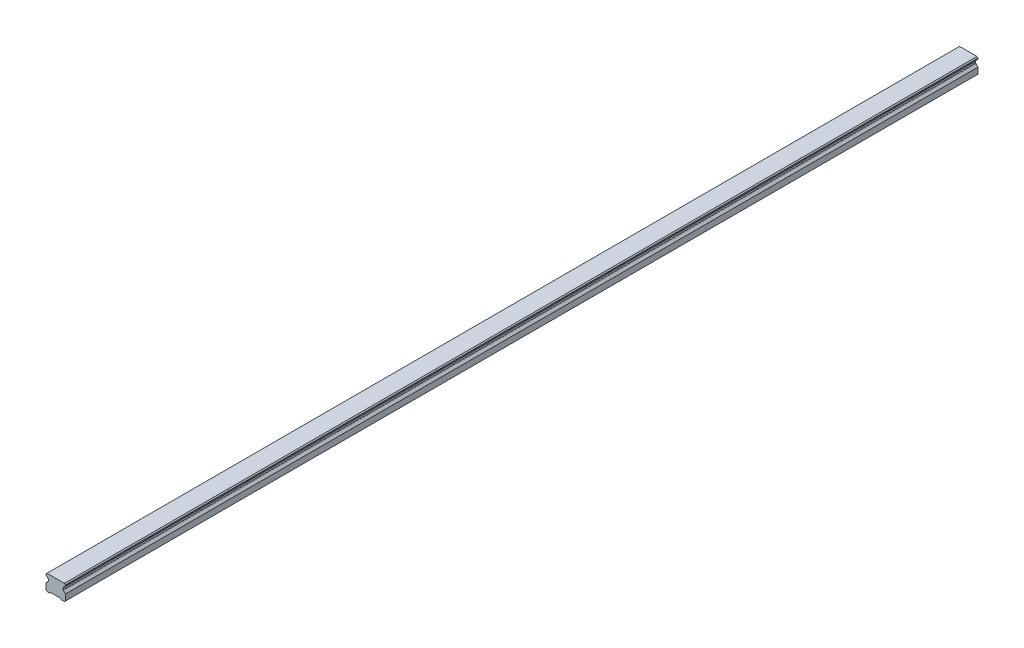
ISO-10303-21;
HEADER;
FILE_DESCRIPTION(('STEP AP214'),'2;1');
FILE_NAME('part.step','',(''),(''),'','','');
FILE_SCHEMA(('AUTOMOTIVE_DESIGN { 1 0 10303 214 1 1 1 1 }'));
ENDSEC;
DATA;
#1=APPLICATION_CONTEXT('core data for automotive mechanical design processes');
#2=APPLICATION_PROTOCOL_DEFINITION('international standard','automotive_design',2000,#1);
#3=PRODUCT_CONTEXT('',#1,'mechanical');
#4=PRODUCT('Part','Part','',(#3));
#5=PRODUCT_RELATED_PRODUCT_CATEGORY('part','',(#4));
#6=PRODUCT_DEFINITION_FORMATION('','',#4);
#7=PRODUCT_DEFINITION_CONTEXT('part definition',#1,'design');
#8=PRODUCT_DEFINITION('design','',#6,#7);
#9=PRODUCT_DEFINITION_SHAPE('','',#8);
#10=(LENGTH_UNIT() NAMED_UNIT(*) SI_UNIT(.MILLI.,.METRE.));
#11=(NAMED_UNIT(*) PLANE_ANGLE_UNIT() SI_UNIT($,.RADIAN.));
#12=(NAMED_UNIT(*) SI_UNIT($,.STERADIAN.) SOLID_ANGLE_UNIT());
#13=UNCERTAINTY_MEASURE_WITH_UNIT(LENGTH_MEASURE(1.E-05),#10,'distance_accuracy_value','');
#14=(GEOMETRIC_REPRESENTATION_CONTEXT(3) GLOBAL_UNCERTAINTY_ASSIGNED_CONTEXT((#13)) GLOBAL_UNIT_ASSIGNED_CONTEXT((#10,
#11,#12)) REPRESENTATION_CONTEXT('',''));
#15=CARTESIAN_POINT('',(0.,0.,0.));
#16=DIRECTION('',(0.,0.,1.));
#17=DIRECTION('',(1.,0.,0.));
#18=AXIS2_PLACEMENT_3D('',#15,#16,#17);
#19=CARTESIAN_POINT('',(0.,10.9999999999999,-450.));
#20=DIRECTION('',(0.,-1.,0.));
#21=DIRECTION('',(0.,0.,-1.));
#22=AXIS2_PLACEMENT_3D('',#19,#20,#21);
#23=PLANE('',#22);
#24=CARTESIAN_POINT('',(0.,10.9999999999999,-450.));
#25=DIRECTION('',(0.,-1.,0.));
#26=DIRECTION('',(0.,0.,-1.));
#27=AXIS2_PLACEMENT_3D('',#24,#25,#26);
#28=CIRCLE('',#27,2.5);
#29=CARTESIAN_POINT('',(0.,10.9999999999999,-452.5));
#30=VERTEX_POINT('',#29);
#31=EDGE_CURVE('E42',#30,#30,#28,.T.);
#32=ORIENTED_EDGE('',*,*,#31,.F.);
#33=EDGE_LOOP('',(#32));
#34=FACE_BOUND('',#33,.T.);
#35=CARTESIAN_POINT('',(0.,10.9999999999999,-450.));
#36=DIRECTION('',(0.,-1.,0.));
#37=DIRECTION('',(0.,0.,-1.));
#38=AXIS2_PLACEMENT_3D('',#35,#36,#37);
#39=CIRCLE('',#38,3.);
#40=CARTESIAN_POINT('',(0.,10.9999999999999,-453.));
#41=VERTEX_POINT('',#40);
#42=EDGE_CURVE('E11',#41,#41,#39,.T.);
#43=ORIENTED_EDGE('',*,*,#42,.T.);
#44=EDGE_LOOP('',(#43));
#45=FACE_BOUND('',#44,.T.);
#46=ADVANCED_FACE('F39',(#34,#45),#23,.T.);
#47=CARTESIAN_POINT('',(0.,10.9999999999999,-450.));
#48=DIRECTION('',(0.,-1.,0.));
#49=DIRECTION('',(0.,0.,-1.));
#50=AXIS2_PLACEMENT_3D('',#47,#48,#49);
#51=CYLINDRICAL_SURFACE('',#50,3.);
#52=ORIENTED_EDGE('',*,*,#42,.F.);
#53=EDGE_LOOP('',(#52));
#54=FACE_BOUND('',#53,.T.);
#55=CARTESIAN_POINT('',(0.,0.999999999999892,-450.));
#56=DIRECTION('',(0.,-1.,0.));
#57=DIRECTION('',(0.,0.,-1.));
#58=AXIS2_PLACEMENT_3D('',#55,#56,#57);
#59=CIRCLE('',#58,3.);
#60=CARTESIAN_POINT('',(0.,0.999999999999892,-453.));
#61=VERTEX_POINT('',#60);
#62=EDGE_CURVE('E48',#61,#61,#59,.T.);
#63=ORIENTED_EDGE('',*,*,#62,.T.);
#64=EDGE_LOOP('',(#63));
#65=FACE_BOUND('',#64,.T.);
#66=ADVANCED_FACE('F747',(#54,#65),#51,.F.);
#67=CARTESIAN_POINT('',(0.,10.9999999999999,-390.));
#68=DIRECTION('',(0.,-1.,0.));
#69=DIRECTION('',(0.,0.,-1.));
#70=AXIS2_PLACEMENT_3D('',#67,#68,#69);
#71=PLANE('',#70);
#72=CARTESIAN_POINT('',(0.,10.9999999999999,-390.));
#73=DIRECTION('',(0.,-1.,0.));
#74=DIRECTION('',(0.,0.,-1.));
#75=AXIS2_PLACEMENT_3D('',#72,#73,#74);
#76=CIRCLE('',#75,2.5);
#77=CARTESIAN_POINT('',(0.,10.9999999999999,-392.5));
#78=VERTEX_POINT('',#77);
#79=EDGE_CURVE('E733',#78,#78,#76,.T.);
#80=ORIENTED_EDGE('',*,*,#79,.F.);
#81=EDGE_LOOP('',(#80));
#82=FACE_BOUND('',#81,.T.);
#83=CARTESIAN_POINT('',(0.,10.9999999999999,-390.));
#84=DIRECTION('',(0.,-1.,0.));
#85=DIRECTION('',(0.,0.,-1.));
#86=AXIS2_PLACEMENT_3D('',#83,#84,#85);
#87=CIRCLE('',#86,3.);
#88=CARTESIAN_POINT('',(0.,10.9999999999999,-393.));
#89=VERTEX_POINT('',#88);
#90=EDGE_CURVE('E680',#89,#89,#87,.T.);
#91=ORIENTED_EDGE('',*,*,#90,.T.);
#92=EDGE_LOOP('',(#91));
#93=FACE_BOUND('',#92,.T.);
#94=ADVANCED_FACE('F752',(#82,#93),#71,.T.);
#95=CARTESIAN_POINT('',(0.,10.9999999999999,-390.));
#96=DIRECTION('',(0.,-1.,0.));
#97=DIRECTION('',(0.,0.,-1.));
#98=AXIS2_PLACEMENT_3D('',#95,#96,#97);
#99=CYLINDRICAL_SURFACE('',#98,3.);
#100=ORIENTED_EDGE('',*,*,#90,.F.);
#101=EDGE_LOOP('',(#100));
#102=FACE_BOUND('',#101,.T.);
#103=CARTESIAN_POINT('',(0.,0.999999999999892,-390.));
#104=DIRECTION('',(0.,-1.,0.));
#105=DIRECTION('',(0.,0.,-1.));
#106=AXIS2_PLACEMENT_3D('',#103,#104,#105);
#107=CIRCLE('',#106,3.);
#108=CARTESIAN_POINT('',(0.,0.999999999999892,-393.));
#109=VERTEX_POINT('',#108);
#110=EDGE_CURVE('E676',#109,#109,#107,.T.);
#111=ORIENTED_EDGE('',*,*,#110,.T.);
#112=EDGE_LOOP('',(#111));
#113=FACE_BOUND('',#112,.T.);
#114=ADVANCED_FACE('F951',(#102,#113),#99,.F.);
#115=CARTESIAN_POINT('',(0.,10.9999999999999,-330.));
#116=DIRECTION('',(0.,-1.,0.));
#117=DIRECTION('',(0.,0.,-1.));
#118=AXIS2_PLACEMENT_3D('',#115,#116,#117);
#119=PLANE('',#118);
#120=CARTESIAN_POINT('',(0.,10.9999999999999,-330.));
#121=DIRECTION('',(0.,-1.,0.));
#122=DIRECTION('',(0.,0.,-1.));
#123=AXIS2_PLACEMENT_3D('',#120,#121,#122);
#124=CIRCLE('',#123,2.5);
#125=CARTESIAN_POINT('',(0.,10.9999999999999,-332.5));
#126=VERTEX_POINT('',#125);
#127=EDGE_CURVE('E730',#126,#126,#124,.T.);
#128=ORIENTED_EDGE('',*,*,#127,.F.);
#129=EDGE_LOOP('',(#128));
#130=FACE_BOUND('',#129,.T.);
#131=CARTESIAN_POINT('',(0.,10.9999999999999,-330.));
#132=DIRECTION('',(0.,-1.,0.));
#133=DIRECTION('',(0.,0.,-1.));
#134=AXIS2_PLACEMENT_3D('',#131,#132,#133);
#135=CIRCLE('',#134,3.);
#136=CARTESIAN_POINT('',(0.,10.9999999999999,-333.));
#137=VERTEX_POINT('',#136);
#138=EDGE_CURVE('E672',#137,#137,#135,.T.);
#139=ORIENTED_EDGE('',*,*,#138,.T.);
#140=EDGE_LOOP('',(#139));
#141=FACE_BOUND('',#140,.T.);
#142=ADVANCED_FACE('F947',(#130,#141),#119,.T.);
#143=CARTESIAN_POINT('',(0.,10.9999999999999,-330.));
#144=DIRECTION('',(0.,-1.,0.));
#145=DIRECTION('',(0.,0.,-1.));
#146=AXIS2_PLACEMENT_3D('',#143,#144,#145);
#147=CYLINDRICAL_SURFACE('',#146,3.);
#148=ORIENTED_EDGE('',*,*,#138,.F.);
#149=EDGE_LOOP('',(#148));
#150=FACE_BOUND('',#149,.T.);
#151=CARTESIAN_POINT('',(0.,0.999999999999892,-330.));
#152=DIRECTION('',(0.,-1.,0.));
#153=DIRECTION('',(0.,0.,-1.));
#154=AXIS2_PLACEMENT_3D('',#151,#152,#153);
#155=CIRCLE('',#154,3.);
#156=CARTESIAN_POINT('',(0.,0.999999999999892,-333.));
#157=VERTEX_POINT('',#156);
#158=EDGE_CURVE('E668',#157,#157,#155,.T.);
#159=ORIENTED_EDGE('',*,*,#158,.T.);
#160=EDGE_LOOP('',(#159));
#161=FACE_BOUND('',#160,.T.);
#162=ADVANCED_FACE('F943',(#150,#161),#147,.F.);
#163=CARTESIAN_POINT('',(0.,10.9999999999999,-270.));
#164=DIRECTION('',(0.,-1.,0.));
#165=DIRECTION('',(0.,0.,-1.));
#166=AXIS2_PLACEMENT_3D('',#163,#164,#165);
#167=PLANE('',#166);
#168=CARTESIAN_POINT('',(0.,10.9999999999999,-270.));
#169=DIRECTION('',(0.,-1.,0.));
#170=DIRECTION('',(0.,0.,-1.));
#171=AXIS2_PLACEMENT_3D('',#168,#169,#170);
#172=CIRCLE('',#171,2.5);
#173=CARTESIAN_POINT('',(0.,10.9999999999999,-272.5));
#174=VERTEX_POINT('',#173);
#175=EDGE_CURVE('E726',#174,#174,#172,.T.);
#176=ORIENTED_EDGE('',*,*,#175,.F.);
#177=EDGE_LOOP('',(#176));
#178=FACE_BOUND('',#177,.T.);
#179=CARTESIAN_POINT('',(0.,10.9999999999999,-270.));
#180=DIRECTION('',(0.,-1.,0.));
#181=DIRECTION('',(0.,0.,-1.));
#182=AXIS2_PLACEMENT_3D('',#179,#180,#181);
#183=CIRCLE('',#182,3.);
#184=CARTESIAN_POINT('',(0.,10.9999999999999,-273.));
#185=VERTEX_POINT('',#184);
#186=EDGE_CURVE('E664',#185,#185,#183,.T.);
#187=ORIENTED_EDGE('',*,*,#186,.T.);
#188=EDGE_LOOP('',(#187));
#189=FACE_BOUND('',#188,.T.);
#190=ADVANCED_FACE('F939',(#178,#189),#167,.T.);
#191=CARTESIAN_POINT('',(0.,10.9999999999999,-270.));
#192=DIRECTION('',(0.,-1.,0.));
#193=DIRECTION('',(0.,0.,-1.));
#194=AXIS2_PLACEMENT_3D('',#191,#192,#193);
#195=CYLINDRICAL_SURFACE('',#194,3.);
#196=ORIENTED_EDGE('',*,*,#186,.F.);
#197=EDGE_LOOP('',(#196));
#198=FACE_BOUND('',#197,.T.);
#199=CARTESIAN_POINT('',(0.,0.999999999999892,-270.));
#200=DIRECTION('',(0.,-1.,0.));
#201=DIRECTION('',(0.,0.,-1.));
#202=AXIS2_PLACEMENT_3D('',#199,#200,#201);
#203=CIRCLE('',#202,3.);
#204=CARTESIAN_POINT('',(0.,0.999999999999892,-273.));
#205=VERTEX_POINT('',#204);
#206=EDGE_CURVE('E660',#205,#205,#203,.T.);
#207=ORIENTED_EDGE('',*,*,#206,.T.);
#208=EDGE_LOOP('',(#207));
#209=FACE_BOUND('',#208,.T.);
#210=ADVANCED_FACE('F935',(#198,#209),#195,.F.);
#211=CARTESIAN_POINT('',(0.,10.9999999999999,-210.));
#212=DIRECTION('',(0.,-1.,0.));
#213=DIRECTION('',(0.,0.,-1.));
#214=AXIS2_PLACEMENT_3D('',#211,#212,#213);
#215=PLANE('',#214);
#216=CARTESIAN_POINT('',(0.,10.9999999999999,-210.));
#217=DIRECTION('',(0.,-1.,0.));
#218=DIRECTION('',(0.,0.,-1.));
#219=AXIS2_PLACEMENT_3D('',#216,#217,#218);
#220=CIRCLE('',#219,2.5);
#221=CARTESIAN_POINT('',(0.,10.9999999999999,-212.5));
#222=VERTEX_POINT('',#221);
#223=EDGE_CURVE('E722',#222,#222,#220,.T.);
#224=ORIENTED_EDGE('',*,*,#223,.F.);
#225=EDGE_LOOP('',(#224));
#226=FACE_BOUND('',#225,.T.);
#227=CARTESIAN_POINT('',(0.,10.9999999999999,-210.));
#228=DIRECTION('',(0.,-1.,0.));
#229=DIRECTION('',(0.,0.,-1.));
#230=AXIS2_PLACEMENT_3D('',#227,#228,#229);
#231=CIRCLE('',#230,3.);
#232=CARTESIAN_POINT('',(0.,10.9999999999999,-213.));
#233=VERTEX_POINT('',#232);
#234=EDGE_CURVE('E656',#233,#233,#231,.T.);
#235=ORIENTED_EDGE('',*,*,#234,.T.);
#236=EDGE_LOOP('',(#235));
#237=FACE_BOUND('',#236,.T.);
#238=ADVANCED_FACE('F931',(#226,#237),#215,.T.);
#239=CARTESIAN_POINT('',(0.,10.9999999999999,-210.));
#240=DIRECTION('',(0.,-1.,0.));
#241=DIRECTION('',(0.,0.,-1.));
#242=AXIS2_PLACEMENT_3D('',#239,#240,#241);
#243=CYLINDRICAL_SURFACE('',#242,3.);
#244=ORIENTED_EDGE('',*,*,#234,.F.);
#245=EDGE_LOOP('',(#244));
#246=FACE_BOUND('',#245,.T.);
#247=CARTESIAN_POINT('',(0.,0.999999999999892,-210.));
#248=DIRECTION('',(0.,-1.,0.));
#249=DIRECTION('',(0.,0.,-1.));
#250=AXIS2_PLACEMENT_3D('',#247,#248,#249);
#251=CIRCLE('',#250,3.);
#252=CARTESIAN_POINT('',(0.,0.999999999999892,-213.));
#253=VERTEX_POINT('',#252);
#254=EDGE_CURVE('E652',#253,#253,#251,.T.);
#255=ORIENTED_EDGE('',*,*,#254,.T.);
#256=EDGE_LOOP('',(#255));
#257=FACE_BOUND('',#256,.T.);
#258=ADVANCED_FACE('F927',(#246,#257),#243,.F.);
#259=CARTESIAN_POINT('',(0.,10.9999999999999,-150.));
#260=DIRECTION('',(0.,-1.,0.));
#261=DIRECTION('',(0.,0.,-1.));
#262=AXIS2_PLACEMENT_3D('',#259,#260,#261);
#263=PLANE('',#262);
#264=CARTESIAN_POINT('',(0.,10.9999999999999,-150.));
#265=DIRECTION('',(0.,-1.,0.));
#266=DIRECTION('',(0.,0.,-1.));
#267=AXIS2_PLACEMENT_3D('',#264,#265,#266);
#268=CIRCLE('',#267,2.5);
#269=CARTESIAN_POINT('',(0.,10.9999999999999,-152.5));
#270=VERTEX_POINT('',#269);
#271=EDGE_CURVE('E718',#270,#270,#268,.T.);
#272=ORIENTED_EDGE('',*,*,#271,.F.);
#273=EDGE_LOOP('',(#272));
#274=FACE_BOUND('',#273,.T.);
#275=CARTESIAN_POINT('',(0.,10.9999999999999,-150.));
#276=DIRECTION('',(0.,-1.,0.));
#277=DIRECTION('',(0.,0.,-1.));
#278=AXIS2_PLACEMENT_3D('',#275,#276,#277);
#279=CIRCLE('',#278,3.);
#280=CARTESIAN_POINT('',(0.,10.9999999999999,-153.));
#281=VERTEX_POINT('',#280);
#282=EDGE_CURVE('E648',#281,#281,#279,.T.);
#283=ORIENTED_EDGE('',*,*,#282,.T.);
#284=EDGE_LOOP('',(#283));
#285=FACE_BOUND('',#284,.T.);
#286=ADVANCED_FACE('F923',(#274,#285),#263,.T.);
#287=CARTESIAN_POINT('',(0.,10.9999999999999,-150.));
#288=DIRECTION('',(0.,-1.,0.));
#289=DIRECTION('',(0.,0.,-1.));
#290=AXIS2_PLACEMENT_3D('',#287,#288,#289);
#291=CYLINDRICAL_SURFACE('',#290,3.);
#292=ORIENTED_EDGE('',*,*,#282,.F.);
#293=EDGE_LOOP('',(#292));
#294=FACE_BOUND('',#293,.T.);
#295=CARTESIAN_POINT('',(0.,0.999999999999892,-150.));
#296=DIRECTION('',(0.,-1.,0.));
#297=DIRECTION('',(0.,0.,-1.));
#298=AXIS2_PLACEMENT_3D('',#295,#296,#297);
#299=CIRCLE('',#298,3.);
#300=CARTESIAN_POINT('',(0.,0.999999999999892,-153.));
#301=VERTEX_POINT('',#300);
#302=EDGE_CURVE('E644',#301,#301,#299,.T.);
#303=ORIENTED_EDGE('',*,*,#302,.T.);
#304=EDGE_LOOP('',(#303));
#305=FACE_BOUND('',#304,.T.);
#306=ADVANCED_FACE('F919',(#294,#305),#291,.F.);
#307=CARTESIAN_POINT('',(0.,10.9999999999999,-90.0000000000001));
#308=DIRECTION('',(0.,-1.,0.));
#309=DIRECTION('',(0.,0.,-1.));
#310=AXIS2_PLACEMENT_3D('',#307,#308,#309);
#311=PLANE('',#310);
#312=CARTESIAN_POINT('',(0.,10.9999999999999,-90.0000000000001));
#313=DIRECTION('',(0.,-1.,0.));
#314=DIRECTION('',(0.,0.,-1.));
#315=AXIS2_PLACEMENT_3D('',#312,#313,#314);
#316=CIRCLE('',#315,2.5);
#317=CARTESIAN_POINT('',(0.,10.9999999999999,-92.5000000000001));
#318=VERTEX_POINT('',#317);
#319=EDGE_CURVE('E714',#318,#318,#316,.T.);
#320=ORIENTED_EDGE('',*,*,#319,.F.);
#321=EDGE_LOOP('',(#320));
#322=FACE_BOUND('',#321,.T.);
#323=CARTESIAN_POINT('',(0.,10.9999999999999,-90.0000000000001));
#324=DIRECTION('',(0.,-1.,0.));
#325=DIRECTION('',(0.,0.,-1.));
#326=AXIS2_PLACEMENT_3D('',#323,#324,#325);
#327=CIRCLE('',#326,3.);
#328=CARTESIAN_POINT('',(0.,10.9999999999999,-93.0000000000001));
#329=VERTEX_POINT('',#328);
#330=EDGE_CURVE('E640',#329,#329,#327,.T.);
#331=ORIENTED_EDGE('',*,*,#330,.T.);
#332=EDGE_LOOP('',(#331));
#333=FACE_BOUND('',#332,.T.);
#334=ADVANCED_FACE('F915',(#322,#333),#311,.T.);
#335=CARTESIAN_POINT('',(0.,10.9999999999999,-90.0000000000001));
#336=DIRECTION('',(0.,-1.,0.));
#337=DIRECTION('',(0.,0.,-1.));
#338=AXIS2_PLACEMENT_3D('',#335,#336,#337);
#339=CYLINDRICAL_SURFACE('',#338,3.);
#340=ORIENTED_EDGE('',*,*,#330,.F.);
#341=EDGE_LOOP('',(#340));
#342=FACE_BOUND('',#341,.T.);
#343=CARTESIAN_POINT('',(0.,0.999999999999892,-90.0000000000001));
#344=DIRECTION('',(0.,-1.,0.));
#345=DIRECTION('',(0.,0.,-1.));
#346=AXIS2_PLACEMENT_3D('',#343,#344,#345);
#347=CIRCLE('',#346,3.);
#348=CARTESIAN_POINT('',(0.,0.999999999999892,-93.0000000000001));
#349=VERTEX_POINT('',#348);
#350=EDGE_CURVE('E636',#349,#349,#347,.T.);
#351=ORIENTED_EDGE('',*,*,#350,.T.);
#352=EDGE_LOOP('',(#351));
#353=FACE_BOUND('',#352,.T.);
#354=ADVANCED_FACE('F911',(#342,#353),#339,.F.);
#355=CARTESIAN_POINT('',(0.,10.9999999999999,-30.));
#356=DIRECTION('',(0.,-1.,0.));
#357=DIRECTION('',(0.,0.,-1.));
#358=AXIS2_PLACEMENT_3D('',#355,#356,#357);
#359=PLANE('',#358);
#360=CARTESIAN_POINT('',(0.,10.9999999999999,-30.));
#361=DIRECTION('',(0.,-1.,0.));
#362=DIRECTION('',(0.,0.,-1.));
#363=AXIS2_PLACEMENT_3D('',#360,#361,#362);
#364=CIRCLE('',#363,2.5);
#365=CARTESIAN_POINT('',(0.,10.9999999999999,-32.5));
#366=VERTEX_POINT('',#365);
#367=EDGE_CURVE('E710',#366,#366,#364,.T.);
#368=ORIENTED_EDGE('',*,*,#367,.F.);
#369=EDGE_LOOP('',(#368));
#370=FACE_BOUND('',#369,.T.);
#371=CARTESIAN_POINT('',(0.,10.9999999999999,-30.));
#372=DIRECTION('',(0.,-1.,0.));
#373=DIRECTION('',(0.,0.,-1.));
#374=AXIS2_PLACEMENT_3D('',#371,#372,#373);
#375=CIRCLE('',#374,3.);
#376=CARTESIAN_POINT('',(0.,10.9999999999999,-33.));
#377=VERTEX_POINT('',#376);
#378=EDGE_CURVE('E632',#377,#377,#375,.T.);
#379=ORIENTED_EDGE('',*,*,#378,.T.);
#380=EDGE_LOOP('',(#379));
#381=FACE_BOUND('',#380,.T.);
#382=ADVANCED_FACE('F907',(#370,#381),#359,.T.);
#383=CARTESIAN_POINT('',(0.,10.9999999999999,-30.));
#384=DIRECTION('',(0.,-1.,0.));
#385=DIRECTION('',(0.,0.,-1.));
#386=AXIS2_PLACEMENT_3D('',#383,#384,#385);
#387=CYLINDRICAL_SURFACE('',#386,3.);
#388=ORIENTED_EDGE('',*,*,#378,.F.);
#389=EDGE_LOOP('',(#388));
#390=FACE_BOUND('',#389,.T.);
#391=CARTESIAN_POINT('',(0.,0.999999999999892,-30.));
#392=DIRECTION('',(0.,-1.,0.));
#393=DIRECTION('',(0.,0.,-1.));
#394=AXIS2_PLACEMENT_3D('',#391,#392,#393);
#395=CIRCLE('',#394,3.);
#396=CARTESIAN_POINT('',(0.,0.999999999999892,-33.));
#397=VERTEX_POINT('',#396);
#398=EDGE_CURVE('E628',#397,#397,#395,.T.);
#399=ORIENTED_EDGE('',*,*,#398,.T.);
#400=EDGE_LOOP('',(#399));
#401=FACE_BOUND('',#400,.T.);
#402=ADVANCED_FACE('F903',(#390,#401),#387,.F.);
#403=CARTESIAN_POINT('',(0.,10.9999999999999,30.));
#404=DIRECTION('',(0.,-1.,0.));
#405=DIRECTION('',(0.,0.,-1.));
#406=AXIS2_PLACEMENT_3D('',#403,#404,#405);
#407=PLANE('',#406);
#408=CARTESIAN_POINT('',(0.,10.9999999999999,30.));
#409=DIRECTION('',(0.,-1.,0.));
#410=DIRECTION('',(0.,0.,-1.));
#411=AXIS2_PLACEMENT_3D('',#408,#409,#410);
#412=CIRCLE('',#411,2.5);
#413=CARTESIAN_POINT('',(0.,10.9999999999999,27.5));
#414=VERTEX_POINT('',#413);
#415=EDGE_CURVE('E706',#414,#414,#412,.T.);
#416=ORIENTED_EDGE('',*,*,#415,.F.);
#417=EDGE_LOOP('',(#416));
#418=FACE_BOUND('',#417,.T.);
#419=CARTESIAN_POINT('',(0.,10.9999999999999,30.));
#420=DIRECTION('',(0.,-1.,0.));
#421=DIRECTION('',(0.,0.,-1.));
#422=AXIS2_PLACEMENT_3D('',#419,#420,#421);
#423=CIRCLE('',#422,3.);
#424=CARTESIAN_POINT('',(0.,10.9999999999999,27.));
#425=VERTEX_POINT('',#424);
#426=EDGE_CURVE('E624',#425,#425,#423,.T.);
#427=ORIENTED_EDGE('',*,*,#426,.T.);
#428=EDGE_LOOP('',(#427));
#429=FACE_BOUND('',#428,.T.);
#430=ADVANCED_FACE('F899',(#418,#429),#407,.T.);
#431=CARTESIAN_POINT('',(0.,10.9999999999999,30.));
#432=DIRECTION('',(0.,-1.,0.));
#433=DIRECTION('',(0.,0.,-1.));
#434=AXIS2_PLACEMENT_3D('',#431,#432,#433);
#435=CYLINDRICAL_SURFACE('',#434,3.);
#436=ORIENTED_EDGE('',*,*,#426,.F.);
#437=EDGE_LOOP('',(#436));
#438=FACE_BOUND('',#437,.T.);
#439=CARTESIAN_POINT('',(0.,0.999999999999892,30.));
#440=DIRECTION('',(0.,-1.,0.));
#441=DIRECTION('',(0.,0.,-1.));
#442=AXIS2_PLACEMENT_3D('',#439,#440,#441);
#443=CIRCLE('',#442,3.);
#444=CARTESIAN_POINT('',(0.,0.999999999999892,27.));
#445=VERTEX_POINT('',#444);
#446=EDGE_CURVE('E620',#445,#445,#443,.T.);
#447=ORIENTED_EDGE('',*,*,#446,.T.);
#448=EDGE_LOOP('',(#447));
#449=FACE_BOUND('',#448,.T.);
#450=ADVANCED_FACE('F895',(#438,#449),#435,.F.);
#451=CARTESIAN_POINT('',(0.,10.9999999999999,90.));
#452=DIRECTION('',(0.,-1.,0.));
#453=DIRECTION('',(0.,0.,-1.));
#454=AXIS2_PLACEMENT_3D('',#451,#452,#453);
#455=PLANE('',#454);
#456=CARTESIAN_POINT('',(0.,10.9999999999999,90.));
#457=DIRECTION('',(0.,-1.,0.));
#458=DIRECTION('',(0.,0.,-1.));
#459=AXIS2_PLACEMENT_3D('',#456,#457,#458);
#460=CIRCLE('',#459,2.5);
#461=CARTESIAN_POINT('',(0.,10.9999999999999,87.5));
#462=VERTEX_POINT('',#461);
#463=EDGE_CURVE('E702',#462,#462,#460,.T.);
#464=ORIENTED_EDGE('',*,*,#463,.F.);
#465=EDGE_LOOP('',(#464));
#466=FACE_BOUND('',#465,.T.);
#467=CARTESIAN_POINT('',(0.,10.9999999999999,90.));
#468=DIRECTION('',(0.,-1.,0.));
#469=DIRECTION('',(0.,0.,-1.));
#470=AXIS2_PLACEMENT_3D('',#467,#468,#469);
#471=CIRCLE('',#470,3.);
#472=CARTESIAN_POINT('',(0.,10.9999999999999,87.));
#473=VERTEX_POINT('',#472);
#474=EDGE_CURVE('E616',#473,#473,#471,.T.);
#475=ORIENTED_EDGE('',*,*,#474,.T.);
#476=EDGE_LOOP('',(#475));
#477=FACE_BOUND('',#476,.T.);
#478=ADVANCED_FACE('F891',(#466,#477),#455,.T.);
#479=CARTESIAN_POINT('',(0.,10.9999999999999,90.));
#480=DIRECTION('',(0.,-1.,0.));
#481=DIRECTION('',(0.,0.,-1.));
#482=AXIS2_PLACEMENT_3D('',#479,#480,#481);
#483=CYLINDRICAL_SURFACE('',#482,3.);
#484=ORIENTED_EDGE('',*,*,#474,.F.);
#485=EDGE_LOOP('',(#484));
#486=FACE_BOUND('',#485,.T.);
#487=CARTESIAN_POINT('',(0.,0.999999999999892,90.));
#488=DIRECTION('',(0.,-1.,0.));
#489=DIRECTION('',(0.,0.,-1.));
#490=AXIS2_PLACEMENT_3D('',#487,#488,#489);
#491=CIRCLE('',#490,3.);
#492=CARTESIAN_POINT('',(0.,0.999999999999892,87.));
#493=VERTEX_POINT('',#492);
#494=EDGE_CURVE('E612',#493,#493,#491,.T.);
#495=ORIENTED_EDGE('',*,*,#494,.T.);
#496=EDGE_LOOP('',(#495));
#497=FACE_BOUND('',#496,.T.);
#498=ADVANCED_FACE('F887',(#486,#497),#483,.F.);
#499=CARTESIAN_POINT('',(0.,10.9999999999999,150.));
#500=DIRECTION('',(0.,-1.,0.));
#501=DIRECTION('',(0.,0.,-1.));
#502=AXIS2_PLACEMENT_3D('',#499,#500,#501);
#503=PLANE('',#502);
#504=CARTESIAN_POINT('',(0.,10.9999999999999,150.));
#505=DIRECTION('',(0.,-1.,0.));
#506=DIRECTION('',(0.,0.,-1.));
#507=AXIS2_PLACEMENT_3D('',#504,#505,#506);
#508=CIRCLE('',#507,2.5);
#509=CARTESIAN_POINT('',(0.,10.9999999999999,147.5));
#510=VERTEX_POINT('',#509);
#511=EDGE_CURVE('E698',#510,#510,#508,.T.);
#512=ORIENTED_EDGE('',*,*,#511,.F.);
#513=EDGE_LOOP('',(#512));
#514=FACE_BOUND('',#513,.T.);
#515=CARTESIAN_POINT('',(0.,10.9999999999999,150.));
#516=DIRECTION('',(0.,-1.,0.));
#517=DIRECTION('',(0.,0.,-1.));
#518=AXIS2_PLACEMENT_3D('',#515,#516,#517);
#519=CIRCLE('',#518,3.);
#520=CARTESIAN_POINT('',(0.,10.9999999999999,147.));
#521=VERTEX_POINT('',#520);
#522=EDGE_CURVE('E608',#521,#521,#519,.T.);
#523=ORIENTED_EDGE('',*,*,#522,.T.);
#524=EDGE_LOOP('',(#523));
#525=FACE_BOUND('',#524,.T.);
#526=ADVANCED_FACE('F883',(#514,#525),#503,.T.);
#527=CARTESIAN_POINT('',(0.,10.9999999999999,150.));
#528=DIRECTION('',(0.,-1.,0.));
#529=DIRECTION('',(0.,0.,-1.));
#530=AXIS2_PLACEMENT_3D('',#527,#528,#529);
#531=CYLINDRICAL_SURFACE('',#530,3.);
#532=ORIENTED_EDGE('',*,*,#522,.F.);
#533=EDGE_LOOP('',(#532));
#534=FACE_BOUND('',#533,.T.);
#535=CARTESIAN_POINT('',(0.,0.999999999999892,150.));
#536=DIRECTION('',(0.,-1.,0.));
#537=DIRECTION('',(0.,0.,-1.));
#538=AXIS2_PLACEMENT_3D('',#535,#536,#537);
#539=CIRCLE('',#538,3.);
#540=CARTESIAN_POINT('',(0.,0.999999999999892,147.));
#541=VERTEX_POINT('',#540);
#542=EDGE_CURVE('E604',#541,#541,#539,.T.);
#543=ORIENTED_EDGE('',*,*,#542,.T.);
#544=EDGE_LOOP('',(#543));
#545=FACE_BOUND('',#544,.T.);
#546=ADVANCED_FACE('F879',(#534,#545),#531,.F.);
#547=CARTESIAN_POINT('',(0.,10.9999999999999,210.));
#548=DIRECTION('',(0.,-1.,0.));
#549=DIRECTION('',(0.,0.,-1.));
#550=AXIS2_PLACEMENT_3D('',#547,#548,#549);
#551=PLANE('',#550);
#552=CARTESIAN_POINT('',(0.,10.9999999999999,210.));
#553=DIRECTION('',(0.,-1.,0.));
#554=DIRECTION('',(0.,0.,-1.));
#555=AXIS2_PLACEMENT_3D('',#552,#553,#554);
#556=CIRCLE('',#555,2.5);
#557=CARTESIAN_POINT('',(0.,10.9999999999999,207.5));
#558=VERTEX_POINT('',#557);
#559=EDGE_CURVE('E694',#558,#558,#556,.T.);
#560=ORIENTED_EDGE('',*,*,#559,.F.);
#561=EDGE_LOOP('',(#560));
#562=FACE_BOUND('',#561,.T.);
#563=CARTESIAN_POINT('',(0.,10.9999999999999,210.));
#564=DIRECTION('',(0.,-1.,0.));
#565=DIRECTION('',(0.,0.,-1.));
#566=AXIS2_PLACEMENT_3D('',#563,#564,#565);
#567=CIRCLE('',#566,3.);
#568=CARTESIAN_POINT('',(0.,10.9999999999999,207.));
#569=VERTEX_POINT('',#568);
#570=EDGE_CURVE('E600',#569,#569,#567,.T.);
#571=ORIENTED_EDGE('',*,*,#570,.T.);
#572=EDGE_LOOP('',(#571));
#573=FACE_BOUND('',#572,.T.);
#574=ADVANCED_FACE('F875',(#562,#573),#551,.T.);
#575=CARTESIAN_POINT('',(0.,10.9999999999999,210.));
#576=DIRECTION('',(0.,-1.,0.));
#577=DIRECTION('',(0.,0.,-1.));
#578=AXIS2_PLACEMENT_3D('',#575,#576,#577);
#579=CYLINDRICAL_SURFACE('',#578,3.);
#580=ORIENTED_EDGE('',*,*,#570,.F.);
#581=EDGE_LOOP('',(#580));
#582=FACE_BOUND('',#581,.T.);
#583=CARTESIAN_POINT('',(0.,0.999999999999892,210.));
#584=DIRECTION('',(0.,-1.,0.));
#585=DIRECTION('',(0.,0.,-1.));
#586=AXIS2_PLACEMENT_3D('',#583,#584,#585);
#587=CIRCLE('',#586,3.);
#588=CARTESIAN_POINT('',(0.,0.999999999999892,207.));
#589=VERTEX_POINT('',#588);
#590=EDGE_CURVE('E596',#589,#589,#587,.T.);
#591=ORIENTED_EDGE('',*,*,#590,.T.);
#592=EDGE_LOOP('',(#591));
#593=FACE_BOUND('',#592,.T.);
#594=ADVANCED_FACE('F871',(#582,#593),#579,.F.);
#595=CARTESIAN_POINT('',(0.,10.9999999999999,270.));
#596=DIRECTION('',(0.,-1.,0.));
#597=DIRECTION('',(0.,0.,-1.));
#598=AXIS2_PLACEMENT_3D('',#595,#596,#597);
#599=PLANE('',#598);
#600=CARTESIAN_POINT('',(0.,10.9999999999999,270.));
#601=DIRECTION('',(0.,-1.,0.));
#602=DIRECTION('',(0.,0.,-1.));
#603=AXIS2_PLACEMENT_3D('',#600,#601,#602);
#604=CIRCLE('',#603,2.5);
#605=CARTESIAN_POINT('',(0.,10.9999999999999,267.5));
#606=VERTEX_POINT('',#605);
#607=EDGE_CURVE('E690',#606,#606,#604,.T.);
#608=ORIENTED_EDGE('',*,*,#607,.F.);
#609=EDGE_LOOP('',(#608));
#610=FACE_BOUND('',#609,.T.);
#611=CARTESIAN_POINT('',(0.,10.9999999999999,270.));
#612=DIRECTION('',(0.,-1.,0.));
#613=DIRECTION('',(0.,0.,-1.));
#614=AXIS2_PLACEMENT_3D('',#611,#612,#613);
#615=CIRCLE('',#614,3.);
#616=CARTESIAN_POINT('',(0.,10.9999999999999,267.));
#617=VERTEX_POINT('',#616);
#618=EDGE_CURVE('E592',#617,#617,#615,.T.);
#619=ORIENTED_EDGE('',*,*,#618,.T.);
#620=EDGE_LOOP('',(#619));
#621=FACE_BOUND('',#620,.T.);
#622=ADVANCED_FACE('F867',(#610,#621),#599,.T.);
#623=CARTESIAN_POINT('',(0.,10.9999999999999,270.));
#624=DIRECTION('',(0.,-1.,0.));
#625=DIRECTION('',(0.,0.,-1.));
#626=AXIS2_PLACEMENT_3D('',#623,#624,#625);
#627=CYLINDRICAL_SURFACE('',#626,3.);
#628=ORIENTED_EDGE('',*,*,#618,.F.);
#629=EDGE_LOOP('',(#628));
#630=FACE_BOUND('',#629,.T.);
#631=CARTESIAN_POINT('',(0.,0.999999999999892,270.));
#632=DIRECTION('',(0.,-1.,0.));
#633=DIRECTION('',(0.,0.,-1.));
#634=AXIS2_PLACEMENT_3D('',#631,#632,#633);
#635=CIRCLE('',#634,3.);
#636=CARTESIAN_POINT('',(0.,0.999999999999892,267.));
#637=VERTEX_POINT('',#636);
#638=EDGE_CURVE('E588',#637,#637,#635,.T.);
#639=ORIENTED_EDGE('',*,*,#638,.T.);
#640=EDGE_LOOP('',(#639));
#641=FACE_BOUND('',#640,.T.);
#642=ADVANCED_FACE('F863',(#630,#641),#627,.F.);
#643=CARTESIAN_POINT('',(0.,10.9999999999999,330.));
#644=DIRECTION('',(0.,-1.,0.));
#645=DIRECTION('',(0.,0.,-1.));
#646=AXIS2_PLACEMENT_3D('',#643,#644,#645);
#647=PLANE('',#646);
#648=CARTESIAN_POINT('',(0.,10.9999999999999,330.));
#649=DIRECTION('',(0.,-1.,0.));
#650=DIRECTION('',(0.,0.,-1.));
#651=AXIS2_PLACEMENT_3D('',#648,#649,#650);
#652=CIRCLE('',#651,2.5);
#653=CARTESIAN_POINT('',(0.,10.9999999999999,327.5));
#654=VERTEX_POINT('',#653);
#655=EDGE_CURVE('E266',#654,#654,#652,.T.);
#656=ORIENTED_EDGE('',*,*,#655,.F.);
#657=EDGE_LOOP('',(#656));
#658=FACE_BOUND('',#657,.T.);
#659=CARTESIAN_POINT('',(0.,10.9999999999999,330.));
#660=DIRECTION('',(0.,-1.,0.));
#661=DIRECTION('',(0.,0.,-1.));
#662=AXIS2_PLACEMENT_3D('',#659,#660,#661);
#663=CIRCLE('',#662,3.);
#664=CARTESIAN_POINT('',(0.,10.9999999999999,327.));
#665=VERTEX_POINT('',#664);
#666=EDGE_CURVE('E584',#665,#665,#663,.T.);
#667=ORIENTED_EDGE('',*,*,#666,.T.);
#668=EDGE_LOOP('',(#667));
#669=FACE_BOUND('',#668,.T.);
#670=ADVANCED_FACE('F859',(#658,#669),#647,.T.);
#671=CARTESIAN_POINT('',(0.,10.9999999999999,330.));
#672=DIRECTION('',(0.,-1.,0.));
#673=DIRECTION('',(0.,0.,-1.));
#674=AXIS2_PLACEMENT_3D('',#671,#672,#673);
#675=CYLINDRICAL_SURFACE('',#674,3.);
#676=ORIENTED_EDGE('',*,*,#666,.F.);
#677=EDGE_LOOP('',(#676));
#678=FACE_BOUND('',#677,.T.);
#679=CARTESIAN_POINT('',(0.,0.999999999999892,330.));
#680=DIRECTION('',(0.,-1.,0.));
#681=DIRECTION('',(0.,0.,-1.));
#682=AXIS2_PLACEMENT_3D('',#679,#680,#681);
#683=CIRCLE('',#682,3.);
#684=CARTESIAN_POINT('',(0.,0.999999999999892,327.));
#685=VERTEX_POINT('',#684);
#686=EDGE_CURVE('E580',#685,#685,#683,.T.);
#687=ORIENTED_EDGE('',*,*,#686,.T.);
#688=EDGE_LOOP('',(#687));
#689=FACE_BOUND('',#688,.T.);
#690=ADVANCED_FACE('F856',(#678,#689),#675,.F.);
#691=CARTESIAN_POINT('',(10.,0.,470.));
#692=DIRECTION('',(0.,1.,0.));
#693=DIRECTION('',(-1.,0.,0.));
#694=AXIS2_PLACEMENT_3D('',#691,#692,#693);
#695=PLANE('',#694);
#696=DIRECTION('',(1.,0.,0.));
#697=VECTOR('',#696,1.);
#698=CARTESIAN_POINT('',(10.,0.,-470.));
#699=LINE('',#698,#697);
#700=CARTESIAN_POINT('',(-8.99999999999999,0.,-470.));
#701=VERTEX_POINT('',#700);
#702=CARTESIAN_POINT('',(-5.99999999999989,0.,-470.));
#703=VERTEX_POINT('',#702);
#704=EDGE_CURVE('E464',#701,#703,#699,.T.);
#705=ORIENTED_EDGE('',*,*,#704,.T.);
#706=DIRECTION('',(0.,0.,1.));
#707=VECTOR('',#706,1.);
#708=CARTESIAN_POINT('',(-5.99999999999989,0.,-470.));
#709=LINE('',#708,#707);
#710=CARTESIAN_POINT('',(-5.99999999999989,0.,470.));
#711=VERTEX_POINT('',#710);
#712=EDGE_CURVE('E369',#703,#711,#709,.T.);
#713=ORIENTED_EDGE('',*,*,#712,.T.);
#714=DIRECTION('',(1.,0.,0.));
#715=VECTOR('',#714,1.);
#716=CARTESIAN_POINT('',(10.,0.,470.));
#717=LINE('',#716,#715);
#718=CARTESIAN_POINT('',(-8.99999999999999,0.,470.));
#719=VERTEX_POINT('',#718);
#720=EDGE_CURVE('E445',#719,#711,#717,.T.);
#721=ORIENTED_EDGE('',*,*,#720,.F.);
#722=DIRECTION('',(0.,0.,-1.));
#723=VECTOR('',#722,1.);
#724=CARTESIAN_POINT('',(-8.99999999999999,0.,470.));
#725=LINE('',#724,#723);
#726=EDGE_CURVE('E515',#719,#701,#725,.T.);
#727=ORIENTED_EDGE('',*,*,#726,.T.);
#728=EDGE_LOOP('',(#705,#713,#721,#727));
#729=FACE_BOUND('',#728,.T.);
#730=ADVANCED_FACE('F821',(#729),#695,.F.);
#731=CARTESIAN_POINT('',(-10.,16.3,470.));
#732=DIRECTION('',(1.,0.,0.));
#733=DIRECTION('',(0.,1.,0.));
#734=AXIS2_PLACEMENT_3D('',#731,#732,#733);
#735=PLANE('',#734);
#736=DIRECTION('',(0.,-1.,0.));
#737=VECTOR('',#736,1.);
#738=CARTESIAN_POINT('',(-10.,16.3,470.));
#739=LINE('',#738,#737);
#740=CARTESIAN_POINT('',(-10.,15.3,470.));
#741=VERTEX_POINT('',#740);
#742=CARTESIAN_POINT('',(-10.,14.3,470.));
#743=VERTEX_POINT('',#742);
#744=EDGE_CURVE('E439',#741,#743,#739,.T.);
#745=ORIENTED_EDGE('',*,*,#744,.F.);
#746=DIRECTION('',(0.,0.,-1.));
#747=VECTOR('',#746,1.);
#748=CARTESIAN_POINT('',(-10.,15.3,470.));
#749=LINE('',#748,#747);
#750=CARTESIAN_POINT('',(-10.,15.3,-470.));
#751=VERTEX_POINT('',#750);
#752=EDGE_CURVE('E458',#741,#751,#749,.T.);
#753=ORIENTED_EDGE('',*,*,#752,.T.);
#754=DIRECTION('',(0.,-1.,0.));
#755=VECTOR('',#754,1.);
#756=CARTESIAN_POINT('',(-10.,16.3,-470.));
#757=LINE('',#756,#755);
#758=CARTESIAN_POINT('',(-10.,14.3,-470.));
#759=VERTEX_POINT('',#758);
#760=EDGE_CURVE('E459',#751,#759,#757,.T.);
#761=ORIENTED_EDGE('',*,*,#760,.T.);
#762=DIRECTION('',(0.,0.,1.));
#763=VECTOR('',#762,1.);
#764=CARTESIAN_POINT('',(-10.,14.3,-470.));
#765=LINE('',#764,#763);
#766=EDGE_CURVE('E393',#759,#743,#765,.T.);
#767=ORIENTED_EDGE('',*,*,#766,.T.);
#768=EDGE_LOOP('',(#745,#753,#761,#767));
#769=FACE_BOUND('',#768,.T.);
#770=ADVANCED_FACE('F825',(#769),#735,.F.);
#771=CARTESIAN_POINT('',(10.,16.3,470.));
#772=DIRECTION('',(-1.,0.,0.));
#773=DIRECTION('',(0.,-1.,0.));
#774=AXIS2_PLACEMENT_3D('',#771,#772,#773);
#775=PLANE('',#774);
#776=DIRECTION('',(0.,1.,0.));
#777=VECTOR('',#776,1.);
#778=CARTESIAN_POINT('',(10.,16.3,470.));
#779=LINE('',#778,#777);
#780=CARTESIAN_POINT('',(10.,1.,470.));
#781=VERTEX_POINT('',#780);
#782=CARTESIAN_POINT('',(10.,7.3,470.));
#783=VERTEX_POINT('',#782);
#784=EDGE_CURVE('E450',#781,#783,#779,.T.);
#785=ORIENTED_EDGE('',*,*,#784,.F.);
#786=DIRECTION('',(0.,0.,-1.));
#787=VECTOR('',#786,1.);
#788=CARTESIAN_POINT('',(10.,1.,470.));
#789=LINE('',#788,#787);
#790=CARTESIAN_POINT('',(10.,1.,-470.));
#791=VERTEX_POINT('',#790);
#792=EDGE_CURVE('E522',#781,#791,#789,.T.);
#793=ORIENTED_EDGE('',*,*,#792,.T.);
#794=DIRECTION('',(0.,1.,0.));
#795=VECTOR('',#794,1.);
#796=CARTESIAN_POINT('',(10.,16.3,-470.));
#797=LINE('',#796,#795);
#798=CARTESIAN_POINT('',(10.,7.3,-470.));
#799=VERTEX_POINT('',#798);
#800=EDGE_CURVE('E469',#791,#799,#797,.T.);
#801=ORIENTED_EDGE('',*,*,#800,.T.);
#802=DIRECTION('',(0.,0.,1.));
#803=VECTOR('',#802,1.);
#804=CARTESIAN_POINT('',(10.,7.3,-470.));
#805=LINE('',#804,#803);
#806=EDGE_CURVE('E424',#799,#783,#805,.T.);
#807=ORIENTED_EDGE('',*,*,#806,.T.);
#808=EDGE_LOOP('',(#785,#793,#801,#807));
#809=FACE_BOUND('',#808,.T.);
#810=ADVANCED_FACE('F816',(#809),#775,.F.);
#811=CARTESIAN_POINT('',(-10.,7.3,-470.));
#812=VERTEX_POINT('',#811);
#813=CARTESIAN_POINT('',(-10.,0.999999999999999,-470.));
#814=VERTEX_POINT('',#813);
#815=EDGE_CURVE('E408',#812,#814,#757,.T.);
#816=ORIENTED_EDGE('',*,*,#815,.T.);
#817=DIRECTION('',(0.,0.,1.));
#818=VECTOR('',#817,1.);
#819=CARTESIAN_POINT('',(-10.,0.999999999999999,470.));
#820=LINE('',#819,#818);
#821=CARTESIAN_POINT('',(-10.,0.999999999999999,470.));
#822=VERTEX_POINT('',#821);
#823=EDGE_CURVE('E519',#814,#822,#820,.T.);
#824=ORIENTED_EDGE('',*,*,#823,.T.);
#825=CARTESIAN_POINT('',(-10.,7.3,470.));
#826=VERTEX_POINT('',#825);
#827=EDGE_CURVE('E444',#826,#822,#739,.T.);
#828=ORIENTED_EDGE('',*,*,#827,.F.);
#829=DIRECTION('',(0.,0.,1.));
#830=VECTOR('',#829,1.);
#831=CARTESIAN_POINT('',(-10.,7.3,-470.));
#832=LINE('',#831,#830);
#833=EDGE_CURVE('E405',#812,#826,#832,.T.);
#834=ORIENTED_EDGE('',*,*,#833,.F.);
#835=EDGE_LOOP('',(#816,#824,#828,#834));
#836=FACE_BOUND('',#835,.T.);
#837=ADVANCED_FACE('F819',(#836),#735,.F.);
#838=CARTESIAN_POINT('',(5.99999999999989,0.,470.));
#839=VERTEX_POINT('',#838);
#840=CARTESIAN_POINT('',(9.,0.,470.));
#841=VERTEX_POINT('',#840);
#842=EDGE_CURVE('E443',#839,#841,#717,.T.);
#843=ORIENTED_EDGE('',*,*,#842,.F.);
#844=DIRECTION('',(0.,0.,1.));
#845=VECTOR('',#844,1.);
#846=CARTESIAN_POINT('',(5.99999999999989,0.,-470.));
#847=LINE('',#846,#845);
#848=CARTESIAN_POINT('',(5.99999999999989,0.,-470.));
#849=VERTEX_POINT('',#848);
#850=EDGE_CURVE('E359',#849,#839,#847,.T.);
#851=ORIENTED_EDGE('',*,*,#850,.F.);
#852=CARTESIAN_POINT('',(9.,0.,-470.));
#853=VERTEX_POINT('',#852);
#854=EDGE_CURVE('E463',#849,#853,#699,.T.);
#855=ORIENTED_EDGE('',*,*,#854,.T.);
#856=DIRECTION('',(0.,0.,1.));
#857=VECTOR('',#856,1.);
#858=CARTESIAN_POINT('',(9.,0.,470.));
#859=LINE('',#858,#857);
#860=EDGE_CURVE('E511',#853,#841,#859,.T.);
#861=ORIENTED_EDGE('',*,*,#860,.T.);
#862=EDGE_LOOP('',(#843,#851,#855,#861));
#863=FACE_BOUND('',#862,.T.);
#864=ADVANCED_FACE('F814',(#863),#695,.F.);
#865=CARTESIAN_POINT('',(10.,14.3,-470.));
#866=VERTEX_POINT('',#865);
#867=CARTESIAN_POINT('',(10.,15.3,-470.));
#868=VERTEX_POINT('',#867);
#869=EDGE_CURVE('E468',#866,#868,#797,.T.);
#870=ORIENTED_EDGE('',*,*,#869,.T.);
#871=DIRECTION('',(0.,0.,1.));
#872=VECTOR('',#871,1.);
#873=CARTESIAN_POINT('',(10.,15.3,470.));
#874=LINE('',#873,#872);
#875=CARTESIAN_POINT('',(10.,15.3,470.));
#876=VERTEX_POINT('',#875);
#877=EDGE_CURVE('E526',#868,#876,#874,.T.);
#878=ORIENTED_EDGE('',*,*,#877,.T.);
#879=CARTESIAN_POINT('',(10.,14.3,470.));
#880=VERTEX_POINT('',#879);
#881=EDGE_CURVE('E449',#880,#876,#779,.T.);
#882=ORIENTED_EDGE('',*,*,#881,.F.);
#883=DIRECTION('',(0.,0.,1.));
#884=VECTOR('',#883,1.);
#885=CARTESIAN_POINT('',(10.,14.3,-470.));
#886=LINE('',#885,#884);
#887=EDGE_CURVE('E398',#866,#880,#886,.T.);
#888=ORIENTED_EDGE('',*,*,#887,.F.);
#889=EDGE_LOOP('',(#870,#878,#882,#888));
#890=FACE_BOUND('',#889,.T.);
#891=ADVANCED_FACE('F810',(#890),#775,.F.);
#892=CARTESIAN_POINT('',(10.,16.3,470.));
#893=DIRECTION('',(0.,-1.,0.));
#894=DIRECTION('',(0.,0.,-1.));
#895=AXIS2_PLACEMENT_3D('',#892,#893,#894);
#896=PLANE('',#895);
#897=DIRECTION('',(-1.,0.,0.));
#898=VECTOR('',#897,1.);
#899=CARTESIAN_POINT('',(10.,16.3,-470.));
#900=LINE('',#899,#898);
#901=CARTESIAN_POINT('',(9.00000000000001,16.3,-470.));
#902=VERTEX_POINT('',#901);
#903=CARTESIAN_POINT('',(-8.99999999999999,16.3,-470.));
#904=VERTEX_POINT('',#903);
#905=EDGE_CURVE('E473',#902,#904,#900,.T.);
#906=ORIENTED_EDGE('',*,*,#905,.T.);
#907=DIRECTION('',(0.,0.,1.));
#908=VECTOR('',#907,1.);
#909=CARTESIAN_POINT('',(-8.99999999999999,16.3,470.));
#910=LINE('',#909,#908);
#911=CARTESIAN_POINT('',(-8.99999999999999,16.3,470.));
#912=VERTEX_POINT('',#911);
#913=EDGE_CURVE('E496',#904,#912,#910,.T.);
#914=ORIENTED_EDGE('',*,*,#913,.T.);
#915=DIRECTION('',(-1.,0.,0.));
#916=VECTOR('',#915,1.);
#917=CARTESIAN_POINT('',(10.,16.3,470.));
#918=LINE('',#917,#916);
#919=CARTESIAN_POINT('',(9.00000000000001,16.3,470.));
#920=VERTEX_POINT('',#919);
#921=EDGE_CURVE('E454',#920,#912,#918,.T.);
#922=ORIENTED_EDGE('',*,*,#921,.F.);
#923=DIRECTION('',(0.,0.,-1.));
#924=VECTOR('',#923,1.);
#925=CARTESIAN_POINT('',(9.00000000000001,16.3,470.));
#926=LINE('',#925,#924);
#927=EDGE_CURVE('E492',#920,#902,#926,.T.);
#928=ORIENTED_EDGE('',*,*,#927,.T.);
#929=EDGE_LOOP('',(#906,#914,#922,#928));
#930=FACE_BOUND('',#929,.T.);
#931=ADVANCED_FACE('F804',(#930),#896,.F.);
#932=CARTESIAN_POINT('',(0.,0.,470.));
#933=DIRECTION('',(0.,0.,-1.));
#934=DIRECTION('',(-1.,0.,0.));
#935=AXIS2_PLACEMENT_3D('',#932,#933,#934);
#936=PLANE('',#935);
#937=ORIENTED_EDGE('',*,*,#720,.T.);
#938=DIRECTION('',(-0.707106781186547,-0.707106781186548,0.));
#939=VECTOR('',#938,1.);
#940=CARTESIAN_POINT('',(-5.99999999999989,0.,470.));
#941=LINE('',#940,#939);
#942=CARTESIAN_POINT('',(-5.,0.999999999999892,470.));
#943=VERTEX_POINT('',#942);
#944=EDGE_CURVE('E352',#943,#711,#941,.T.);
#945=ORIENTED_EDGE('',*,*,#944,.F.);
#946=DIRECTION('',(-1.,0.,0.));
#947=VECTOR('',#946,1.);
#948=CARTESIAN_POINT('',(-5.,0.999999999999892,470.));
#949=LINE('',#948,#947);
#950=CARTESIAN_POINT('',(5.,0.999999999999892,470.));
#951=VERTEX_POINT('',#950);
#952=EDGE_CURVE('E363',#951,#943,#949,.T.);
#953=ORIENTED_EDGE('',*,*,#952,.F.);
#954=DIRECTION('',(-0.707106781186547,0.707106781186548,0.));
#955=VECTOR('',#954,1.);
#956=CARTESIAN_POINT('',(5.,0.999999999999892,470.));
#957=LINE('',#956,#955);
#958=EDGE_CURVE('E344',#839,#951,#957,.T.);
#959=ORIENTED_EDGE('',*,*,#958,.F.);
#960=ORIENTED_EDGE('',*,*,#842,.T.);
#961=DIRECTION('',(-0.707106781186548,-0.707106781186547,0.));
#962=VECTOR('',#961,1.);
#963=CARTESIAN_POINT('',(10.,1.,470.));
#964=LINE('',#963,#962);
#965=EDGE_CURVE('E502',#841,#781,#964,.F.);
#966=ORIENTED_EDGE('',*,*,#965,.T.);
#967=ORIENTED_EDGE('',*,*,#784,.T.);
#968=DIRECTION('',(0.707106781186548,-0.707106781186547,0.));
#969=VECTOR('',#968,1.);
#970=CARTESIAN_POINT('',(10.,7.3,470.));
#971=LINE('',#970,#969);
#972=CARTESIAN_POINT('',(7.95955988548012,9.34044011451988,470.));
#973=VERTEX_POINT('',#972);
#974=EDGE_CURVE('E373',#973,#783,#971,.T.);
#975=ORIENTED_EDGE('',*,*,#974,.F.);
#976=CARTESIAN_POINT('',(8.66666666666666,10.0475468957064,470.));
#977=DIRECTION('',(0.,0.,-1.));
#978=DIRECTION('',(-1.,0.,0.));
#979=AXIS2_PLACEMENT_3D('',#976,#977,#978);
#980=CIRCLE('',#979,1.);
#981=CARTESIAN_POINT('',(7.66666666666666,10.0475468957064,470.));
#982=VERTEX_POINT('',#981);
#983=EDGE_CURVE('E557',#973,#982,#980,.T.);
#984=ORIENTED_EDGE('',*,*,#983,.T.);
#985=DIRECTION('',(0.,-1.,0.));
#986=VECTOR('',#985,1.);
#987=CARTESIAN_POINT('',(7.66666666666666,9.63333333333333,470.));
#988=LINE('',#987,#986);
#989=CARTESIAN_POINT('',(7.66666666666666,11.5524531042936,470.));
#990=VERTEX_POINT('',#989);
#991=EDGE_CURVE('E416',#990,#982,#988,.T.);
#992=ORIENTED_EDGE('',*,*,#991,.F.);
#993=CARTESIAN_POINT('',(8.66666666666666,11.5524531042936,470.));
#994=DIRECTION('',(0.,0.,-1.));
#995=DIRECTION('',(-1.,0.,0.));
#996=AXIS2_PLACEMENT_3D('',#993,#994,#995);
#997=CIRCLE('',#996,1.);
#998=CARTESIAN_POINT('',(7.95955988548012,12.2595598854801,470.));
#999=VERTEX_POINT('',#998);
#1000=EDGE_CURVE('E563',#990,#999,#997,.T.);
#1001=ORIENTED_EDGE('',*,*,#1000,.T.);
#1002=DIRECTION('',(-0.707106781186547,-0.707106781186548,0.));
#1003=VECTOR('',#1002,1.);
#1004=CARTESIAN_POINT('',(7.66666666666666,11.9666666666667,470.));
#1005=LINE('',#1004,#1003);
#1006=EDGE_CURVE('E427',#880,#999,#1005,.T.);
#1007=ORIENTED_EDGE('',*,*,#1006,.F.);
#1008=ORIENTED_EDGE('',*,*,#881,.T.);
#1009=DIRECTION('',(0.707106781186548,-0.707106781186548,0.));
#1010=VECTOR('',#1009,1.);
#1011=CARTESIAN_POINT('',(9.00000000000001,16.3,470.));
#1012=LINE('',#1011,#1010);
#1013=EDGE_CURVE('E499',#876,#920,#1012,.F.);
#1014=ORIENTED_EDGE('',*,*,#1013,.T.);
#1015=ORIENTED_EDGE('',*,*,#921,.T.);
#1016=DIRECTION('',(0.707106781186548,0.707106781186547,0.));
#1017=VECTOR('',#1016,1.);
#1018=CARTESIAN_POINT('',(-10.,15.3,470.));
#1019=LINE('',#1018,#1017);
#1020=EDGE_CURVE('E508',#912,#741,#1019,.F.);
#1021=ORIENTED_EDGE('',*,*,#1020,.T.);
#1022=ORIENTED_EDGE('',*,*,#744,.T.);
#1023=DIRECTION('',(-0.707106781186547,0.707106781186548,0.));
#1024=VECTOR('',#1023,1.);
#1025=CARTESIAN_POINT('',(-7.66666666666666,11.9666666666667,470.));
#1026=LINE('',#1025,#1024);
#1027=CARTESIAN_POINT('',(-7.95955988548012,12.2595598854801,470.));
#1028=VERTEX_POINT('',#1027);
#1029=EDGE_CURVE('E394',#1028,#743,#1026,.T.);
#1030=ORIENTED_EDGE('',*,*,#1029,.F.);
#1031=CARTESIAN_POINT('',(-8.66666666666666,11.5524531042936,470.));
#1032=DIRECTION('',(0.,0.,-1.));
#1033=DIRECTION('',(-1.,0.,0.));
#1034=AXIS2_PLACEMENT_3D('',#1031,#1032,#1033);
#1035=CIRCLE('',#1034,1.);
#1036=CARTESIAN_POINT('',(-7.66666666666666,11.5524531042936,470.));
#1037=VERTEX_POINT('',#1036);
#1038=EDGE_CURVE('E575',#1028,#1037,#1035,.T.);
#1039=ORIENTED_EDGE('',*,*,#1038,.T.);
#1040=DIRECTION('',(0.,1.,0.));
#1041=VECTOR('',#1040,1.);
#1042=CARTESIAN_POINT('',(-7.66666666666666,9.63333333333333,470.));
#1043=LINE('',#1042,#1041);
#1044=CARTESIAN_POINT('',(-7.66666666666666,10.0475468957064,470.));
#1045=VERTEX_POINT('',#1044);
#1046=EDGE_CURVE('E386',#1045,#1037,#1043,.T.);
#1047=ORIENTED_EDGE('',*,*,#1046,.F.);
#1048=CARTESIAN_POINT('',(-8.66666666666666,10.0475468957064,470.));
#1049=DIRECTION('',(0.,0.,-1.));
#1050=DIRECTION('',(-1.,0.,0.));
#1051=AXIS2_PLACEMENT_3D('',#1048,#1049,#1050);
#1052=CIRCLE('',#1051,1.);
#1053=CARTESIAN_POINT('',(-7.95955988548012,9.34044011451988,470.));
#1054=VERTEX_POINT('',#1053);
#1055=EDGE_CURVE('E569',#1045,#1054,#1052,.T.);
#1056=ORIENTED_EDGE('',*,*,#1055,.T.);
#1057=DIRECTION('',(0.707106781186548,0.707106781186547,0.));
#1058=VECTOR('',#1057,1.);
#1059=CARTESIAN_POINT('',(-10.,7.3,470.));
#1060=LINE('',#1059,#1058);
#1061=EDGE_CURVE('E397',#826,#1054,#1060,.T.);
#1062=ORIENTED_EDGE('',*,*,#1061,.F.);
#1063=ORIENTED_EDGE('',*,*,#827,.T.);
#1064=DIRECTION('',(-0.70710678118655,0.707106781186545,0.));
#1065=VECTOR('',#1064,1.);
#1066=CARTESIAN_POINT('',(-8.99999999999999,0.,470.));
#1067=LINE('',#1066,#1065);
#1068=EDGE_CURVE('E505',#822,#719,#1067,.F.);
#1069=ORIENTED_EDGE('',*,*,#1068,.T.);
#1070=EDGE_LOOP('',(#937,#945,#953,#959,#960,#966,#967,#975,#984,#992,#1001,#1007,#1008,#1014,
#1015,#1021,#1022,#1030,#1039,#1047,#1056,#1062,#1063,#1069));
#1071=FACE_BOUND('',#1070,.T.);
#1072=ADVANCED_FACE('F801',(#1071),#936,.F.);
#1073=CARTESIAN_POINT('',(0.,0.,-470.));
#1074=DIRECTION('',(0.,0.,-1.));
#1075=DIRECTION('',(-1.,0.,0.));
#1076=AXIS2_PLACEMENT_3D('',#1073,#1074,#1075);
#1077=PLANE('',#1076);
#1078=DIRECTION('',(-0.707106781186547,-0.707106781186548,0.));
#1079=VECTOR('',#1078,1.);
#1080=CARTESIAN_POINT('',(-5.99999999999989,0.,-470.));
#1081=LINE('',#1080,#1079);
#1082=CARTESIAN_POINT('',(-5.,0.999999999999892,-470.));
#1083=VERTEX_POINT('',#1082);
#1084=EDGE_CURVE('E355',#1083,#703,#1081,.T.);
#1085=ORIENTED_EDGE('',*,*,#1084,.T.);
#1086=ORIENTED_EDGE('',*,*,#704,.F.);
#1087=DIRECTION('',(0.70710678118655,-0.707106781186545,0.));
#1088=VECTOR('',#1087,1.);
#1089=CARTESIAN_POINT('',(-4.49999999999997,-4.5,-470.));
#1090=LINE('',#1089,#1088);
#1091=EDGE_CURVE('E487',#701,#814,#1090,.F.);
#1092=ORIENTED_EDGE('',*,*,#1091,.T.);
#1093=ORIENTED_EDGE('',*,*,#815,.F.);
#1094=DIRECTION('',(0.707106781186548,0.707106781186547,0.));
#1095=VECTOR('',#1094,1.);
#1096=CARTESIAN_POINT('',(-10.,7.3,-470.));
#1097=LINE('',#1096,#1095);
#1098=CARTESIAN_POINT('',(-7.95955988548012,9.34044011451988,-470.));
#1099=VERTEX_POINT('',#1098);
#1100=EDGE_CURVE('E385',#812,#1099,#1097,.T.);
#1101=ORIENTED_EDGE('',*,*,#1100,.T.);
#1102=CARTESIAN_POINT('',(-8.66666666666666,10.0475468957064,-470.));
#1103=DIRECTION('',(0.,0.,-1.));
#1104=DIRECTION('',(-1.,0.,0.));
#1105=AXIS2_PLACEMENT_3D('',#1102,#1103,#1104);
#1106=CIRCLE('',#1105,1.);
#1107=CARTESIAN_POINT('',(-7.66666666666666,10.0475468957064,-470.));
#1108=VERTEX_POINT('',#1107);
#1109=EDGE_CURVE('E572',#1099,#1108,#1106,.F.);
#1110=ORIENTED_EDGE('',*,*,#1109,.T.);
#1111=DIRECTION('',(0.,1.,0.));
#1112=VECTOR('',#1111,1.);
#1113=CARTESIAN_POINT('',(-7.66666666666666,9.63333333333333,-470.));
#1114=LINE('',#1113,#1112);
#1115=CARTESIAN_POINT('',(-7.66666666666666,11.5524531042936,-470.));
#1116=VERTEX_POINT('',#1115);
#1117=EDGE_CURVE('E390',#1108,#1116,#1114,.T.);
#1118=ORIENTED_EDGE('',*,*,#1117,.T.);
#1119=CARTESIAN_POINT('',(-8.66666666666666,11.5524531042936,-470.));
#1120=DIRECTION('',(0.,0.,-1.));
#1121=DIRECTION('',(-1.,0.,0.));
#1122=AXIS2_PLACEMENT_3D('',#1119,#1120,#1121);
#1123=CIRCLE('',#1122,1.);
#1124=CARTESIAN_POINT('',(-7.95955988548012,12.2595598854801,-470.));
#1125=VERTEX_POINT('',#1124);
#1126=EDGE_CURVE('E64',#1116,#1125,#1123,.F.);
#1127=ORIENTED_EDGE('',*,*,#1126,.T.);
#1128=DIRECTION('',(-0.707106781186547,0.707106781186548,0.));
#1129=VECTOR('',#1128,1.);
#1130=CARTESIAN_POINT('',(-7.66666666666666,11.9666666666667,-470.));
#1131=LINE('',#1130,#1129);
#1132=EDGE_CURVE('E382',#1125,#759,#1131,.T.);
#1133=ORIENTED_EDGE('',*,*,#1132,.T.);
#1134=ORIENTED_EDGE('',*,*,#760,.F.);
#1135=DIRECTION('',(-0.707106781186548,-0.707106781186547,0.));
#1136=VECTOR('',#1135,1.);
#1137=CARTESIAN_POINT('',(-12.65,12.65,-470.));
#1138=LINE('',#1137,#1136);
#1139=EDGE_CURVE('E490',#751,#904,#1138,.F.);
#1140=ORIENTED_EDGE('',*,*,#1139,.T.);
#1141=ORIENTED_EDGE('',*,*,#905,.F.);
#1142=DIRECTION('',(-0.707106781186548,0.707106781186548,0.));
#1143=VECTOR('',#1142,1.);
#1144=CARTESIAN_POINT('',(12.65,12.65,-470.));
#1145=LINE('',#1144,#1143);
#1146=EDGE_CURVE('E480',#902,#868,#1145,.F.);
#1147=ORIENTED_EDGE('',*,*,#1146,.T.);
#1148=ORIENTED_EDGE('',*,*,#869,.F.);
#1149=DIRECTION('',(-0.707106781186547,-0.707106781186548,0.));
#1150=VECTOR('',#1149,1.);
#1151=CARTESIAN_POINT('',(7.66666666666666,11.9666666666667,-470.));
#1152=LINE('',#1151,#1150);
#1153=CARTESIAN_POINT('',(7.95955988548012,12.2595598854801,-470.));
#1154=VERTEX_POINT('',#1153);
#1155=EDGE_CURVE('E415',#866,#1154,#1152,.T.);
#1156=ORIENTED_EDGE('',*,*,#1155,.T.);
#1157=CARTESIAN_POINT('',(8.66666666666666,11.5524531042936,-470.));
#1158=DIRECTION('',(0.,0.,-1.));
#1159=DIRECTION('',(-1.,0.,0.));
#1160=AXIS2_PLACEMENT_3D('',#1157,#1158,#1159);
#1161=CIRCLE('',#1160,1.);
#1162=CARTESIAN_POINT('',(7.66666666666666,11.5524531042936,-470.));
#1163=VERTEX_POINT('',#1162);
#1164=EDGE_CURVE('E566',#1154,#1163,#1161,.F.);
#1165=ORIENTED_EDGE('',*,*,#1164,.T.);
#1166=DIRECTION('',(0.,-1.,0.));
#1167=VECTOR('',#1166,1.);
#1168=CARTESIAN_POINT('',(7.66666666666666,9.63333333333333,-470.));
#1169=LINE('',#1168,#1167);
#1170=CARTESIAN_POINT('',(7.66666666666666,10.0475468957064,-470.));
#1171=VERTEX_POINT('',#1170);
#1172=EDGE_CURVE('E420',#1163,#1171,#1169,.T.);
#1173=ORIENTED_EDGE('',*,*,#1172,.T.);
#1174=CARTESIAN_POINT('',(8.66666666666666,10.0475468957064,-470.));
#1175=DIRECTION('',(0.,0.,-1.));
#1176=DIRECTION('',(-1.,0.,0.));
#1177=AXIS2_PLACEMENT_3D('',#1174,#1175,#1176);
#1178=CIRCLE('',#1177,1.);
#1179=CARTESIAN_POINT('',(7.95955988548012,9.34044011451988,-470.));
#1180=VERTEX_POINT('',#1179);
#1181=EDGE_CURVE('E560',#1171,#1180,#1178,.F.);
#1182=ORIENTED_EDGE('',*,*,#1181,.T.);
#1183=DIRECTION('',(0.707106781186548,-0.707106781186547,0.));
#1184=VECTOR('',#1183,1.);
#1185=CARTESIAN_POINT('',(10.,7.3,-470.));
#1186=LINE('',#1185,#1184);
#1187=EDGE_CURVE('E412',#1180,#799,#1186,.T.);
#1188=ORIENTED_EDGE('',*,*,#1187,.T.);
#1189=ORIENTED_EDGE('',*,*,#800,.F.);
#1190=DIRECTION('',(0.707106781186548,0.707106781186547,0.));
#1191=VECTOR('',#1190,1.);
#1192=CARTESIAN_POINT('',(4.5,-4.5,-470.));
#1193=LINE('',#1192,#1191);
#1194=EDGE_CURVE('E483',#791,#853,#1193,.F.);
#1195=ORIENTED_EDGE('',*,*,#1194,.T.);
#1196=ORIENTED_EDGE('',*,*,#854,.F.);
#1197=DIRECTION('',(-0.707106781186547,0.707106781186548,0.));
#1198=VECTOR('',#1197,1.);
#1199=CARTESIAN_POINT('',(5.,0.999999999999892,-470.));
#1200=LINE('',#1199,#1198);
#1201=CARTESIAN_POINT('',(5.,0.999999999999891,-470.));
#1202=VERTEX_POINT('',#1201);
#1203=EDGE_CURVE('E348',#849,#1202,#1200,.T.);
#1204=ORIENTED_EDGE('',*,*,#1203,.T.);
#1205=DIRECTION('',(-1.,0.,0.));
#1206=VECTOR('',#1205,1.);
#1207=CARTESIAN_POINT('',(-5.,0.999999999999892,-470.));
#1208=LINE('',#1207,#1206);
#1209=EDGE_CURVE('E56',#1202,#1083,#1208,.T.);
#1210=ORIENTED_EDGE('',*,*,#1209,.T.);
#1211=EDGE_LOOP('',(#1085,#1086,#1092,#1093,#1101,#1110,#1118,#1127,#1133,#1134,#1140,#1141,
#1147,#1148,#1156,#1165,#1173,#1182,#1188,#1189,#1195,#1196,#1204,#1210));
#1212=FACE_BOUND('',#1211,.T.);
#1213=ADVANCED_FACE('F799',(#1212),#1077,.T.);
#1214=CARTESIAN_POINT('',(10.,7.3,-470.));
#1215=DIRECTION('',(-0.707106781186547,-0.707106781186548,0.));
#1216=DIRECTION('',(0.707106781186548,-0.707106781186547,0.));
#1217=AXIS2_PLACEMENT_3D('',#1214,#1215,#1216);
#1218=PLANE('',#1217);
#1219=ORIENTED_EDGE('',*,*,#1187,.F.);
#1220=DIRECTION('',(0.,0.,1.));
#1221=VECTOR('',#1220,1.);
#1222=CARTESIAN_POINT('',(7.95955988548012,9.34044011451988,470.));
#1223=LINE('',#1222,#1221);
#1224=EDGE_CURVE('E529',#1180,#973,#1223,.T.);
#1225=ORIENTED_EDGE('',*,*,#1224,.T.);
#1226=ORIENTED_EDGE('',*,*,#974,.T.);
#1227=ORIENTED_EDGE('',*,*,#806,.F.);
#1228=EDGE_LOOP('',(#1219,#1225,#1226,#1227));
#1229=FACE_BOUND('',#1228,.T.);
#1230=ADVANCED_FACE('F792',(#1229),#1218,.F.);
#1231=CARTESIAN_POINT('',(7.66666666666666,9.63333333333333,-470.));
#1232=DIRECTION('',(-1.,0.,0.));
#1233=DIRECTION('',(0.,-1.,0.));
#1234=AXIS2_PLACEMENT_3D('',#1231,#1232,#1233);
#1235=PLANE('',#1234);
#1236=ORIENTED_EDGE('',*,*,#991,.T.);
#1237=DIRECTION('',(0.,0.,1.));
#1238=VECTOR('',#1237,1.);
#1239=CARTESIAN_POINT('',(7.66666666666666,10.0475468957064,-470.));
#1240=LINE('',#1239,#1238);
#1241=EDGE_CURVE('E537',#982,#1171,#1240,.F.);
#1242=ORIENTED_EDGE('',*,*,#1241,.T.);
#1243=ORIENTED_EDGE('',*,*,#1172,.F.);
#1244=DIRECTION('',(0.,0.,1.));
#1245=VECTOR('',#1244,1.);
#1246=CARTESIAN_POINT('',(7.66666666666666,11.5524531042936,470.));
#1247=LINE('',#1246,#1245);
#1248=EDGE_CURVE('E533',#1163,#990,#1247,.T.);
#1249=ORIENTED_EDGE('',*,*,#1248,.T.);
#1250=EDGE_LOOP('',(#1236,#1242,#1243,#1249));
#1251=FACE_BOUND('',#1250,.T.);
#1252=ADVANCED_FACE('F789',(#1251),#1235,.F.);
#1253=CARTESIAN_POINT('',(7.66666666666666,11.9666666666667,-470.));
#1254=DIRECTION('',(-0.707106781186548,0.707106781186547,0.));
#1255=DIRECTION('',(-0.707106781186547,-0.707106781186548,0.));
#1256=AXIS2_PLACEMENT_3D('',#1253,#1254,#1255);
#1257=PLANE('',#1256);
#1258=ORIENTED_EDGE('',*,*,#1006,.T.);
#1259=DIRECTION('',(0.,0.,1.));
#1260=VECTOR('',#1259,1.);
#1261=CARTESIAN_POINT('',(7.95955988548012,12.2595598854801,-470.));
#1262=LINE('',#1261,#1260);
#1263=EDGE_CURVE('E540',#999,#1154,#1262,.F.);
#1264=ORIENTED_EDGE('',*,*,#1263,.T.);
#1265=ORIENTED_EDGE('',*,*,#1155,.F.);
#1266=ORIENTED_EDGE('',*,*,#887,.T.);
#1267=EDGE_LOOP('',(#1258,#1264,#1265,#1266));
#1268=FACE_BOUND('',#1267,.T.);
#1269=ADVANCED_FACE('F787',(#1268),#1257,.F.);
#1270=CARTESIAN_POINT('',(-7.66666666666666,11.9666666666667,-470.));
#1271=DIRECTION('',(0.707106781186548,0.707106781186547,0.));
#1272=DIRECTION('',(-0.707106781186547,0.707106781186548,0.));
#1273=AXIS2_PLACEMENT_3D('',#1270,#1271,#1272);
#1274=PLANE('',#1273);
#1275=ORIENTED_EDGE('',*,*,#1132,.F.);
#1276=DIRECTION('',(0.,0.,1.));
#1277=VECTOR('',#1276,1.);
#1278=CARTESIAN_POINT('',(-7.95955988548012,12.2595598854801,470.));
#1279=LINE('',#1278,#1277);
#1280=EDGE_CURVE('E553',#1125,#1028,#1279,.T.);
#1281=ORIENTED_EDGE('',*,*,#1280,.T.);
#1282=ORIENTED_EDGE('',*,*,#1029,.T.);
#1283=ORIENTED_EDGE('',*,*,#766,.F.);
#1284=EDGE_LOOP('',(#1275,#1281,#1282,#1283));
#1285=FACE_BOUND('',#1284,.T.);
#1286=ADVANCED_FACE('F779',(#1285),#1274,.F.);
#1287=CARTESIAN_POINT('',(-7.66666666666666,9.63333333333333,-470.));
#1288=DIRECTION('',(1.,0.,0.));
#1289=DIRECTION('',(0.,1.,0.));
#1290=AXIS2_PLACEMENT_3D('',#1287,#1288,#1289);
#1291=PLANE('',#1290);
#1292=ORIENTED_EDGE('',*,*,#1117,.F.);
#1293=DIRECTION('',(0.,0.,1.));
#1294=VECTOR('',#1293,1.);
#1295=CARTESIAN_POINT('',(-7.66666666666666,10.0475468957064,470.));
#1296=LINE('',#1295,#1294);
#1297=EDGE_CURVE('E546',#1108,#1045,#1296,.T.);
#1298=ORIENTED_EDGE('',*,*,#1297,.T.);
#1299=ORIENTED_EDGE('',*,*,#1046,.T.);
#1300=DIRECTION('',(0.,0.,1.));
#1301=VECTOR('',#1300,1.);
#1302=CARTESIAN_POINT('',(-7.66666666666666,11.5524531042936,-470.));
#1303=LINE('',#1302,#1301);
#1304=EDGE_CURVE('E543',#1037,#1116,#1303,.F.);
#1305=ORIENTED_EDGE('',*,*,#1304,.T.);
#1306=EDGE_LOOP('',(#1292,#1298,#1299,#1305));
#1307=FACE_BOUND('',#1306,.T.);
#1308=ADVANCED_FACE('F775',(#1307),#1291,.F.);
#1309=CARTESIAN_POINT('',(-10.,7.3,-470.));
#1310=DIRECTION('',(0.707106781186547,-0.707106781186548,0.));
#1311=DIRECTION('',(0.707106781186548,0.707106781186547,0.));
#1312=AXIS2_PLACEMENT_3D('',#1309,#1310,#1311);
#1313=PLANE('',#1312);
#1314=ORIENTED_EDGE('',*,*,#1061,.T.);
#1315=DIRECTION('',(0.,0.,1.));
#1316=VECTOR('',#1315,1.);
#1317=CARTESIAN_POINT('',(-7.95955988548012,9.34044011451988,-470.));
#1318=LINE('',#1317,#1316);
#1319=EDGE_CURVE('E550',#1054,#1099,#1318,.F.);
#1320=ORIENTED_EDGE('',*,*,#1319,.T.);
#1321=ORIENTED_EDGE('',*,*,#1100,.F.);
#1322=ORIENTED_EDGE('',*,*,#833,.T.);
#1323=EDGE_LOOP('',(#1314,#1320,#1321,#1322));
#1324=FACE_BOUND('',#1323,.T.);
#1325=ADVANCED_FACE('F778',(#1324),#1313,.F.);
#1326=CARTESIAN_POINT('',(-10.,15.3,470.));
#1327=DIRECTION('',(0.707106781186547,-0.707106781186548,0.));
#1328=DIRECTION('',(0.,0.,-1.));
#1329=AXIS2_PLACEMENT_3D('',#1326,#1327,#1328);
#1330=PLANE('',#1329);
#1331=ORIENTED_EDGE('',*,*,#1020,.F.);
#1332=ORIENTED_EDGE('',*,*,#913,.F.);
#1333=ORIENTED_EDGE('',*,*,#1139,.F.);
#1334=ORIENTED_EDGE('',*,*,#752,.F.);
#1335=EDGE_LOOP('',(#1331,#1332,#1333,#1334));
#1336=FACE_BOUND('',#1335,.T.);
#1337=ADVANCED_FACE('F783',(#1336),#1330,.F.);
#1338=CARTESIAN_POINT('',(-8.99999999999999,0.,470.));
#1339=DIRECTION('',(0.707106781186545,0.70710678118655,0.));
#1340=DIRECTION('',(0.,0.,-1.));
#1341=AXIS2_PLACEMENT_3D('',#1338,#1339,#1340);
#1342=PLANE('',#1341);
#1343=ORIENTED_EDGE('',*,*,#1068,.F.);
#1344=ORIENTED_EDGE('',*,*,#823,.F.);
#1345=ORIENTED_EDGE('',*,*,#1091,.F.);
#1346=ORIENTED_EDGE('',*,*,#726,.F.);
#1347=EDGE_LOOP('',(#1343,#1344,#1345,#1346));
#1348=FACE_BOUND('',#1347,.T.);
#1349=ADVANCED_FACE('F828',(#1348),#1342,.F.);
#1350=CARTESIAN_POINT('',(10.,1.,470.));
#1351=DIRECTION('',(-0.707106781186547,0.707106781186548,0.));
#1352=DIRECTION('',(0.,0.,-1.));
#1353=AXIS2_PLACEMENT_3D('',#1350,#1351,#1352);
#1354=PLANE('',#1353);
#1355=ORIENTED_EDGE('',*,*,#965,.F.);
#1356=ORIENTED_EDGE('',*,*,#860,.F.);
#1357=ORIENTED_EDGE('',*,*,#1194,.F.);
#1358=ORIENTED_EDGE('',*,*,#792,.F.);
#1359=EDGE_LOOP('',(#1355,#1356,#1357,#1358));
#1360=FACE_BOUND('',#1359,.T.);
#1361=ADVANCED_FACE('F832',(#1360),#1354,.F.);
#1362=CARTESIAN_POINT('',(9.00000000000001,16.3,470.));
#1363=DIRECTION('',(-0.707106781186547,-0.707106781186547,0.));
#1364=DIRECTION('',(0.,0.,-1.));
#1365=AXIS2_PLACEMENT_3D('',#1362,#1363,#1364);
#1366=PLANE('',#1365);
#1367=ORIENTED_EDGE('',*,*,#1013,.F.);
#1368=ORIENTED_EDGE('',*,*,#877,.F.);
#1369=ORIENTED_EDGE('',*,*,#1146,.F.);
#1370=ORIENTED_EDGE('',*,*,#927,.F.);
#1371=EDGE_LOOP('',(#1367,#1368,#1369,#1370));
#1372=FACE_BOUND('',#1371,.T.);
#1373=ADVANCED_FACE('F836',(#1372),#1366,.F.);
#1374=CARTESIAN_POINT('',(8.66666666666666,10.0475468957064,-470.));
#1375=DIRECTION('',(0.,0.,-1.));
#1376=DIRECTION('',(-1.,0.,0.));
#1377=AXIS2_PLACEMENT_3D('',#1374,#1375,#1376);
#1378=CYLINDRICAL_SURFACE('',#1377,1.);
#1379=ORIENTED_EDGE('',*,*,#1181,.F.);
#1380=ORIENTED_EDGE('',*,*,#1241,.F.);
#1381=ORIENTED_EDGE('',*,*,#983,.F.);
#1382=ORIENTED_EDGE('',*,*,#1224,.F.);
#1383=EDGE_LOOP('',(#1379,#1380,#1381,#1382));
#1384=FACE_BOUND('',#1383,.T.);
#1385=ADVANCED_FACE('F840',(#1384),#1378,.F.);
#1386=CARTESIAN_POINT('',(8.66666666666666,11.5524531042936,-470.));
#1387=DIRECTION('',(0.,0.,-1.));
#1388=DIRECTION('',(-1.,0.,0.));
#1389=AXIS2_PLACEMENT_3D('',#1386,#1387,#1388);
#1390=CYLINDRICAL_SURFACE('',#1389,1.);
#1391=ORIENTED_EDGE('',*,*,#1164,.F.);
#1392=ORIENTED_EDGE('',*,*,#1263,.F.);
#1393=ORIENTED_EDGE('',*,*,#1000,.F.);
#1394=ORIENTED_EDGE('',*,*,#1248,.F.);
#1395=EDGE_LOOP('',(#1391,#1392,#1393,#1394));
#1396=FACE_BOUND('',#1395,.T.);
#1397=ADVANCED_FACE('F844',(#1396),#1390,.F.);
#1398=CARTESIAN_POINT('',(-8.66666666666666,10.0475468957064,-470.));
#1399=DIRECTION('',(0.,0.,-1.));
#1400=DIRECTION('',(-1.,0.,0.));
#1401=AXIS2_PLACEMENT_3D('',#1398,#1399,#1400);
#1402=CYLINDRICAL_SURFACE('',#1401,1.);
#1403=ORIENTED_EDGE('',*,*,#1109,.F.);
#1404=ORIENTED_EDGE('',*,*,#1319,.F.);
#1405=ORIENTED_EDGE('',*,*,#1055,.F.);
#1406=ORIENTED_EDGE('',*,*,#1297,.F.);
#1407=EDGE_LOOP('',(#1403,#1404,#1405,#1406));
#1408=FACE_BOUND('',#1407,.T.);
#1409=ADVANCED_FACE('F848',(#1408),#1402,.F.);
#1410=CARTESIAN_POINT('',(-8.66666666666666,11.5524531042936,-470.));
#1411=DIRECTION('',(0.,0.,-1.));
#1412=DIRECTION('',(-1.,0.,0.));
#1413=AXIS2_PLACEMENT_3D('',#1410,#1411,#1412);
#1414=CYLINDRICAL_SURFACE('',#1413,1.);
#1415=ORIENTED_EDGE('',*,*,#1126,.F.);
#1416=ORIENTED_EDGE('',*,*,#1304,.F.);
#1417=ORIENTED_EDGE('',*,*,#1038,.F.);
#1418=ORIENTED_EDGE('',*,*,#1280,.F.);
#1419=EDGE_LOOP('',(#1415,#1416,#1417,#1418));
#1420=FACE_BOUND('',#1419,.T.);
#1421=ADVANCED_FACE('F768',(#1420),#1414,.F.);
#1422=CARTESIAN_POINT('',(-5.99999999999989,0.,-470.));
#1423=DIRECTION('',(-0.707106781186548,0.707106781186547,0.));
#1424=DIRECTION('',(-0.707106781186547,-0.707106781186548,0.));
#1425=AXIS2_PLACEMENT_3D('',#1422,#1423,#1424);
#1426=PLANE('',#1425);
#1427=ORIENTED_EDGE('',*,*,#944,.T.);
#1428=ORIENTED_EDGE('',*,*,#712,.F.);
#1429=ORIENTED_EDGE('',*,*,#1084,.F.);
#1430=DIRECTION('',(0.,0.,1.));
#1431=VECTOR('',#1430,1.);
#1432=CARTESIAN_POINT('',(-5.,0.999999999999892,-470.));
#1433=LINE('',#1432,#1431);
#1434=EDGE_CURVE('E374',#1083,#943,#1433,.T.);
#1435=ORIENTED_EDGE('',*,*,#1434,.T.);
#1436=EDGE_LOOP('',(#1427,#1428,#1429,#1435));
#1437=FACE_BOUND('',#1436,.T.);
#1438=ADVANCED_FACE('F758',(#1437),#1426,.F.);
#1439=CARTESIAN_POINT('',(-5.,0.999999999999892,-470.));
#1440=DIRECTION('',(0.,1.,0.));
#1441=DIRECTION('',(0.,0.,1.));
#1442=AXIS2_PLACEMENT_3D('',#1439,#1440,#1441);
#1443=PLANE('',#1442);
#1444=CARTESIAN_POINT('',(0.,0.999999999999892,390.));
#1445=DIRECTION('',(0.,-1.,0.));
#1446=DIRECTION('',(0.,0.,-1.));
#1447=AXIS2_PLACEMENT_3D('',#1444,#1445,#1446);
#1448=CIRCLE('',#1447,3.);
#1449=CARTESIAN_POINT('',(0.,0.999999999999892,387.));
#1450=VERTEX_POINT('',#1449);
#1451=EDGE_CURVE('E323',#1450,#1450,#1448,.T.);
#1452=ORIENTED_EDGE('',*,*,#1451,.F.);
#1453=EDGE_LOOP('',(#1452));
#1454=FACE_BOUND('',#1453,.T.);
#1455=CARTESIAN_POINT('',(0.,0.999999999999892,450.));
#1456=DIRECTION('',(0.,-1.,0.));
#1457=DIRECTION('',(0.,0.,-1.));
#1458=AXIS2_PLACEMENT_3D('',#1455,#1456,#1457);
#1459=CIRCLE('',#1458,3.);
#1460=CARTESIAN_POINT('',(0.,0.999999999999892,447.));
#1461=VERTEX_POINT('',#1460);
#1462=EDGE_CURVE('E339',#1461,#1461,#1459,.T.);
#1463=ORIENTED_EDGE('',*,*,#1462,.F.);
#1464=EDGE_LOOP('',(#1463));
#1465=FACE_BOUND('',#1464,.T.);
#1466=ORIENTED_EDGE('',*,*,#952,.T.);
#1467=ORIENTED_EDGE('',*,*,#1434,.F.);
#1468=ORIENTED_EDGE('',*,*,#1209,.F.);
#1469=DIRECTION('',(0.,0.,1.));
#1470=VECTOR('',#1469,1.);
#1471=CARTESIAN_POINT('',(5.,0.999999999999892,-470.));
#1472=LINE('',#1471,#1470);
#1473=EDGE_CURVE('E377',#1202,#951,#1472,.T.);
#1474=ORIENTED_EDGE('',*,*,#1473,.T.);
#1475=EDGE_LOOP('',(#1466,#1467,#1468,#1474));
#1476=FACE_BOUND('',#1475,.T.);
#1477=ORIENTED_EDGE('',*,*,#686,.F.);
#1478=EDGE_LOOP('',(#1477));
#1479=FACE_BOUND('',#1478,.T.);
#1480=ORIENTED_EDGE('',*,*,#638,.F.);
#1481=EDGE_LOOP('',(#1480));
#1482=FACE_BOUND('',#1481,.T.);
#1483=ORIENTED_EDGE('',*,*,#590,.F.);
#1484=EDGE_LOOP('',(#1483));
#1485=FACE_BOUND('',#1484,.T.);
#1486=ORIENTED_EDGE('',*,*,#542,.F.);
#1487=EDGE_LOOP('',(#1486));
#1488=FACE_BOUND('',#1487,.T.);
#1489=ORIENTED_EDGE('',*,*,#494,.F.);
#1490=EDGE_LOOP('',(#1489));
#1491=FACE_BOUND('',#1490,.T.);
#1492=ORIENTED_EDGE('',*,*,#446,.F.);
#1493=EDGE_LOOP('',(#1492));
#1494=FACE_BOUND('',#1493,.T.);
#1495=ORIENTED_EDGE('',*,*,#398,.F.);
#1496=EDGE_LOOP('',(#1495));
#1497=FACE_BOUND('',#1496,.T.);
#1498=ORIENTED_EDGE('',*,*,#350,.F.);
#1499=EDGE_LOOP('',(#1498));
#1500=FACE_BOUND('',#1499,.T.);
#1501=ORIENTED_EDGE('',*,*,#302,.F.);
#1502=EDGE_LOOP('',(#1501));
#1503=FACE_BOUND('',#1502,.T.);
#1504=ORIENTED_EDGE('',*,*,#254,.F.);
#1505=EDGE_LOOP('',(#1504));
#1506=FACE_BOUND('',#1505,.T.);
#1507=ORIENTED_EDGE('',*,*,#206,.F.);
#1508=EDGE_LOOP('',(#1507));
#1509=FACE_BOUND('',#1508,.T.);
#1510=ORIENTED_EDGE('',*,*,#158,.F.);
#1511=EDGE_LOOP('',(#1510));
#1512=FACE_BOUND('',#1511,.T.);
#1513=ORIENTED_EDGE('',*,*,#110,.F.);
#1514=EDGE_LOOP('',(#1513));
#1515=FACE_BOUND('',#1514,.T.);
#1516=ORIENTED_EDGE('',*,*,#62,.F.);
#1517=EDGE_LOOP('',(#1516));
#1518=FACE_BOUND('',#1517,.T.);
#1519=ADVANCED_FACE('F755',(#1454,#1465,#1476,#1479,#1482,#1485,#1488,#1491,#1494,#1497,#1500,
#1503,#1506,#1509,#1512,#1515,#1518),#1443,.F.);
#1520=CARTESIAN_POINT('',(5.,0.999999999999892,-470.));
#1521=DIRECTION('',(0.707106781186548,0.707106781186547,0.));
#1522=DIRECTION('',(-0.707106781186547,0.707106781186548,0.));
#1523=AXIS2_PLACEMENT_3D('',#1520,#1521,#1522);
#1524=PLANE('',#1523);
#1525=ORIENTED_EDGE('',*,*,#958,.T.);
#1526=ORIENTED_EDGE('',*,*,#1473,.F.);
#1527=ORIENTED_EDGE('',*,*,#1203,.F.);
#1528=ORIENTED_EDGE('',*,*,#850,.T.);
#1529=EDGE_LOOP('',(#1525,#1526,#1527,#1528));
#1530=FACE_BOUND('',#1529,.T.);
#1531=ADVANCED_FACE('F757',(#1530),#1524,.F.);
#1532=CARTESIAN_POINT('',(0.,10.9999999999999,450.));
#1533=DIRECTION('',(0.,-1.,0.));
#1534=DIRECTION('',(0.,0.,-1.));
#1535=AXIS2_PLACEMENT_3D('',#1532,#1533,#1534);
#1536=CYLINDRICAL_SURFACE('',#1535,3.);
#1537=CARTESIAN_POINT('',(0.,10.9999999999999,450.));
#1538=DIRECTION('',(0.,-1.,0.));
#1539=DIRECTION('',(0.,0.,-1.));
#1540=AXIS2_PLACEMENT_3D('',#1537,#1538,#1539);
#1541=CIRCLE('',#1540,3.);
#1542=CARTESIAN_POINT('',(0.,10.9999999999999,447.));
#1543=VERTEX_POINT('',#1542);
#1544=EDGE_CURVE('E340',#1543,#1543,#1541,.T.);
#1545=ORIENTED_EDGE('',*,*,#1544,.F.);
#1546=EDGE_LOOP('',(#1545));
#1547=FACE_BOUND('',#1546,.T.);
#1548=ORIENTED_EDGE('',*,*,#1462,.T.);
#1549=EDGE_LOOP('',(#1548));
#1550=FACE_BOUND('',#1549,.T.);
#1551=ADVANCED_FACE('F765',(#1547,#1550),#1536,.F.);
#1552=CARTESIAN_POINT('',(0.,10.9999999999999,450.));
#1553=DIRECTION('',(0.,-1.,0.));
#1554=DIRECTION('',(0.,0.,-1.));
#1555=AXIS2_PLACEMENT_3D('',#1552,#1553,#1554);
#1556=PLANE('',#1555);
#1557=CARTESIAN_POINT('',(0.,10.9999999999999,450.));
#1558=DIRECTION('',(0.,-1.,0.));
#1559=DIRECTION('',(0.,0.,-1.));
#1560=AXIS2_PLACEMENT_3D('',#1557,#1558,#1559);
#1561=CIRCLE('',#1560,2.5);
#1562=CARTESIAN_POINT('',(0.,10.9999999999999,447.5));
#1563=VERTEX_POINT('',#1562);
#1564=EDGE_CURVE('E335',#1563,#1563,#1561,.T.);
#1565=ORIENTED_EDGE('',*,*,#1564,.F.);
#1566=EDGE_LOOP('',(#1565));
#1567=FACE_BOUND('',#1566,.T.);
#1568=ORIENTED_EDGE('',*,*,#1544,.T.);
#1569=EDGE_LOOP('',(#1568));
#1570=FACE_BOUND('',#1569,.T.);
#1571=ADVANCED_FACE('F1136',(#1567,#1570),#1556,.T.);
#1572=CARTESIAN_POINT('',(0.,13.9999999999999,450.));
#1573=DIRECTION('',(0.,-1.,0.));
#1574=DIRECTION('',(0.,0.,-1.));
#1575=AXIS2_PLACEMENT_3D('',#1572,#1573,#1574);
#1576=CYLINDRICAL_SURFACE('',#1575,2.5);
#1577=CARTESIAN_POINT('',(0.,13.9999999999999,450.));
#1578=DIRECTION('',(0.,-1.,0.));
#1579=DIRECTION('',(0.,0.,-1.));
#1580=AXIS2_PLACEMENT_3D('',#1577,#1578,#1579);
#1581=CIRCLE('',#1580,2.5);
#1582=CARTESIAN_POINT('',(0.,13.9999999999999,447.5));
#1583=VERTEX_POINT('',#1582);
#1584=EDGE_CURVE('E331',#1583,#1583,#1581,.T.);
#1585=CARTESIAN_POINT('',(0.,10.9999999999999,447.5));
#1586=CARTESIAN_POINT('',(0.,11.0312499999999,447.5));
#1587=CARTESIAN_POINT('',(0.,11.0624999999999,447.5));
#1588=CARTESIAN_POINT('',(0.,11.1249999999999,447.5));
#1589=CARTESIAN_POINT('',(0.,11.1562499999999,447.5));
#1590=CARTESIAN_POINT('',(0.,11.2187499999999,447.5));
#1591=CARTESIAN_POINT('',(0.,11.2499999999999,447.5));
#1592=CARTESIAN_POINT('',(0.,11.3124999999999,447.5));
#1593=CARTESIAN_POINT('',(0.,11.3437499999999,447.5));
#1594=CARTESIAN_POINT('',(0.,11.4062499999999,447.5));
#1595=CARTESIAN_POINT('',(0.,11.4374999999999,447.5));
#1596=CARTESIAN_POINT('',(0.,11.4999999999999,447.5));
#1597=CARTESIAN_POINT('',(0.,11.5312499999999,447.5));
#1598=CARTESIAN_POINT('',(0.,11.5937499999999,447.5));
#1599=CARTESIAN_POINT('',(0.,11.6249999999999,447.5));
#1600=CARTESIAN_POINT('',(0.,11.6874999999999,447.5));
#1601=CARTESIAN_POINT('',(0.,11.7187499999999,447.5));
#1602=CARTESIAN_POINT('',(0.,11.7812499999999,447.5));
#1603=CARTESIAN_POINT('',(0.,11.8124999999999,447.5));
#1604=CARTESIAN_POINT('',(0.,11.8749999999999,447.5));
#1605=CARTESIAN_POINT('',(0.,11.9062499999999,447.5));
#1606=CARTESIAN_POINT('',(0.,11.9687499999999,447.5));
#1607=CARTESIAN_POINT('',(0.,11.9999999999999,447.5));
#1608=CARTESIAN_POINT('',(0.,12.0624999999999,447.5));
#1609=CARTESIAN_POINT('',(0.,12.0937499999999,447.5));
#1610=CARTESIAN_POINT('',(0.,12.1562499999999,447.5));
#1611=CARTESIAN_POINT('',(0.,12.1874999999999,447.5));
#1612=CARTESIAN_POINT('',(0.,12.2499999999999,447.5));
#1613=CARTESIAN_POINT('',(0.,12.2812499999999,447.5));
#1614=CARTESIAN_POINT('',(0.,12.3437499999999,447.5));
#1615=CARTESIAN_POINT('',(0.,12.3749999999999,447.5));
#1616=CARTESIAN_POINT('',(0.,12.4374999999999,447.5));
#1617=CARTESIAN_POINT('',(0.,12.4687499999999,447.5));
#1618=CARTESIAN_POINT('',(0.,12.5312499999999,447.5));
#1619=CARTESIAN_POINT('',(0.,12.5624999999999,447.5));
#1620=CARTESIAN_POINT('',(0.,12.6249999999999,447.5));
#1621=CARTESIAN_POINT('',(0.,12.6562499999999,447.5));
#1622=CARTESIAN_POINT('',(0.,12.7187499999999,447.5));
#1623=CARTESIAN_POINT('',(0.,12.7499999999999,447.5));
#1624=CARTESIAN_POINT('',(0.,12.8124999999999,447.5));
#1625=CARTESIAN_POINT('',(0.,12.8437499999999,447.5));
#1626=CARTESIAN_POINT('',(0.,12.9062499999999,447.5));
#1627=CARTESIAN_POINT('',(0.,12.9374999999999,447.5));
#1628=CARTESIAN_POINT('',(0.,12.9999999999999,447.5));
#1629=CARTESIAN_POINT('',(0.,13.0312499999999,447.5));
#1630=CARTESIAN_POINT('',(0.,13.0937499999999,447.5));
#1631=CARTESIAN_POINT('',(0.,13.1249999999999,447.5));
#1632=CARTESIAN_POINT('',(0.,13.1874999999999,447.5));
#1633=CARTESIAN_POINT('',(0.,13.2187499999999,447.5));
#1634=CARTESIAN_POINT('',(0.,13.2812499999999,447.5));
#1635=CARTESIAN_POINT('',(0.,13.3124999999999,447.5));
#1636=CARTESIAN_POINT('',(0.,13.3749999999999,447.5));
#1637=CARTESIAN_POINT('',(0.,13.4062499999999,447.5));
#1638=CARTESIAN_POINT('',(0.,13.4687499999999,447.5));
#1639=CARTESIAN_POINT('',(0.,13.4999999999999,447.5));
#1640=CARTESIAN_POINT('',(0.,13.5624999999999,447.5));
#1641=CARTESIAN_POINT('',(0.,13.5937499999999,447.5));
#1642=CARTESIAN_POINT('',(0.,13.6562499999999,447.5));
#1643=CARTESIAN_POINT('',(0.,13.6874999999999,447.5));
#1644=CARTESIAN_POINT('',(0.,13.7499999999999,447.5));
#1645=CARTESIAN_POINT('',(0.,13.7812499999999,447.5));
#1646=CARTESIAN_POINT('',(0.,13.8437499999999,447.5));
#1647=CARTESIAN_POINT('',(0.,13.8749999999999,447.5));
#1648=CARTESIAN_POINT('',(0.,13.9374999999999,447.5));
#1649=CARTESIAN_POINT('',(0.,13.9687499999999,447.5));
#1650=CARTESIAN_POINT('',(0.,13.9999999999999,447.5));
#1651=B_SPLINE_CURVE_WITH_KNOTS('',3,(#1585,#1586,#1587,#1588,#1589,#1590,#1591,#1592,#1593,
#1594,#1595,#1596,#1597,#1598,#1599,#1600,#1601,#1602,#1603,#1604,#1605,#1606,#1607,#1608,#1609,
#1610,#1611,#1612,#1613,#1614,#1615,#1616,#1617,#1618,#1619,#1620,#1621,#1622,#1623,#1624,#1625,
#1626,#1627,#1628,#1629,#1630,#1631,#1632,#1633,#1634,#1635,#1636,#1637,#1638,#1639,#1640,#1641,
#1642,#1643,#1644,#1645,#1646,#1647,#1648,#1649,#1650),.UNSPECIFIED.,.F.,.F.,(4,2,2,2,2,2,2,2,2,
2,2,2,2,2,2,2,2,2,2,2,2,2,2,2,2,2,2,2,2,2,2,2,4),(0.,0.0937500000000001,0.1875,
0.281249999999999,0.374999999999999,0.468749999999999,0.562499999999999,0.656249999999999,
0.749999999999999,0.843749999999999,0.937499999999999,1.03125,1.125,1.21875,1.3125,1.40625,1.5,
1.59375,1.6875,1.78125,1.875,1.96875,2.0625,2.15625,2.25,2.34375,2.4375,2.53125,2.625,2.71875,
2.8125,2.90625,3.),.UNSPECIFIED.);
#1652=EDGE_CURVE('BSEAM1144',#1563,#1583,#1651,.T.);
#1653=ORIENTED_EDGE('',*,*,#1564,.T.);
#1654=ORIENTED_EDGE('',*,*,#1584,.F.);
#1655=ORIENTED_EDGE('',*,*,#1652,.T.);
#1656=ORIENTED_EDGE('',*,*,#1652,.F.);
#1657=EDGE_LOOP('',(#1653,#1655,#1654,#1656));
#1658=FACE_BOUND('',#1657,.T.);
#1659=ADVANCED_FACE('F1144',(#1658),#1576,.F.);
#1660=CARTESIAN_POINT('',(0.,13.9999999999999,450.));
#1661=DIRECTION('',(0.,-1.,0.));
#1662=DIRECTION('',(0.,0.,-1.));
#1663=AXIS2_PLACEMENT_3D('',#1660,#1661,#1662);
#1664=CONICAL_SURFACE('',#1663,2.5,1.0471975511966);
#1665=CARTESIAN_POINT('',(0.,15.4433756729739,450.));
#1666=VERTEX_POINT('',#1665);
#1667=VERTEX_LOOP('',#1666);
#1668=FACE_BOUND('',#1667,.T.);
#1669=ORIENTED_EDGE('',*,*,#1584,.T.);
#1670=EDGE_LOOP('',(#1669));
#1671=FACE_BOUND('',#1670,.T.);
#1672=ADVANCED_FACE('F1153',(#1668,#1671),#1664,.F.);
#1673=CARTESIAN_POINT('',(0.,10.9999999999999,390.));
#1674=DIRECTION('',(0.,-1.,0.));
#1675=DIRECTION('',(0.,0.,-1.));
#1676=AXIS2_PLACEMENT_3D('',#1673,#1674,#1675);
#1677=CYLINDRICAL_SURFACE('',#1676,3.);
#1678=CARTESIAN_POINT('',(0.,10.9999999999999,390.));
#1679=DIRECTION('',(0.,-1.,0.));
#1680=DIRECTION('',(0.,0.,-1.));
#1681=AXIS2_PLACEMENT_3D('',#1678,#1679,#1680);
#1682=CIRCLE('',#1681,3.);
#1683=CARTESIAN_POINT('',(0.,10.9999999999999,387.));
#1684=VERTEX_POINT('',#1683);
#1685=EDGE_CURVE('E327',#1684,#1684,#1682,.T.);
#1686=ORIENTED_EDGE('',*,*,#1685,.F.);
#1687=EDGE_LOOP('',(#1686));
#1688=FACE_BOUND('',#1687,.T.);
#1689=ORIENTED_EDGE('',*,*,#1451,.T.);
#1690=EDGE_LOOP('',(#1689));
#1691=FACE_BOUND('',#1690,.T.);
#1692=ADVANCED_FACE('F1162',(#1688,#1691),#1677,.F.);
#1693=CARTESIAN_POINT('',(0.,10.9999999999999,390.));
#1694=DIRECTION('',(0.,-1.,0.));
#1695=DIRECTION('',(0.,0.,-1.));
#1696=AXIS2_PLACEMENT_3D('',#1693,#1694,#1695);
#1697=PLANE('',#1696);
#1698=CARTESIAN_POINT('',(0.,10.9999999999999,390.));
#1699=DIRECTION('',(0.,-1.,0.));
#1700=DIRECTION('',(0.,0.,-1.));
#1701=AXIS2_PLACEMENT_3D('',#1698,#1699,#1700);
#1702=CIRCLE('',#1701,2.5);
#1703=CARTESIAN_POINT('',(0.,10.9999999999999,387.5));
#1704=VERTEX_POINT('',#1703);
#1705=EDGE_CURVE('E259',#1704,#1704,#1702,.T.);
#1706=ORIENTED_EDGE('',*,*,#1705,.F.);
#1707=EDGE_LOOP('',(#1706));
#1708=FACE_BOUND('',#1707,.T.);
#1709=ORIENTED_EDGE('',*,*,#1685,.T.);
#1710=EDGE_LOOP('',(#1709));
#1711=FACE_BOUND('',#1710,.T.);
#1712=ADVANCED_FACE('F1171',(#1708,#1711),#1697,.T.);
#1713=CARTESIAN_POINT('',(0.,13.9999999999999,390.));
#1714=DIRECTION('',(0.,-1.,0.));
#1715=DIRECTION('',(0.,0.,-1.));
#1716=AXIS2_PLACEMENT_3D('',#1713,#1714,#1715);
#1717=CYLINDRICAL_SURFACE('',#1716,2.5);
#1718=CARTESIAN_POINT('',(0.,13.9999999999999,390.));
#1719=DIRECTION('',(0.,-1.,0.));
#1720=DIRECTION('',(0.,0.,-1.));
#1721=AXIS2_PLACEMENT_3D('',#1718,#1719,#1720);
#1722=CIRCLE('',#1721,2.5);
#1723=CARTESIAN_POINT('',(0.,13.9999999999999,387.5));
#1724=VERTEX_POINT('',#1723);
#1725=EDGE_CURVE('E256',#1724,#1724,#1722,.T.);
#1726=CARTESIAN_POINT('',(0.,10.9999999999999,387.5));
#1727=CARTESIAN_POINT('',(0.,11.0312499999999,387.5));
#1728=CARTESIAN_POINT('',(0.,11.0624999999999,387.5));
#1729=CARTESIAN_POINT('',(0.,11.1249999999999,387.5));
#1730=CARTESIAN_POINT('',(0.,11.1562499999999,387.5));
#1731=CARTESIAN_POINT('',(0.,11.2187499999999,387.5));
#1732=CARTESIAN_POINT('',(0.,11.2499999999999,387.5));
#1733=CARTESIAN_POINT('',(0.,11.3124999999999,387.5));
#1734=CARTESIAN_POINT('',(0.,11.3437499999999,387.5));
#1735=CARTESIAN_POINT('',(0.,11.4062499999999,387.5));
#1736=CARTESIAN_POINT('',(0.,11.4374999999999,387.5));
#1737=CARTESIAN_POINT('',(0.,11.4999999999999,387.5));
#1738=CARTESIAN_POINT('',(0.,11.5312499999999,387.5));
#1739=CARTESIAN_POINT('',(0.,11.5937499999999,387.5));
#1740=CARTESIAN_POINT('',(0.,11.6249999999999,387.5));
#1741=CARTESIAN_POINT('',(0.,11.6874999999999,387.5));
#1742=CARTESIAN_POINT('',(0.,11.7187499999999,387.5));
#1743=CARTESIAN_POINT('',(0.,11.7812499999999,387.5));
#1744=CARTESIAN_POINT('',(0.,11.8124999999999,387.5));
#1745=CARTESIAN_POINT('',(0.,11.8749999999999,387.5));
#1746=CARTESIAN_POINT('',(0.,11.9062499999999,387.5));
#1747=CARTESIAN_POINT('',(0.,11.9687499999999,387.5));
#1748=CARTESIAN_POINT('',(0.,11.9999999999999,387.5));
#1749=CARTESIAN_POINT('',(0.,12.0624999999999,387.5));
#1750=CARTESIAN_POINT('',(0.,12.0937499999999,387.5));
#1751=CARTESIAN_POINT('',(0.,12.1562499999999,387.5));
#1752=CARTESIAN_POINT('',(0.,12.1874999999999,387.5));
#1753=CARTESIAN_POINT('',(0.,12.2499999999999,387.5));
#1754=CARTESIAN_POINT('',(0.,12.2812499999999,387.5));
#1755=CARTESIAN_POINT('',(0.,12.3437499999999,387.5));
#1756=CARTESIAN_POINT('',(0.,12.3749999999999,387.5));
#1757=CARTESIAN_POINT('',(0.,12.4374999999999,387.5));
#1758=CARTESIAN_POINT('',(0.,12.4687499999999,387.5));
#1759=CARTESIAN_POINT('',(0.,12.5312499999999,387.5));
#1760=CARTESIAN_POINT('',(0.,12.5624999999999,387.5));
#1761=CARTESIAN_POINT('',(0.,12.6249999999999,387.5));
#1762=CARTESIAN_POINT('',(0.,12.6562499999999,387.5));
#1763=CARTESIAN_POINT('',(0.,12.7187499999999,387.5));
#1764=CARTESIAN_POINT('',(0.,12.7499999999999,387.5));
#1765=CARTESIAN_POINT('',(0.,12.8124999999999,387.5));
#1766=CARTESIAN_POINT('',(0.,12.8437499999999,387.5));
#1767=CARTESIAN_POINT('',(0.,12.9062499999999,387.5));
#1768=CARTESIAN_POINT('',(0.,12.9374999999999,387.5));
#1769=CARTESIAN_POINT('',(0.,12.9999999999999,387.5));
#1770=CARTESIAN_POINT('',(0.,13.0312499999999,387.5));
#1771=CARTESIAN_POINT('',(0.,13.0937499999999,387.5));
#1772=CARTESIAN_POINT('',(0.,13.1249999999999,387.5));
#1773=CARTESIAN_POINT('',(0.,13.1874999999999,387.5));
#1774=CARTESIAN_POINT('',(0.,13.2187499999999,387.5));
#1775=CARTESIAN_POINT('',(0.,13.2812499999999,387.5));
#1776=CARTESIAN_POINT('',(0.,13.3124999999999,387.5));
#1777=CARTESIAN_POINT('',(0.,13.3749999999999,387.5));
#1778=CARTESIAN_POINT('',(0.,13.4062499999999,387.5));
#1779=CARTESIAN_POINT('',(0.,13.4687499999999,387.5));
#1780=CARTESIAN_POINT('',(0.,13.4999999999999,387.5));
#1781=CARTESIAN_POINT('',(0.,13.5624999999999,387.5));
#1782=CARTESIAN_POINT('',(0.,13.5937499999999,387.5));
#1783=CARTESIAN_POINT('',(0.,13.6562499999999,387.5));
#1784=CARTESIAN_POINT('',(0.,13.6874999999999,387.5));
#1785=CARTESIAN_POINT('',(0.,13.7499999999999,387.5));
#1786=CARTESIAN_POINT('',(0.,13.7812499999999,387.5));
#1787=CARTESIAN_POINT('',(0.,13.8437499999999,387.5));
#1788=CARTESIAN_POINT('',(0.,13.8749999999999,387.5));
#1789=CARTESIAN_POINT('',(0.,13.9374999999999,387.5));
#1790=CARTESIAN_POINT('',(0.,13.9687499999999,387.5));
#1791=CARTESIAN_POINT('',(0.,13.9999999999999,387.5));
#1792=B_SPLINE_CURVE_WITH_KNOTS('',3,(#1726,#1727,#1728,#1729,#1730,#1731,#1732,#1733,#1734,
#1735,#1736,#1737,#1738,#1739,#1740,#1741,#1742,#1743,#1744,#1745,#1746,#1747,#1748,#1749,#1750,
#1751,#1752,#1753,#1754,#1755,#1756,#1757,#1758,#1759,#1760,#1761,#1762,#1763,#1764,#1765,#1766,
#1767,#1768,#1769,#1770,#1771,#1772,#1773,#1774,#1775,#1776,#1777,#1778,#1779,#1780,#1781,#1782,
#1783,#1784,#1785,#1786,#1787,#1788,#1789,#1790,#1791),.UNSPECIFIED.,.F.,.F.,(4,2,2,2,2,2,2,2,2,
2,2,2,2,2,2,2,2,2,2,2,2,2,2,2,2,2,2,2,2,2,2,2,4),(0.,0.0937500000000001,0.1875,
0.281249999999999,0.374999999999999,0.468749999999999,0.562499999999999,0.656249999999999,
0.749999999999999,0.843749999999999,0.937499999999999,1.03125,1.125,1.21875,1.3125,1.40625,1.5,
1.59375,1.6875,1.78125,1.875,1.96875,2.0625,2.15625,2.25,2.34375,2.4375,2.53125,2.625,2.71875,
2.8125,2.90625,3.),.UNSPECIFIED.);
#1793=EDGE_CURVE('BSEAM1180',#1704,#1724,#1792,.T.);
#1794=ORIENTED_EDGE('',*,*,#1705,.T.);
#1795=ORIENTED_EDGE('',*,*,#1725,.F.);
#1796=ORIENTED_EDGE('',*,*,#1793,.T.);
#1797=ORIENTED_EDGE('',*,*,#1793,.F.);
#1798=EDGE_LOOP('',(#1794,#1796,#1795,#1797));
#1799=FACE_BOUND('',#1798,.T.);
#1800=ADVANCED_FACE('F1180',(#1799),#1717,.F.);
#1801=CARTESIAN_POINT('',(0.,13.9999999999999,330.));
#1802=DIRECTION('',(0.,-1.,0.));
#1803=DIRECTION('',(0.,0.,-1.));
#1804=AXIS2_PLACEMENT_3D('',#1801,#1802,#1803);
#1805=CYLINDRICAL_SURFACE('',#1804,2.5);
#1806=CARTESIAN_POINT('',(0.,13.9999999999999,330.));
#1807=DIRECTION('',(0.,-1.,0.));
#1808=DIRECTION('',(0.,0.,-1.));
#1809=AXIS2_PLACEMENT_3D('',#1806,#1807,#1808);
#1810=CIRCLE('',#1809,2.5);
#1811=CARTESIAN_POINT('',(0.,13.9999999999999,327.5));
#1812=VERTEX_POINT('',#1811);
#1813=EDGE_CURVE('E260',#1812,#1812,#1810,.T.);
#1814=CARTESIAN_POINT('',(0.,10.9999999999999,327.5));
#1815=CARTESIAN_POINT('',(0.,11.0312499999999,327.5));
#1816=CARTESIAN_POINT('',(0.,11.0624999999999,327.5));
#1817=CARTESIAN_POINT('',(0.,11.1249999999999,327.5));
#1818=CARTESIAN_POINT('',(0.,11.1562499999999,327.5));
#1819=CARTESIAN_POINT('',(0.,11.2187499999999,327.5));
#1820=CARTESIAN_POINT('',(0.,11.2499999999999,327.5));
#1821=CARTESIAN_POINT('',(0.,11.3124999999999,327.5));
#1822=CARTESIAN_POINT('',(0.,11.3437499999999,327.5));
#1823=CARTESIAN_POINT('',(0.,11.4062499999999,327.5));
#1824=CARTESIAN_POINT('',(0.,11.4374999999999,327.5));
#1825=CARTESIAN_POINT('',(0.,11.4999999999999,327.5));
#1826=CARTESIAN_POINT('',(0.,11.5312499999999,327.5));
#1827=CARTESIAN_POINT('',(0.,11.5937499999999,327.5));
#1828=CARTESIAN_POINT('',(0.,11.6249999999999,327.5));
#1829=CARTESIAN_POINT('',(0.,11.6874999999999,327.5));
#1830=CARTESIAN_POINT('',(0.,11.7187499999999,327.5));
#1831=CARTESIAN_POINT('',(0.,11.7812499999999,327.5));
#1832=CARTESIAN_POINT('',(0.,11.8124999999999,327.5));
#1833=CARTESIAN_POINT('',(0.,11.8749999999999,327.5));
#1834=CARTESIAN_POINT('',(0.,11.9062499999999,327.5));
#1835=CARTESIAN_POINT('',(0.,11.9687499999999,327.5));
#1836=CARTESIAN_POINT('',(0.,11.9999999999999,327.5));
#1837=CARTESIAN_POINT('',(0.,12.0624999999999,327.5));
#1838=CARTESIAN_POINT('',(0.,12.0937499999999,327.5));
#1839=CARTESIAN_POINT('',(0.,12.1562499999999,327.5));
#1840=CARTESIAN_POINT('',(0.,12.1874999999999,327.5));
#1841=CARTESIAN_POINT('',(0.,12.2499999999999,327.5));
#1842=CARTESIAN_POINT('',(0.,12.2812499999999,327.5));
#1843=CARTESIAN_POINT('',(0.,12.3437499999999,327.5));
#1844=CARTESIAN_POINT('',(0.,12.3749999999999,327.5));
#1845=CARTESIAN_POINT('',(0.,12.4374999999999,327.5));
#1846=CARTESIAN_POINT('',(0.,12.4687499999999,327.5));
#1847=CARTESIAN_POINT('',(0.,12.5312499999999,327.5));
#1848=CARTESIAN_POINT('',(0.,12.5624999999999,327.5));
#1849=CARTESIAN_POINT('',(0.,12.6249999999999,327.5));
#1850=CARTESIAN_POINT('',(0.,12.6562499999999,327.5));
#1851=CARTESIAN_POINT('',(0.,12.7187499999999,327.5));
#1852=CARTESIAN_POINT('',(0.,12.7499999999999,327.5));
#1853=CARTESIAN_POINT('',(0.,12.8124999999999,327.5));
#1854=CARTESIAN_POINT('',(0.,12.8437499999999,327.5));
#1855=CARTESIAN_POINT('',(0.,12.9062499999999,327.5));
#1856=CARTESIAN_POINT('',(0.,12.9374999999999,327.5));
#1857=CARTESIAN_POINT('',(0.,12.9999999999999,327.5));
#1858=CARTESIAN_POINT('',(0.,13.0312499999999,327.5));
#1859=CARTESIAN_POINT('',(0.,13.0937499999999,327.5));
#1860=CARTESIAN_POINT('',(0.,13.1249999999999,327.5));
#1861=CARTESIAN_POINT('',(0.,13.1874999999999,327.5));
#1862=CARTESIAN_POINT('',(0.,13.2187499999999,327.5));
#1863=CARTESIAN_POINT('',(0.,13.2812499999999,327.5));
#1864=CARTESIAN_POINT('',(0.,13.3124999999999,327.5));
#1865=CARTESIAN_POINT('',(0.,13.3749999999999,327.5));
#1866=CARTESIAN_POINT('',(0.,13.4062499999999,327.5));
#1867=CARTESIAN_POINT('',(0.,13.4687499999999,327.5));
#1868=CARTESIAN_POINT('',(0.,13.4999999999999,327.5));
#1869=CARTESIAN_POINT('',(0.,13.5624999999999,327.5));
#1870=CARTESIAN_POINT('',(0.,13.5937499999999,327.5));
#1871=CARTESIAN_POINT('',(0.,13.6562499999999,327.5));
#1872=CARTESIAN_POINT('',(0.,13.6874999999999,327.5));
#1873=CARTESIAN_POINT('',(0.,13.7499999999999,327.5));
#1874=CARTESIAN_POINT('',(0.,13.7812499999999,327.5));
#1875=CARTESIAN_POINT('',(0.,13.8437499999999,327.5));
#1876=CARTESIAN_POINT('',(0.,13.8749999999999,327.5));
#1877=CARTESIAN_POINT('',(0.,13.9374999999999,327.5));
#1878=CARTESIAN_POINT('',(0.,13.9687499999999,327.5));
#1879=CARTESIAN_POINT('',(0.,13.9999999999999,327.5));
#1880=B_SPLINE_CURVE_WITH_KNOTS('',3,(#1814,#1815,#1816,#1817,#1818,#1819,#1820,#1821,#1822,
#1823,#1824,#1825,#1826,#1827,#1828,#1829,#1830,#1831,#1832,#1833,#1834,#1835,#1836,#1837,#1838,
#1839,#1840,#1841,#1842,#1843,#1844,#1845,#1846,#1847,#1848,#1849,#1850,#1851,#1852,#1853,#1854,
#1855,#1856,#1857,#1858,#1859,#1860,#1861,#1862,#1863,#1864,#1865,#1866,#1867,#1868,#1869,#1870,
#1871,#1872,#1873,#1874,#1875,#1876,#1877,#1878,#1879),.UNSPECIFIED.,.F.,.F.,(4,2,2,2,2,2,2,2,2,
2,2,2,2,2,2,2,2,2,2,2,2,2,2,2,2,2,2,2,2,2,2,2,4),(0.,0.0937500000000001,0.1875,
0.281249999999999,0.374999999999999,0.468749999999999,0.562499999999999,0.656249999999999,
0.749999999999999,0.843749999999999,0.937499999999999,1.03125,1.125,1.21875,1.3125,1.40625,1.5,
1.59375,1.6875,1.78125,1.875,1.96875,2.0625,2.15625,2.25,2.34375,2.4375,2.53125,2.625,2.71875,
2.8125,2.90625,3.),.UNSPECIFIED.);
#1881=EDGE_CURVE('BSEAM1189',#654,#1812,#1880,.T.);
#1882=ORIENTED_EDGE('',*,*,#655,.T.);
#1883=ORIENTED_EDGE('',*,*,#1813,.F.);
#1884=ORIENTED_EDGE('',*,*,#1881,.T.);
#1885=ORIENTED_EDGE('',*,*,#1881,.F.);
#1886=EDGE_LOOP('',(#1882,#1884,#1883,#1885));
#1887=FACE_BOUND('',#1886,.T.);
#1888=ADVANCED_FACE('F1189',(#1887),#1805,.F.);
#1889=CARTESIAN_POINT('',(0.,13.9999999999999,270.));
#1890=DIRECTION('',(0.,-1.,0.));
#1891=DIRECTION('',(0.,0.,-1.));
#1892=AXIS2_PLACEMENT_3D('',#1889,#1890,#1891);
#1893=CYLINDRICAL_SURFACE('',#1892,2.5);
#1894=CARTESIAN_POINT('',(0.,13.9999999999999,270.));
#1895=DIRECTION('',(0.,-1.,0.));
#1896=DIRECTION('',(0.,0.,-1.));
#1897=AXIS2_PLACEMENT_3D('',#1894,#1895,#1896);
#1898=CIRCLE('',#1897,2.5);
#1899=CARTESIAN_POINT('',(0.,13.9999999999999,267.5));
#1900=VERTEX_POINT('',#1899);
#1901=EDGE_CURVE('E270',#1900,#1900,#1898,.T.);
#1902=CARTESIAN_POINT('',(0.,10.9999999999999,267.5));
#1903=CARTESIAN_POINT('',(0.,11.0312499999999,267.5));
#1904=CARTESIAN_POINT('',(0.,11.0624999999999,267.5));
#1905=CARTESIAN_POINT('',(0.,11.1249999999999,267.5));
#1906=CARTESIAN_POINT('',(0.,11.1562499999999,267.5));
#1907=CARTESIAN_POINT('',(0.,11.2187499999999,267.5));
#1908=CARTESIAN_POINT('',(0.,11.2499999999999,267.5));
#1909=CARTESIAN_POINT('',(0.,11.3124999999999,267.5));
#1910=CARTESIAN_POINT('',(0.,11.3437499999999,267.5));
#1911=CARTESIAN_POINT('',(0.,11.4062499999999,267.5));
#1912=CARTESIAN_POINT('',(0.,11.4374999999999,267.5));
#1913=CARTESIAN_POINT('',(0.,11.4999999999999,267.5));
#1914=CARTESIAN_POINT('',(0.,11.5312499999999,267.5));
#1915=CARTESIAN_POINT('',(0.,11.5937499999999,267.5));
#1916=CARTESIAN_POINT('',(0.,11.6249999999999,267.5));
#1917=CARTESIAN_POINT('',(0.,11.6874999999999,267.5));
#1918=CARTESIAN_POINT('',(0.,11.7187499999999,267.5));
#1919=CARTESIAN_POINT('',(0.,11.7812499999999,267.5));
#1920=CARTESIAN_POINT('',(0.,11.8124999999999,267.5));
#1921=CARTESIAN_POINT('',(0.,11.8749999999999,267.5));
#1922=CARTESIAN_POINT('',(0.,11.9062499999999,267.5));
#1923=CARTESIAN_POINT('',(0.,11.9687499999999,267.5));
#1924=CARTESIAN_POINT('',(0.,11.9999999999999,267.5));
#1925=CARTESIAN_POINT('',(0.,12.0624999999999,267.5));
#1926=CARTESIAN_POINT('',(0.,12.0937499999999,267.5));
#1927=CARTESIAN_POINT('',(0.,12.1562499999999,267.5));
#1928=CARTESIAN_POINT('',(0.,12.1874999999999,267.5));
#1929=CARTESIAN_POINT('',(0.,12.2499999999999,267.5));
#1930=CARTESIAN_POINT('',(0.,12.2812499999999,267.5));
#1931=CARTESIAN_POINT('',(0.,12.3437499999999,267.5));
#1932=CARTESIAN_POINT('',(0.,12.3749999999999,267.5));
#1933=CARTESIAN_POINT('',(0.,12.4374999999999,267.5));
#1934=CARTESIAN_POINT('',(0.,12.4687499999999,267.5));
#1935=CARTESIAN_POINT('',(0.,12.5312499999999,267.5));
#1936=CARTESIAN_POINT('',(0.,12.5624999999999,267.5));
#1937=CARTESIAN_POINT('',(0.,12.6249999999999,267.5));
#1938=CARTESIAN_POINT('',(0.,12.6562499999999,267.5));
#1939=CARTESIAN_POINT('',(0.,12.7187499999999,267.5));
#1940=CARTESIAN_POINT('',(0.,12.7499999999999,267.5));
#1941=CARTESIAN_POINT('',(0.,12.8124999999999,267.5));
#1942=CARTESIAN_POINT('',(0.,12.8437499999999,267.5));
#1943=CARTESIAN_POINT('',(0.,12.9062499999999,267.5));
#1944=CARTESIAN_POINT('',(0.,12.9374999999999,267.5));
#1945=CARTESIAN_POINT('',(0.,12.9999999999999,267.5));
#1946=CARTESIAN_POINT('',(0.,13.0312499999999,267.5));
#1947=CARTESIAN_POINT('',(0.,13.0937499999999,267.5));
#1948=CARTESIAN_POINT('',(0.,13.1249999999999,267.5));
#1949=CARTESIAN_POINT('',(0.,13.1874999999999,267.5));
#1950=CARTESIAN_POINT('',(0.,13.2187499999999,267.5));
#1951=CARTESIAN_POINT('',(0.,13.2812499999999,267.5));
#1952=CARTESIAN_POINT('',(0.,13.3124999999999,267.5));
#1953=CARTESIAN_POINT('',(0.,13.3749999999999,267.5));
#1954=CARTESIAN_POINT('',(0.,13.4062499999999,267.5));
#1955=CARTESIAN_POINT('',(0.,13.4687499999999,267.5));
#1956=CARTESIAN_POINT('',(0.,13.4999999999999,267.5));
#1957=CARTESIAN_POINT('',(0.,13.5624999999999,267.5));
#1958=CARTESIAN_POINT('',(0.,13.5937499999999,267.5));
#1959=CARTESIAN_POINT('',(0.,13.6562499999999,267.5));
#1960=CARTESIAN_POINT('',(0.,13.6874999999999,267.5));
#1961=CARTESIAN_POINT('',(0.,13.7499999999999,267.5));
#1962=CARTESIAN_POINT('',(0.,13.7812499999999,267.5));
#1963=CARTESIAN_POINT('',(0.,13.8437499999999,267.5));
#1964=CARTESIAN_POINT('',(0.,13.8749999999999,267.5));
#1965=CARTESIAN_POINT('',(0.,13.9374999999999,267.5));
#1966=CARTESIAN_POINT('',(0.,13.9687499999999,267.5));
#1967=CARTESIAN_POINT('',(0.,13.9999999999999,267.5));
#1968=B_SPLINE_CURVE_WITH_KNOTS('',3,(#1902,#1903,#1904,#1905,#1906,#1907,#1908,#1909,#1910,
#1911,#1912,#1913,#1914,#1915,#1916,#1917,#1918,#1919,#1920,#1921,#1922,#1923,#1924,#1925,#1926,
#1927,#1928,#1929,#1930,#1931,#1932,#1933,#1934,#1935,#1936,#1937,#1938,#1939,#1940,#1941,#1942,
#1943,#1944,#1945,#1946,#1947,#1948,#1949,#1950,#1951,#1952,#1953,#1954,#1955,#1956,#1957,#1958,
#1959,#1960,#1961,#1962,#1963,#1964,#1965,#1966,#1967),.UNSPECIFIED.,.F.,.F.,(4,2,2,2,2,2,2,2,2,
2,2,2,2,2,2,2,2,2,2,2,2,2,2,2,2,2,2,2,2,2,2,2,4),(0.,0.0937500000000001,0.1875,
0.281249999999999,0.374999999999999,0.468749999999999,0.562499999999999,0.656249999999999,
0.749999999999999,0.843749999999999,0.937499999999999,1.03125,1.125,1.21875,1.3125,1.40625,1.5,
1.59375,1.6875,1.78125,1.875,1.96875,2.0625,2.15625,2.25,2.34375,2.4375,2.53125,2.625,2.71875,
2.8125,2.90625,3.),.UNSPECIFIED.);
#1969=EDGE_CURVE('BSEAM1198',#606,#1900,#1968,.T.);
#1970=ORIENTED_EDGE('',*,*,#607,.T.);
#1971=ORIENTED_EDGE('',*,*,#1901,.F.);
#1972=ORIENTED_EDGE('',*,*,#1969,.T.);
#1973=ORIENTED_EDGE('',*,*,#1969,.F.);
#1974=EDGE_LOOP('',(#1970,#1972,#1971,#1973));
#1975=FACE_BOUND('',#1974,.T.);
#1976=ADVANCED_FACE('F1198',(#1975),#1893,.F.);
#1977=CARTESIAN_POINT('',(0.,13.9999999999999,210.));
#1978=DIRECTION('',(0.,-1.,0.));
#1979=DIRECTION('',(0.,0.,-1.));
#1980=AXIS2_PLACEMENT_3D('',#1977,#1978,#1979);
#1981=CYLINDRICAL_SURFACE('',#1980,2.5);
#1982=CARTESIAN_POINT('',(0.,13.9999999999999,210.));
#1983=DIRECTION('',(0.,-1.,0.));
#1984=DIRECTION('',(0.,0.,-1.));
#1985=AXIS2_PLACEMENT_3D('',#1982,#1983,#1984);
#1986=CIRCLE('',#1985,2.5);
#1987=CARTESIAN_POINT('',(0.,13.9999999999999,207.5));
#1988=VERTEX_POINT('',#1987);
#1989=EDGE_CURVE('E276',#1988,#1988,#1986,.T.);
#1990=CARTESIAN_POINT('',(0.,10.9999999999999,207.5));
#1991=CARTESIAN_POINT('',(0.,11.0312499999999,207.5));
#1992=CARTESIAN_POINT('',(0.,11.0624999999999,207.5));
#1993=CARTESIAN_POINT('',(0.,11.1249999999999,207.5));
#1994=CARTESIAN_POINT('',(0.,11.1562499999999,207.5));
#1995=CARTESIAN_POINT('',(0.,11.2187499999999,207.5));
#1996=CARTESIAN_POINT('',(0.,11.2499999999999,207.5));
#1997=CARTESIAN_POINT('',(0.,11.3124999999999,207.5));
#1998=CARTESIAN_POINT('',(0.,11.3437499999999,207.5));
#1999=CARTESIAN_POINT('',(0.,11.4062499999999,207.5));
#2000=CARTESIAN_POINT('',(0.,11.4374999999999,207.5));
#2001=CARTESIAN_POINT('',(0.,11.4999999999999,207.5));
#2002=CARTESIAN_POINT('',(0.,11.5312499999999,207.5));
#2003=CARTESIAN_POINT('',(0.,11.5937499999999,207.5));
#2004=CARTESIAN_POINT('',(0.,11.6249999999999,207.5));
#2005=CARTESIAN_POINT('',(0.,11.6874999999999,207.5));
#2006=CARTESIAN_POINT('',(0.,11.7187499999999,207.5));
#2007=CARTESIAN_POINT('',(0.,11.7812499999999,207.5));
#2008=CARTESIAN_POINT('',(0.,11.8124999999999,207.5));
#2009=CARTESIAN_POINT('',(0.,11.8749999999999,207.5));
#2010=CARTESIAN_POINT('',(0.,11.9062499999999,207.5));
#2011=CARTESIAN_POINT('',(0.,11.9687499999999,207.5));
#2012=CARTESIAN_POINT('',(0.,11.9999999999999,207.5));
#2013=CARTESIAN_POINT('',(0.,12.0624999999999,207.5));
#2014=CARTESIAN_POINT('',(0.,12.0937499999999,207.5));
#2015=CARTESIAN_POINT('',(0.,12.1562499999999,207.5));
#2016=CARTESIAN_POINT('',(0.,12.1874999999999,207.5));
#2017=CARTESIAN_POINT('',(0.,12.2499999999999,207.5));
#2018=CARTESIAN_POINT('',(0.,12.2812499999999,207.5));
#2019=CARTESIAN_POINT('',(0.,12.3437499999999,207.5));
#2020=CARTESIAN_POINT('',(0.,12.3749999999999,207.5));
#2021=CARTESIAN_POINT('',(0.,12.4374999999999,207.5));
#2022=CARTESIAN_POINT('',(0.,12.4687499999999,207.5));
#2023=CARTESIAN_POINT('',(0.,12.5312499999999,207.5));
#2024=CARTESIAN_POINT('',(0.,12.5624999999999,207.5));
#2025=CARTESIAN_POINT('',(0.,12.6249999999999,207.5));
#2026=CARTESIAN_POINT('',(0.,12.6562499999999,207.5));
#2027=CARTESIAN_POINT('',(0.,12.7187499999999,207.5));
#2028=CARTESIAN_POINT('',(0.,12.7499999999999,207.5));
#2029=CARTESIAN_POINT('',(0.,12.8124999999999,207.5));
#2030=CARTESIAN_POINT('',(0.,12.8437499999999,207.5));
#2031=CARTESIAN_POINT('',(0.,12.9062499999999,207.5));
#2032=CARTESIAN_POINT('',(0.,12.9374999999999,207.5));
#2033=CARTESIAN_POINT('',(0.,12.9999999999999,207.5));
#2034=CARTESIAN_POINT('',(0.,13.0312499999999,207.5));
#2035=CARTESIAN_POINT('',(0.,13.0937499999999,207.5));
#2036=CARTESIAN_POINT('',(0.,13.1249999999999,207.5));
#2037=CARTESIAN_POINT('',(0.,13.1874999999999,207.5));
#2038=CARTESIAN_POINT('',(0.,13.2187499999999,207.5));
#2039=CARTESIAN_POINT('',(0.,13.2812499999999,207.5));
#2040=CARTESIAN_POINT('',(0.,13.3124999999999,207.5));
#2041=CARTESIAN_POINT('',(0.,13.3749999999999,207.5));
#2042=CARTESIAN_POINT('',(0.,13.4062499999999,207.5));
#2043=CARTESIAN_POINT('',(0.,13.4687499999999,207.5));
#2044=CARTESIAN_POINT('',(0.,13.4999999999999,207.5));
#2045=CARTESIAN_POINT('',(0.,13.5624999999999,207.5));
#2046=CARTESIAN_POINT('',(0.,13.5937499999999,207.5));
#2047=CARTESIAN_POINT('',(0.,13.6562499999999,207.5));
#2048=CARTESIAN_POINT('',(0.,13.6874999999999,207.5));
#2049=CARTESIAN_POINT('',(0.,13.7499999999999,207.5));
#2050=CARTESIAN_POINT('',(0.,13.7812499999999,207.5));
#2051=CARTESIAN_POINT('',(0.,13.8437499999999,207.5));
#2052=CARTESIAN_POINT('',(0.,13.8749999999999,207.5));
#2053=CARTESIAN_POINT('',(0.,13.9374999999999,207.5));
#2054=CARTESIAN_POINT('',(0.,13.9687499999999,207.5));
#2055=CARTESIAN_POINT('',(0.,13.9999999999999,207.5));
#2056=B_SPLINE_CURVE_WITH_KNOTS('',3,(#1990,#1991,#1992,#1993,#1994,#1995,#1996,#1997,#1998,
#1999,#2000,#2001,#2002,#2003,#2004,#2005,#2006,#2007,#2008,#2009,#2010,#2011,#2012,#2013,#2014,
#2015,#2016,#2017,#2018,#2019,#2020,#2021,#2022,#2023,#2024,#2025,#2026,#2027,#2028,#2029,#2030,
#2031,#2032,#2033,#2034,#2035,#2036,#2037,#2038,#2039,#2040,#2041,#2042,#2043,#2044,#2045,#2046,
#2047,#2048,#2049,#2050,#2051,#2052,#2053,#2054,#2055),.UNSPECIFIED.,.F.,.F.,(4,2,2,2,2,2,2,2,2,
2,2,2,2,2,2,2,2,2,2,2,2,2,2,2,2,2,2,2,2,2,2,2,4),(0.,0.0937500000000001,0.1875,
0.281249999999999,0.374999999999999,0.468749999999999,0.562499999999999,0.656249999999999,
0.749999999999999,0.843749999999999,0.937499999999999,1.03125,1.125,1.21875,1.3125,1.40625,1.5,
1.59375,1.6875,1.78125,1.875,1.96875,2.0625,2.15625,2.25,2.34375,2.4375,2.53125,2.625,2.71875,
2.8125,2.90625,3.),.UNSPECIFIED.);
#2057=EDGE_CURVE('BSEAM1207',#558,#1988,#2056,.T.);
#2058=ORIENTED_EDGE('',*,*,#559,.T.);
#2059=ORIENTED_EDGE('',*,*,#1989,.F.);
#2060=ORIENTED_EDGE('',*,*,#2057,.T.);
#2061=ORIENTED_EDGE('',*,*,#2057,.F.);
#2062=EDGE_LOOP('',(#2058,#2060,#2059,#2061));
#2063=FACE_BOUND('',#2062,.T.);
#2064=ADVANCED_FACE('F1207',(#2063),#1981,.F.);
#2065=CARTESIAN_POINT('',(0.,13.9999999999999,150.));
#2066=DIRECTION('',(0.,-1.,0.));
#2067=DIRECTION('',(0.,0.,-1.));
#2068=AXIS2_PLACEMENT_3D('',#2065,#2066,#2067);
#2069=CYLINDRICAL_SURFACE('',#2068,2.5);
#2070=CARTESIAN_POINT('',(0.,13.9999999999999,150.));
#2071=DIRECTION('',(0.,-1.,0.));
#2072=DIRECTION('',(0.,0.,-1.));
#2073=AXIS2_PLACEMENT_3D('',#2070,#2071,#2072);
#2074=CIRCLE('',#2073,2.5);
#2075=CARTESIAN_POINT('',(0.,13.9999999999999,147.5));
#2076=VERTEX_POINT('',#2075);
#2077=EDGE_CURVE('E280',#2076,#2076,#2074,.T.);
#2078=CARTESIAN_POINT('',(0.,10.9999999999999,147.5));
#2079=CARTESIAN_POINT('',(0.,11.0312499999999,147.5));
#2080=CARTESIAN_POINT('',(0.,11.0624999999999,147.5));
#2081=CARTESIAN_POINT('',(0.,11.1249999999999,147.5));
#2082=CARTESIAN_POINT('',(0.,11.1562499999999,147.5));
#2083=CARTESIAN_POINT('',(0.,11.2187499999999,147.5));
#2084=CARTESIAN_POINT('',(0.,11.2499999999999,147.5));
#2085=CARTESIAN_POINT('',(0.,11.3124999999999,147.5));
#2086=CARTESIAN_POINT('',(0.,11.3437499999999,147.5));
#2087=CARTESIAN_POINT('',(0.,11.4062499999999,147.5));
#2088=CARTESIAN_POINT('',(0.,11.4374999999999,147.5));
#2089=CARTESIAN_POINT('',(0.,11.4999999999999,147.5));
#2090=CARTESIAN_POINT('',(0.,11.5312499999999,147.5));
#2091=CARTESIAN_POINT('',(0.,11.5937499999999,147.5));
#2092=CARTESIAN_POINT('',(0.,11.6249999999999,147.5));
#2093=CARTESIAN_POINT('',(0.,11.6874999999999,147.5));
#2094=CARTESIAN_POINT('',(0.,11.7187499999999,147.5));
#2095=CARTESIAN_POINT('',(0.,11.7812499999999,147.5));
#2096=CARTESIAN_POINT('',(0.,11.8124999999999,147.5));
#2097=CARTESIAN_POINT('',(0.,11.8749999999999,147.5));
#2098=CARTESIAN_POINT('',(0.,11.9062499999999,147.5));
#2099=CARTESIAN_POINT('',(0.,11.9687499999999,147.5));
#2100=CARTESIAN_POINT('',(0.,11.9999999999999,147.5));
#2101=CARTESIAN_POINT('',(0.,12.0624999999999,147.5));
#2102=CARTESIAN_POINT('',(0.,12.0937499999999,147.5));
#2103=CARTESIAN_POINT('',(0.,12.1562499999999,147.5));
#2104=CARTESIAN_POINT('',(0.,12.1874999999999,147.5));
#2105=CARTESIAN_POINT('',(0.,12.2499999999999,147.5));
#2106=CARTESIAN_POINT('',(0.,12.2812499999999,147.5));
#2107=CARTESIAN_POINT('',(0.,12.3437499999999,147.5));
#2108=CARTESIAN_POINT('',(0.,12.3749999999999,147.5));
#2109=CARTESIAN_POINT('',(0.,12.4374999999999,147.5));
#2110=CARTESIAN_POINT('',(0.,12.4687499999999,147.5));
#2111=CARTESIAN_POINT('',(0.,12.5312499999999,147.5));
#2112=CARTESIAN_POINT('',(0.,12.5624999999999,147.5));
#2113=CARTESIAN_POINT('',(0.,12.6249999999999,147.5));
#2114=CARTESIAN_POINT('',(0.,12.6562499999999,147.5));
#2115=CARTESIAN_POINT('',(0.,12.7187499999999,147.5));
#2116=CARTESIAN_POINT('',(0.,12.7499999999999,147.5));
#2117=CARTESIAN_POINT('',(0.,12.8124999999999,147.5));
#2118=CARTESIAN_POINT('',(0.,12.8437499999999,147.5));
#2119=CARTESIAN_POINT('',(0.,12.9062499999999,147.5));
#2120=CARTESIAN_POINT('',(0.,12.9374999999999,147.5));
#2121=CARTESIAN_POINT('',(0.,12.9999999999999,147.5));
#2122=CARTESIAN_POINT('',(0.,13.0312499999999,147.5));
#2123=CARTESIAN_POINT('',(0.,13.0937499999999,147.5));
#2124=CARTESIAN_POINT('',(0.,13.1249999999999,147.5));
#2125=CARTESIAN_POINT('',(0.,13.1874999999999,147.5));
#2126=CARTESIAN_POINT('',(0.,13.2187499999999,147.5));
#2127=CARTESIAN_POINT('',(0.,13.2812499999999,147.5));
#2128=CARTESIAN_POINT('',(0.,13.3124999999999,147.5));
#2129=CARTESIAN_POINT('',(0.,13.3749999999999,147.5));
#2130=CARTESIAN_POINT('',(0.,13.4062499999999,147.5));
#2131=CARTESIAN_POINT('',(0.,13.4687499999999,147.5));
#2132=CARTESIAN_POINT('',(0.,13.4999999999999,147.5));
#2133=CARTESIAN_POINT('',(0.,13.5624999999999,147.5));
#2134=CARTESIAN_POINT('',(0.,13.5937499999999,147.5));
#2135=CARTESIAN_POINT('',(0.,13.6562499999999,147.5));
#2136=CARTESIAN_POINT('',(0.,13.6874999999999,147.5));
#2137=CARTESIAN_POINT('',(0.,13.7499999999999,147.5));
#2138=CARTESIAN_POINT('',(0.,13.7812499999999,147.5));
#2139=CARTESIAN_POINT('',(0.,13.8437499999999,147.5));
#2140=CARTESIAN_POINT('',(0.,13.8749999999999,147.5));
#2141=CARTESIAN_POINT('',(0.,13.9374999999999,147.5));
#2142=CARTESIAN_POINT('',(0.,13.9687499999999,147.5));
#2143=CARTESIAN_POINT('',(0.,13.9999999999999,147.5));
#2144=B_SPLINE_CURVE_WITH_KNOTS('',3,(#2078,#2079,#2080,#2081,#2082,#2083,#2084,#2085,#2086,
#2087,#2088,#2089,#2090,#2091,#2092,#2093,#2094,#2095,#2096,#2097,#2098,#2099,#2100,#2101,#2102,
#2103,#2104,#2105,#2106,#2107,#2108,#2109,#2110,#2111,#2112,#2113,#2114,#2115,#2116,#2117,#2118,
#2119,#2120,#2121,#2122,#2123,#2124,#2125,#2126,#2127,#2128,#2129,#2130,#2131,#2132,#2133,#2134,
#2135,#2136,#2137,#2138,#2139,#2140,#2141,#2142,#2143),.UNSPECIFIED.,.F.,.F.,(4,2,2,2,2,2,2,2,2,
2,2,2,2,2,2,2,2,2,2,2,2,2,2,2,2,2,2,2,2,2,2,2,4),(0.,0.0937500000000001,0.1875,
0.281249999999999,0.374999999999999,0.468749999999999,0.562499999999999,0.656249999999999,
0.749999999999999,0.843749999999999,0.937499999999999,1.03125,1.125,1.21875,1.3125,1.40625,1.5,
1.59375,1.6875,1.78125,1.875,1.96875,2.0625,2.15625,2.25,2.34375,2.4375,2.53125,2.625,2.71875,
2.8125,2.90625,3.),.UNSPECIFIED.);
#2145=EDGE_CURVE('BSEAM1216',#510,#2076,#2144,.T.);
#2146=ORIENTED_EDGE('',*,*,#511,.T.);
#2147=ORIENTED_EDGE('',*,*,#2077,.F.);
#2148=ORIENTED_EDGE('',*,*,#2145,.T.);
#2149=ORIENTED_EDGE('',*,*,#2145,.F.);
#2150=EDGE_LOOP('',(#2146,#2148,#2147,#2149));
#2151=FACE_BOUND('',#2150,.T.);
#2152=ADVANCED_FACE('F1216',(#2151),#2069,.F.);
#2153=CARTESIAN_POINT('',(0.,13.9999999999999,90.));
#2154=DIRECTION('',(0.,-1.,0.));
#2155=DIRECTION('',(0.,0.,-1.));
#2156=AXIS2_PLACEMENT_3D('',#2153,#2154,#2155);
#2157=CYLINDRICAL_SURFACE('',#2156,2.5);
#2158=CARTESIAN_POINT('',(0.,13.9999999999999,90.));
#2159=DIRECTION('',(0.,-1.,0.));
#2160=DIRECTION('',(0.,0.,-1.));
#2161=AXIS2_PLACEMENT_3D('',#2158,#2159,#2160);
#2162=CIRCLE('',#2161,2.5);
#2163=CARTESIAN_POINT('',(0.,13.9999999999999,87.5));
#2164=VERTEX_POINT('',#2163);
#2165=EDGE_CURVE('E284',#2164,#2164,#2162,.T.);
#2166=CARTESIAN_POINT('',(0.,10.9999999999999,87.5));
#2167=CARTESIAN_POINT('',(0.,11.0312499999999,87.5));
#2168=CARTESIAN_POINT('',(0.,11.0624999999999,87.5));
#2169=CARTESIAN_POINT('',(0.,11.1249999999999,87.5));
#2170=CARTESIAN_POINT('',(0.,11.1562499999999,87.5));
#2171=CARTESIAN_POINT('',(0.,11.2187499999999,87.5));
#2172=CARTESIAN_POINT('',(0.,11.2499999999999,87.5));
#2173=CARTESIAN_POINT('',(0.,11.3124999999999,87.5));
#2174=CARTESIAN_POINT('',(0.,11.3437499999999,87.5));
#2175=CARTESIAN_POINT('',(0.,11.4062499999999,87.5));
#2176=CARTESIAN_POINT('',(0.,11.4374999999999,87.5));
#2177=CARTESIAN_POINT('',(0.,11.4999999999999,87.5));
#2178=CARTESIAN_POINT('',(0.,11.5312499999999,87.5));
#2179=CARTESIAN_POINT('',(0.,11.5937499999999,87.5));
#2180=CARTESIAN_POINT('',(0.,11.6249999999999,87.5));
#2181=CARTESIAN_POINT('',(0.,11.6874999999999,87.5));
#2182=CARTESIAN_POINT('',(0.,11.7187499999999,87.5));
#2183=CARTESIAN_POINT('',(0.,11.7812499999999,87.5));
#2184=CARTESIAN_POINT('',(0.,11.8124999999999,87.5));
#2185=CARTESIAN_POINT('',(0.,11.8749999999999,87.5));
#2186=CARTESIAN_POINT('',(0.,11.9062499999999,87.5));
#2187=CARTESIAN_POINT('',(0.,11.9687499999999,87.5));
#2188=CARTESIAN_POINT('',(0.,11.9999999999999,87.5));
#2189=CARTESIAN_POINT('',(0.,12.0624999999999,87.5));
#2190=CARTESIAN_POINT('',(0.,12.0937499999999,87.5));
#2191=CARTESIAN_POINT('',(0.,12.1562499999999,87.5));
#2192=CARTESIAN_POINT('',(0.,12.1874999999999,87.5));
#2193=CARTESIAN_POINT('',(0.,12.2499999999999,87.5));
#2194=CARTESIAN_POINT('',(0.,12.2812499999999,87.5));
#2195=CARTESIAN_POINT('',(0.,12.3437499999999,87.5));
#2196=CARTESIAN_POINT('',(0.,12.3749999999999,87.5));
#2197=CARTESIAN_POINT('',(0.,12.4374999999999,87.5));
#2198=CARTESIAN_POINT('',(0.,12.4687499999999,87.5));
#2199=CARTESIAN_POINT('',(0.,12.5312499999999,87.5));
#2200=CARTESIAN_POINT('',(0.,12.5624999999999,87.5));
#2201=CARTESIAN_POINT('',(0.,12.6249999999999,87.5));
#2202=CARTESIAN_POINT('',(0.,12.6562499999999,87.5));
#2203=CARTESIAN_POINT('',(0.,12.7187499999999,87.5));
#2204=CARTESIAN_POINT('',(0.,12.7499999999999,87.5));
#2205=CARTESIAN_POINT('',(0.,12.8124999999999,87.5));
#2206=CARTESIAN_POINT('',(0.,12.8437499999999,87.5));
#2207=CARTESIAN_POINT('',(0.,12.9062499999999,87.5));
#2208=CARTESIAN_POINT('',(0.,12.9374999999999,87.5));
#2209=CARTESIAN_POINT('',(0.,12.9999999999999,87.5));
#2210=CARTESIAN_POINT('',(0.,13.0312499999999,87.5));
#2211=CARTESIAN_POINT('',(0.,13.0937499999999,87.5));
#2212=CARTESIAN_POINT('',(0.,13.1249999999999,87.5));
#2213=CARTESIAN_POINT('',(0.,13.1874999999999,87.5));
#2214=CARTESIAN_POINT('',(0.,13.2187499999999,87.5));
#2215=CARTESIAN_POINT('',(0.,13.2812499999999,87.5));
#2216=CARTESIAN_POINT('',(0.,13.3124999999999,87.5));
#2217=CARTESIAN_POINT('',(0.,13.3749999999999,87.5));
#2218=CARTESIAN_POINT('',(0.,13.4062499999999,87.5));
#2219=CARTESIAN_POINT('',(0.,13.4687499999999,87.5));
#2220=CARTESIAN_POINT('',(0.,13.4999999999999,87.5));
#2221=CARTESIAN_POINT('',(0.,13.5624999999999,87.5));
#2222=CARTESIAN_POINT('',(0.,13.5937499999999,87.5));
#2223=CARTESIAN_POINT('',(0.,13.6562499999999,87.5));
#2224=CARTESIAN_POINT('',(0.,13.6874999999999,87.5));
#2225=CARTESIAN_POINT('',(0.,13.7499999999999,87.5));
#2226=CARTESIAN_POINT('',(0.,13.7812499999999,87.5));
#2227=CARTESIAN_POINT('',(0.,13.8437499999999,87.5));
#2228=CARTESIAN_POINT('',(0.,13.8749999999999,87.5));
#2229=CARTESIAN_POINT('',(0.,13.9374999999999,87.5));
#2230=CARTESIAN_POINT('',(0.,13.9687499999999,87.5));
#2231=CARTESIAN_POINT('',(0.,13.9999999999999,87.5));
#2232=B_SPLINE_CURVE_WITH_KNOTS('',3,(#2166,#2167,#2168,#2169,#2170,#2171,#2172,#2173,#2174,
#2175,#2176,#2177,#2178,#2179,#2180,#2181,#2182,#2183,#2184,#2185,#2186,#2187,#2188,#2189,#2190,
#2191,#2192,#2193,#2194,#2195,#2196,#2197,#2198,#2199,#2200,#2201,#2202,#2203,#2204,#2205,#2206,
#2207,#2208,#2209,#2210,#2211,#2212,#2213,#2214,#2215,#2216,#2217,#2218,#2219,#2220,#2221,#2222,
#2223,#2224,#2225,#2226,#2227,#2228,#2229,#2230,#2231),.UNSPECIFIED.,.F.,.F.,(4,2,2,2,2,2,2,2,2,
2,2,2,2,2,2,2,2,2,2,2,2,2,2,2,2,2,2,2,2,2,2,2,4),(0.,0.0937500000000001,0.1875,
0.281249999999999,0.374999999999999,0.468749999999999,0.562499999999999,0.656249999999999,
0.749999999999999,0.843749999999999,0.937499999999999,1.03125,1.125,1.21875,1.3125,1.40625,1.5,
1.59375,1.6875,1.78125,1.875,1.96875,2.0625,2.15625,2.25,2.34375,2.4375,2.53125,2.625,2.71875,
2.8125,2.90625,3.),.UNSPECIFIED.);
#2233=EDGE_CURVE('BSEAM1225',#462,#2164,#2232,.T.);
#2234=ORIENTED_EDGE('',*,*,#463,.T.);
#2235=ORIENTED_EDGE('',*,*,#2165,.F.);
#2236=ORIENTED_EDGE('',*,*,#2233,.T.);
#2237=ORIENTED_EDGE('',*,*,#2233,.F.);
#2238=EDGE_LOOP('',(#2234,#2236,#2235,#2237));
#2239=FACE_BOUND('',#2238,.T.);
#2240=ADVANCED_FACE('F1225',(#2239),#2157,.F.);
#2241=CARTESIAN_POINT('',(0.,13.9999999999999,30.));
#2242=DIRECTION('',(0.,-1.,0.));
#2243=DIRECTION('',(0.,0.,-1.));
#2244=AXIS2_PLACEMENT_3D('',#2241,#2242,#2243);
#2245=CYLINDRICAL_SURFACE('',#2244,2.5);
#2246=CARTESIAN_POINT('',(0.,13.9999999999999,30.));
#2247=DIRECTION('',(0.,-1.,0.));
#2248=DIRECTION('',(0.,0.,-1.));
#2249=AXIS2_PLACEMENT_3D('',#2246,#2247,#2248);
#2250=CIRCLE('',#2249,2.5);
#2251=CARTESIAN_POINT('',(0.,13.9999999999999,27.5));
#2252=VERTEX_POINT('',#2251);
#2253=EDGE_CURVE('E288',#2252,#2252,#2250,.T.);
#2254=CARTESIAN_POINT('',(0.,10.9999999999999,27.5));
#2255=CARTESIAN_POINT('',(0.,11.0312499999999,27.5));
#2256=CARTESIAN_POINT('',(0.,11.0624999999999,27.5));
#2257=CARTESIAN_POINT('',(0.,11.1249999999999,27.5));
#2258=CARTESIAN_POINT('',(0.,11.1562499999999,27.5));
#2259=CARTESIAN_POINT('',(0.,11.2187499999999,27.5));
#2260=CARTESIAN_POINT('',(0.,11.2499999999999,27.5));
#2261=CARTESIAN_POINT('',(0.,11.3124999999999,27.5));
#2262=CARTESIAN_POINT('',(0.,11.3437499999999,27.5));
#2263=CARTESIAN_POINT('',(0.,11.4062499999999,27.5));
#2264=CARTESIAN_POINT('',(0.,11.4374999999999,27.5));
#2265=CARTESIAN_POINT('',(0.,11.4999999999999,27.5));
#2266=CARTESIAN_POINT('',(0.,11.5312499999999,27.5));
#2267=CARTESIAN_POINT('',(0.,11.5937499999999,27.5));
#2268=CARTESIAN_POINT('',(0.,11.6249999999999,27.5));
#2269=CARTESIAN_POINT('',(0.,11.6874999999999,27.5));
#2270=CARTESIAN_POINT('',(0.,11.7187499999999,27.5));
#2271=CARTESIAN_POINT('',(0.,11.7812499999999,27.5));
#2272=CARTESIAN_POINT('',(0.,11.8124999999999,27.5));
#2273=CARTESIAN_POINT('',(0.,11.8749999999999,27.5));
#2274=CARTESIAN_POINT('',(0.,11.9062499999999,27.5));
#2275=CARTESIAN_POINT('',(0.,11.9687499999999,27.5));
#2276=CARTESIAN_POINT('',(0.,11.9999999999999,27.5));
#2277=CARTESIAN_POINT('',(0.,12.0624999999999,27.5));
#2278=CARTESIAN_POINT('',(0.,12.0937499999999,27.5));
#2279=CARTESIAN_POINT('',(0.,12.1562499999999,27.5));
#2280=CARTESIAN_POINT('',(0.,12.1874999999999,27.5));
#2281=CARTESIAN_POINT('',(0.,12.2499999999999,27.5));
#2282=CARTESIAN_POINT('',(0.,12.2812499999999,27.5));
#2283=CARTESIAN_POINT('',(0.,12.3437499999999,27.5));
#2284=CARTESIAN_POINT('',(0.,12.3749999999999,27.5));
#2285=CARTESIAN_POINT('',(0.,12.4374999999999,27.5));
#2286=CARTESIAN_POINT('',(0.,12.4687499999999,27.5));
#2287=CARTESIAN_POINT('',(0.,12.5312499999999,27.5));
#2288=CARTESIAN_POINT('',(0.,12.5624999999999,27.5));
#2289=CARTESIAN_POINT('',(0.,12.6249999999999,27.5));
#2290=CARTESIAN_POINT('',(0.,12.6562499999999,27.5));
#2291=CARTESIAN_POINT('',(0.,12.7187499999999,27.5));
#2292=CARTESIAN_POINT('',(0.,12.7499999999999,27.5));
#2293=CARTESIAN_POINT('',(0.,12.8124999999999,27.5));
#2294=CARTESIAN_POINT('',(0.,12.8437499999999,27.5));
#2295=CARTESIAN_POINT('',(0.,12.9062499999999,27.5));
#2296=CARTESIAN_POINT('',(0.,12.9374999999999,27.5));
#2297=CARTESIAN_POINT('',(0.,12.9999999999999,27.5));
#2298=CARTESIAN_POINT('',(0.,13.0312499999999,27.5));
#2299=CARTESIAN_POINT('',(0.,13.0937499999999,27.5));
#2300=CARTESIAN_POINT('',(0.,13.1249999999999,27.5));
#2301=CARTESIAN_POINT('',(0.,13.1874999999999,27.5));
#2302=CARTESIAN_POINT('',(0.,13.2187499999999,27.5));
#2303=CARTESIAN_POINT('',(0.,13.2812499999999,27.5));
#2304=CARTESIAN_POINT('',(0.,13.3124999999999,27.5));
#2305=CARTESIAN_POINT('',(0.,13.3749999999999,27.5));
#2306=CARTESIAN_POINT('',(0.,13.4062499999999,27.5));
#2307=CARTESIAN_POINT('',(0.,13.4687499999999,27.5));
#2308=CARTESIAN_POINT('',(0.,13.4999999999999,27.5));
#2309=CARTESIAN_POINT('',(0.,13.5624999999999,27.5));
#2310=CARTESIAN_POINT('',(0.,13.5937499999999,27.5));
#2311=CARTESIAN_POINT('',(0.,13.6562499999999,27.5));
#2312=CARTESIAN_POINT('',(0.,13.6874999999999,27.5));
#2313=CARTESIAN_POINT('',(0.,13.7499999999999,27.5));
#2314=CARTESIAN_POINT('',(0.,13.7812499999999,27.5));
#2315=CARTESIAN_POINT('',(0.,13.8437499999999,27.5));
#2316=CARTESIAN_POINT('',(0.,13.8749999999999,27.5));
#2317=CARTESIAN_POINT('',(0.,13.9374999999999,27.5));
#2318=CARTESIAN_POINT('',(0.,13.9687499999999,27.5));
#2319=CARTESIAN_POINT('',(0.,13.9999999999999,27.5));
#2320=B_SPLINE_CURVE_WITH_KNOTS('',3,(#2254,#2255,#2256,#2257,#2258,#2259,#2260,#2261,#2262,
#2263,#2264,#2265,#2266,#2267,#2268,#2269,#2270,#2271,#2272,#2273,#2274,#2275,#2276,#2277,#2278,
#2279,#2280,#2281,#2282,#2283,#2284,#2285,#2286,#2287,#2288,#2289,#2290,#2291,#2292,#2293,#2294,
#2295,#2296,#2297,#2298,#2299,#2300,#2301,#2302,#2303,#2304,#2305,#2306,#2307,#2308,#2309,#2310,
#2311,#2312,#2313,#2314,#2315,#2316,#2317,#2318,#2319),.UNSPECIFIED.,.F.,.F.,(4,2,2,2,2,2,2,2,2,
2,2,2,2,2,2,2,2,2,2,2,2,2,2,2,2,2,2,2,2,2,2,2,4),(0.,0.0937500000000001,0.1875,
0.281249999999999,0.374999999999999,0.468749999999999,0.562499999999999,0.656249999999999,
0.749999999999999,0.843749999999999,0.937499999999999,1.03125,1.125,1.21875,1.3125,1.40625,1.5,
1.59375,1.6875,1.78125,1.875,1.96875,2.0625,2.15625,2.25,2.34375,2.4375,2.53125,2.625,2.71875,
2.8125,2.90625,3.),.UNSPECIFIED.);
#2321=EDGE_CURVE('BSEAM1234',#414,#2252,#2320,.T.);
#2322=ORIENTED_EDGE('',*,*,#415,.T.);
#2323=ORIENTED_EDGE('',*,*,#2253,.F.);
#2324=ORIENTED_EDGE('',*,*,#2321,.T.);
#2325=ORIENTED_EDGE('',*,*,#2321,.F.);
#2326=EDGE_LOOP('',(#2322,#2324,#2323,#2325));
#2327=FACE_BOUND('',#2326,.T.);
#2328=ADVANCED_FACE('F1234',(#2327),#2245,.F.);
#2329=CARTESIAN_POINT('',(0.,13.9999999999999,-30.));
#2330=DIRECTION('',(0.,-1.,0.));
#2331=DIRECTION('',(0.,0.,-1.));
#2332=AXIS2_PLACEMENT_3D('',#2329,#2330,#2331);
#2333=CYLINDRICAL_SURFACE('',#2332,2.5);
#2334=CARTESIAN_POINT('',(0.,13.9999999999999,-30.));
#2335=DIRECTION('',(0.,-1.,0.));
#2336=DIRECTION('',(0.,0.,-1.));
#2337=AXIS2_PLACEMENT_3D('',#2334,#2335,#2336);
#2338=CIRCLE('',#2337,2.5);
#2339=CARTESIAN_POINT('',(0.,13.9999999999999,-32.5));
#2340=VERTEX_POINT('',#2339);
#2341=EDGE_CURVE('E292',#2340,#2340,#2338,.T.);
#2342=CARTESIAN_POINT('',(0.,10.9999999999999,-32.5));
#2343=CARTESIAN_POINT('',(0.,11.0312499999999,-32.5));
#2344=CARTESIAN_POINT('',(0.,11.0624999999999,-32.5));
#2345=CARTESIAN_POINT('',(0.,11.1249999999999,-32.5));
#2346=CARTESIAN_POINT('',(0.,11.1562499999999,-32.5));
#2347=CARTESIAN_POINT('',(0.,11.2187499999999,-32.5));
#2348=CARTESIAN_POINT('',(0.,11.2499999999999,-32.5));
#2349=CARTESIAN_POINT('',(0.,11.3124999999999,-32.5));
#2350=CARTESIAN_POINT('',(0.,11.3437499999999,-32.5));
#2351=CARTESIAN_POINT('',(0.,11.4062499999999,-32.5));
#2352=CARTESIAN_POINT('',(0.,11.4374999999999,-32.5));
#2353=CARTESIAN_POINT('',(0.,11.4999999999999,-32.5));
#2354=CARTESIAN_POINT('',(0.,11.5312499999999,-32.5));
#2355=CARTESIAN_POINT('',(0.,11.5937499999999,-32.5));
#2356=CARTESIAN_POINT('',(0.,11.6249999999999,-32.5));
#2357=CARTESIAN_POINT('',(0.,11.6874999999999,-32.5));
#2358=CARTESIAN_POINT('',(0.,11.7187499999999,-32.5));
#2359=CARTESIAN_POINT('',(0.,11.7812499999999,-32.5));
#2360=CARTESIAN_POINT('',(0.,11.8124999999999,-32.5));
#2361=CARTESIAN_POINT('',(0.,11.8749999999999,-32.5));
#2362=CARTESIAN_POINT('',(0.,11.9062499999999,-32.5));
#2363=CARTESIAN_POINT('',(0.,11.9687499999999,-32.5));
#2364=CARTESIAN_POINT('',(0.,11.9999999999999,-32.5));
#2365=CARTESIAN_POINT('',(0.,12.0624999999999,-32.5));
#2366=CARTESIAN_POINT('',(0.,12.0937499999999,-32.5));
#2367=CARTESIAN_POINT('',(0.,12.1562499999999,-32.5));
#2368=CARTESIAN_POINT('',(0.,12.1874999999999,-32.5));
#2369=CARTESIAN_POINT('',(0.,12.2499999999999,-32.5));
#2370=CARTESIAN_POINT('',(0.,12.2812499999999,-32.5));
#2371=CARTESIAN_POINT('',(0.,12.3437499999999,-32.5));
#2372=CARTESIAN_POINT('',(0.,12.3749999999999,-32.5));
#2373=CARTESIAN_POINT('',(0.,12.4374999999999,-32.5));
#2374=CARTESIAN_POINT('',(0.,12.4687499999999,-32.5));
#2375=CARTESIAN_POINT('',(0.,12.5312499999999,-32.5));
#2376=CARTESIAN_POINT('',(0.,12.5624999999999,-32.5));
#2377=CARTESIAN_POINT('',(0.,12.6249999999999,-32.5));
#2378=CARTESIAN_POINT('',(0.,12.6562499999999,-32.5));
#2379=CARTESIAN_POINT('',(0.,12.7187499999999,-32.5));
#2380=CARTESIAN_POINT('',(0.,12.7499999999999,-32.5));
#2381=CARTESIAN_POINT('',(0.,12.8124999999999,-32.5));
#2382=CARTESIAN_POINT('',(0.,12.8437499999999,-32.5));
#2383=CARTESIAN_POINT('',(0.,12.9062499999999,-32.5));
#2384=CARTESIAN_POINT('',(0.,12.9374999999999,-32.5));
#2385=CARTESIAN_POINT('',(0.,12.9999999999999,-32.5));
#2386=CARTESIAN_POINT('',(0.,13.0312499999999,-32.5));
#2387=CARTESIAN_POINT('',(0.,13.0937499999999,-32.5));
#2388=CARTESIAN_POINT('',(0.,13.1249999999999,-32.5));
#2389=CARTESIAN_POINT('',(0.,13.1874999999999,-32.5));
#2390=CARTESIAN_POINT('',(0.,13.2187499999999,-32.5));
#2391=CARTESIAN_POINT('',(0.,13.2812499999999,-32.5));
#2392=CARTESIAN_POINT('',(0.,13.3124999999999,-32.5));
#2393=CARTESIAN_POINT('',(0.,13.3749999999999,-32.5));
#2394=CARTESIAN_POINT('',(0.,13.4062499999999,-32.5));
#2395=CARTESIAN_POINT('',(0.,13.4687499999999,-32.5));
#2396=CARTESIAN_POINT('',(0.,13.4999999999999,-32.5));
#2397=CARTESIAN_POINT('',(0.,13.5624999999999,-32.5));
#2398=CARTESIAN_POINT('',(0.,13.5937499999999,-32.5));
#2399=CARTESIAN_POINT('',(0.,13.6562499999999,-32.5));
#2400=CARTESIAN_POINT('',(0.,13.6874999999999,-32.5));
#2401=CARTESIAN_POINT('',(0.,13.7499999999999,-32.5));
#2402=CARTESIAN_POINT('',(0.,13.7812499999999,-32.5));
#2403=CARTESIAN_POINT('',(0.,13.8437499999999,-32.5));
#2404=CARTESIAN_POINT('',(0.,13.8749999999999,-32.5));
#2405=CARTESIAN_POINT('',(0.,13.9374999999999,-32.5));
#2406=CARTESIAN_POINT('',(0.,13.9687499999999,-32.5));
#2407=CARTESIAN_POINT('',(0.,13.9999999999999,-32.5));
#2408=B_SPLINE_CURVE_WITH_KNOTS('',3,(#2342,#2343,#2344,#2345,#2346,#2347,#2348,#2349,#2350,
#2351,#2352,#2353,#2354,#2355,#2356,#2357,#2358,#2359,#2360,#2361,#2362,#2363,#2364,#2365,#2366,
#2367,#2368,#2369,#2370,#2371,#2372,#2373,#2374,#2375,#2376,#2377,#2378,#2379,#2380,#2381,#2382,
#2383,#2384,#2385,#2386,#2387,#2388,#2389,#2390,#2391,#2392,#2393,#2394,#2395,#2396,#2397,#2398,
#2399,#2400,#2401,#2402,#2403,#2404,#2405,#2406,#2407),.UNSPECIFIED.,.F.,.F.,(4,2,2,2,2,2,2,2,2,
2,2,2,2,2,2,2,2,2,2,2,2,2,2,2,2,2,2,2,2,2,2,2,4),(0.,0.0937500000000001,0.1875,
0.281249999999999,0.374999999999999,0.468749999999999,0.562499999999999,0.656249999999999,
0.749999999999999,0.843749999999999,0.937499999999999,1.03125,1.125,1.21875,1.3125,1.40625,1.5,
1.59375,1.6875,1.78125,1.875,1.96875,2.0625,2.15625,2.25,2.34375,2.4375,2.53125,2.625,2.71875,
2.8125,2.90625,3.),.UNSPECIFIED.);
#2409=EDGE_CURVE('BSEAM1243',#366,#2340,#2408,.T.);
#2410=ORIENTED_EDGE('',*,*,#367,.T.);
#2411=ORIENTED_EDGE('',*,*,#2341,.F.);
#2412=ORIENTED_EDGE('',*,*,#2409,.T.);
#2413=ORIENTED_EDGE('',*,*,#2409,.F.);
#2414=EDGE_LOOP('',(#2410,#2412,#2411,#2413));
#2415=FACE_BOUND('',#2414,.T.);
#2416=ADVANCED_FACE('F1243',(#2415),#2333,.F.);
#2417=CARTESIAN_POINT('',(0.,13.9999999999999,-90.0000000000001));
#2418=DIRECTION('',(0.,-1.,0.));
#2419=DIRECTION('',(0.,0.,-1.));
#2420=AXIS2_PLACEMENT_3D('',#2417,#2418,#2419);
#2421=CYLINDRICAL_SURFACE('',#2420,2.5);
#2422=CARTESIAN_POINT('',(0.,13.9999999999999,-90.0000000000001));
#2423=DIRECTION('',(0.,-1.,0.));
#2424=DIRECTION('',(0.,0.,-1.));
#2425=AXIS2_PLACEMENT_3D('',#2422,#2423,#2424);
#2426=CIRCLE('',#2425,2.5);
#2427=CARTESIAN_POINT('',(0.,13.9999999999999,-92.5000000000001));
#2428=VERTEX_POINT('',#2427);
#2429=EDGE_CURVE('E295',#2428,#2428,#2426,.T.);
#2430=CARTESIAN_POINT('',(0.,10.9999999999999,-92.5000000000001));
#2431=CARTESIAN_POINT('',(0.,11.0312499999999,-92.5000000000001));
#2432=CARTESIAN_POINT('',(0.,11.0624999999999,-92.5000000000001));
#2433=CARTESIAN_POINT('',(0.,11.1249999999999,-92.5000000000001));
#2434=CARTESIAN_POINT('',(0.,11.1562499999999,-92.5000000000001));
#2435=CARTESIAN_POINT('',(0.,11.2187499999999,-92.5000000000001));
#2436=CARTESIAN_POINT('',(0.,11.2499999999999,-92.5000000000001));
#2437=CARTESIAN_POINT('',(0.,11.3124999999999,-92.5000000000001));
#2438=CARTESIAN_POINT('',(0.,11.3437499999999,-92.5000000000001));
#2439=CARTESIAN_POINT('',(0.,11.4062499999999,-92.5000000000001));
#2440=CARTESIAN_POINT('',(0.,11.4374999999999,-92.5000000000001));
#2441=CARTESIAN_POINT('',(0.,11.4999999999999,-92.5000000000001));
#2442=CARTESIAN_POINT('',(0.,11.5312499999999,-92.5000000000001));
#2443=CARTESIAN_POINT('',(0.,11.5937499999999,-92.5000000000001));
#2444=CARTESIAN_POINT('',(0.,11.6249999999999,-92.5000000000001));
#2445=CARTESIAN_POINT('',(0.,11.6874999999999,-92.5000000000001));
#2446=CARTESIAN_POINT('',(0.,11.7187499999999,-92.5000000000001));
#2447=CARTESIAN_POINT('',(0.,11.7812499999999,-92.5000000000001));
#2448=CARTESIAN_POINT('',(0.,11.8124999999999,-92.5000000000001));
#2449=CARTESIAN_POINT('',(0.,11.8749999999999,-92.5000000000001));
#2450=CARTESIAN_POINT('',(0.,11.9062499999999,-92.5000000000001));
#2451=CARTESIAN_POINT('',(0.,11.9687499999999,-92.5000000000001));
#2452=CARTESIAN_POINT('',(0.,11.9999999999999,-92.5000000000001));
#2453=CARTESIAN_POINT('',(0.,12.0624999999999,-92.5000000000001));
#2454=CARTESIAN_POINT('',(0.,12.0937499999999,-92.5000000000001));
#2455=CARTESIAN_POINT('',(0.,12.1562499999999,-92.5000000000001));
#2456=CARTESIAN_POINT('',(0.,12.1874999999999,-92.5000000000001));
#2457=CARTESIAN_POINT('',(0.,12.2499999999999,-92.5000000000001));
#2458=CARTESIAN_POINT('',(0.,12.2812499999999,-92.5000000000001));
#2459=CARTESIAN_POINT('',(0.,12.3437499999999,-92.5000000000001));
#2460=CARTESIAN_POINT('',(0.,12.3749999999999,-92.5000000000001));
#2461=CARTESIAN_POINT('',(0.,12.4374999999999,-92.5000000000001));
#2462=CARTESIAN_POINT('',(0.,12.4687499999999,-92.5000000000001));
#2463=CARTESIAN_POINT('',(0.,12.5312499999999,-92.5000000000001));
#2464=CARTESIAN_POINT('',(0.,12.5624999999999,-92.5000000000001));
#2465=CARTESIAN_POINT('',(0.,12.6249999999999,-92.5000000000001));
#2466=CARTESIAN_POINT('',(0.,12.6562499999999,-92.5000000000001));
#2467=CARTESIAN_POINT('',(0.,12.7187499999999,-92.5000000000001));
#2468=CARTESIAN_POINT('',(0.,12.7499999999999,-92.5000000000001));
#2469=CARTESIAN_POINT('',(0.,12.8124999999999,-92.5000000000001));
#2470=CARTESIAN_POINT('',(0.,12.8437499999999,-92.5000000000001));
#2471=CARTESIAN_POINT('',(0.,12.9062499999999,-92.5000000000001));
#2472=CARTESIAN_POINT('',(0.,12.9374999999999,-92.5000000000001));
#2473=CARTESIAN_POINT('',(0.,12.9999999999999,-92.5000000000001));
#2474=CARTESIAN_POINT('',(0.,13.0312499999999,-92.5000000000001));
#2475=CARTESIAN_POINT('',(0.,13.0937499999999,-92.5000000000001));
#2476=CARTESIAN_POINT('',(0.,13.1249999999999,-92.5000000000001));
#2477=CARTESIAN_POINT('',(0.,13.1874999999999,-92.5000000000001));
#2478=CARTESIAN_POINT('',(0.,13.2187499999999,-92.5000000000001));
#2479=CARTESIAN_POINT('',(0.,13.2812499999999,-92.5000000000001));
#2480=CARTESIAN_POINT('',(0.,13.3124999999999,-92.5000000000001));
#2481=CARTESIAN_POINT('',(0.,13.3749999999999,-92.5000000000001));
#2482=CARTESIAN_POINT('',(0.,13.4062499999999,-92.5000000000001));
#2483=CARTESIAN_POINT('',(0.,13.4687499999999,-92.5000000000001));
#2484=CARTESIAN_POINT('',(0.,13.4999999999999,-92.5000000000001));
#2485=CARTESIAN_POINT('',(0.,13.5624999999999,-92.5000000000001));
#2486=CARTESIAN_POINT('',(0.,13.5937499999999,-92.5000000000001));
#2487=CARTESIAN_POINT('',(0.,13.6562499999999,-92.5000000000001));
#2488=CARTESIAN_POINT('',(0.,13.6874999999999,-92.5000000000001));
#2489=CARTESIAN_POINT('',(0.,13.7499999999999,-92.5000000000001));
#2490=CARTESIAN_POINT('',(0.,13.7812499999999,-92.5000000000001));
#2491=CARTESIAN_POINT('',(0.,13.8437499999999,-92.5000000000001));
#2492=CARTESIAN_POINT('',(0.,13.8749999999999,-92.5000000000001));
#2493=CARTESIAN_POINT('',(0.,13.9374999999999,-92.5000000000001));
#2494=CARTESIAN_POINT('',(0.,13.9687499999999,-92.5000000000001));
#2495=CARTESIAN_POINT('',(0.,13.9999999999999,-92.5000000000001));
#2496=B_SPLINE_CURVE_WITH_KNOTS('',3,(#2430,#2431,#2432,#2433,#2434,#2435,#2436,#2437,#2438,
#2439,#2440,#2441,#2442,#2443,#2444,#2445,#2446,#2447,#2448,#2449,#2450,#2451,#2452,#2453,#2454,
#2455,#2456,#2457,#2458,#2459,#2460,#2461,#2462,#2463,#2464,#2465,#2466,#2467,#2468,#2469,#2470,
#2471,#2472,#2473,#2474,#2475,#2476,#2477,#2478,#2479,#2480,#2481,#2482,#2483,#2484,#2485,#2486,
#2487,#2488,#2489,#2490,#2491,#2492,#2493,#2494,#2495),.UNSPECIFIED.,.F.,.F.,(4,2,2,2,2,2,2,2,2,
2,2,2,2,2,2,2,2,2,2,2,2,2,2,2,2,2,2,2,2,2,2,2,4),(0.,0.0937500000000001,0.1875,
0.281249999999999,0.374999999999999,0.468749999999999,0.562499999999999,0.656249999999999,
0.749999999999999,0.843749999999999,0.937499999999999,1.03125,1.125,1.21875,1.3125,1.40625,1.5,
1.59375,1.6875,1.78125,1.875,1.96875,2.0625,2.15625,2.25,2.34375,2.4375,2.53125,2.625,2.71875,
2.8125,2.90625,3.),.UNSPECIFIED.);
#2497=EDGE_CURVE('BSEAM1252',#318,#2428,#2496,.T.);
#2498=ORIENTED_EDGE('',*,*,#319,.T.);
#2499=ORIENTED_EDGE('',*,*,#2429,.F.);
#2500=ORIENTED_EDGE('',*,*,#2497,.T.);
#2501=ORIENTED_EDGE('',*,*,#2497,.F.);
#2502=EDGE_LOOP('',(#2498,#2500,#2499,#2501));
#2503=FACE_BOUND('',#2502,.T.);
#2504=ADVANCED_FACE('F1252',(#2503),#2421,.F.);
#2505=CARTESIAN_POINT('',(0.,13.9999999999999,-150.));
#2506=DIRECTION('',(0.,-1.,0.));
#2507=DIRECTION('',(0.,0.,-1.));
#2508=AXIS2_PLACEMENT_3D('',#2505,#2506,#2507);
#2509=CYLINDRICAL_SURFACE('',#2508,2.5);
#2510=CARTESIAN_POINT('',(0.,13.9999999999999,-150.));
#2511=DIRECTION('',(0.,-1.,0.));
#2512=DIRECTION('',(0.,0.,-1.));
#2513=AXIS2_PLACEMENT_3D('',#2510,#2511,#2512);
#2514=CIRCLE('',#2513,2.5);
#2515=CARTESIAN_POINT('',(0.,13.9999999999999,-152.5));
#2516=VERTEX_POINT('',#2515);
#2517=EDGE_CURVE('E299',#2516,#2516,#2514,.T.);
#2518=CARTESIAN_POINT('',(0.,10.9999999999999,-152.5));
#2519=CARTESIAN_POINT('',(0.,11.0312499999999,-152.5));
#2520=CARTESIAN_POINT('',(0.,11.0624999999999,-152.5));
#2521=CARTESIAN_POINT('',(0.,11.1249999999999,-152.5));
#2522=CARTESIAN_POINT('',(0.,11.1562499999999,-152.5));
#2523=CARTESIAN_POINT('',(0.,11.2187499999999,-152.5));
#2524=CARTESIAN_POINT('',(0.,11.2499999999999,-152.5));
#2525=CARTESIAN_POINT('',(0.,11.3124999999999,-152.5));
#2526=CARTESIAN_POINT('',(0.,11.3437499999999,-152.5));
#2527=CARTESIAN_POINT('',(0.,11.4062499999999,-152.5));
#2528=CARTESIAN_POINT('',(0.,11.4374999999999,-152.5));
#2529=CARTESIAN_POINT('',(0.,11.4999999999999,-152.5));
#2530=CARTESIAN_POINT('',(0.,11.5312499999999,-152.5));
#2531=CARTESIAN_POINT('',(0.,11.5937499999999,-152.5));
#2532=CARTESIAN_POINT('',(0.,11.6249999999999,-152.5));
#2533=CARTESIAN_POINT('',(0.,11.6874999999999,-152.5));
#2534=CARTESIAN_POINT('',(0.,11.7187499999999,-152.5));
#2535=CARTESIAN_POINT('',(0.,11.7812499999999,-152.5));
#2536=CARTESIAN_POINT('',(0.,11.8124999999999,-152.5));
#2537=CARTESIAN_POINT('',(0.,11.8749999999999,-152.5));
#2538=CARTESIAN_POINT('',(0.,11.9062499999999,-152.5));
#2539=CARTESIAN_POINT('',(0.,11.9687499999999,-152.5));
#2540=CARTESIAN_POINT('',(0.,11.9999999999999,-152.5));
#2541=CARTESIAN_POINT('',(0.,12.0624999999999,-152.5));
#2542=CARTESIAN_POINT('',(0.,12.0937499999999,-152.5));
#2543=CARTESIAN_POINT('',(0.,12.1562499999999,-152.5));
#2544=CARTESIAN_POINT('',(0.,12.1874999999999,-152.5));
#2545=CARTESIAN_POINT('',(0.,12.2499999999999,-152.5));
#2546=CARTESIAN_POINT('',(0.,12.2812499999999,-152.5));
#2547=CARTESIAN_POINT('',(0.,12.3437499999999,-152.5));
#2548=CARTESIAN_POINT('',(0.,12.3749999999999,-152.5));
#2549=CARTESIAN_POINT('',(0.,12.4374999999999,-152.5));
#2550=CARTESIAN_POINT('',(0.,12.4687499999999,-152.5));
#2551=CARTESIAN_POINT('',(0.,12.5312499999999,-152.5));
#2552=CARTESIAN_POINT('',(0.,12.5624999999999,-152.5));
#2553=CARTESIAN_POINT('',(0.,12.6249999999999,-152.5));
#2554=CARTESIAN_POINT('',(0.,12.6562499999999,-152.5));
#2555=CARTESIAN_POINT('',(0.,12.7187499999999,-152.5));
#2556=CARTESIAN_POINT('',(0.,12.7499999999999,-152.5));
#2557=CARTESIAN_POINT('',(0.,12.8124999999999,-152.5));
#2558=CARTESIAN_POINT('',(0.,12.8437499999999,-152.5));
#2559=CARTESIAN_POINT('',(0.,12.9062499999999,-152.5));
#2560=CARTESIAN_POINT('',(0.,12.9374999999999,-152.5));
#2561=CARTESIAN_POINT('',(0.,12.9999999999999,-152.5));
#2562=CARTESIAN_POINT('',(0.,13.0312499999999,-152.5));
#2563=CARTESIAN_POINT('',(0.,13.0937499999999,-152.5));
#2564=CARTESIAN_POINT('',(0.,13.1249999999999,-152.5));
#2565=CARTESIAN_POINT('',(0.,13.1874999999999,-152.5));
#2566=CARTESIAN_POINT('',(0.,13.2187499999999,-152.5));
#2567=CARTESIAN_POINT('',(0.,13.2812499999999,-152.5));
#2568=CARTESIAN_POINT('',(0.,13.3124999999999,-152.5));
#2569=CARTESIAN_POINT('',(0.,13.3749999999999,-152.5));
#2570=CARTESIAN_POINT('',(0.,13.4062499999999,-152.5));
#2571=CARTESIAN_POINT('',(0.,13.4687499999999,-152.5));
#2572=CARTESIAN_POINT('',(0.,13.4999999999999,-152.5));
#2573=CARTESIAN_POINT('',(0.,13.5624999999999,-152.5));
#2574=CARTESIAN_POINT('',(0.,13.5937499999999,-152.5));
#2575=CARTESIAN_POINT('',(0.,13.6562499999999,-152.5));
#2576=CARTESIAN_POINT('',(0.,13.6874999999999,-152.5));
#2577=CARTESIAN_POINT('',(0.,13.7499999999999,-152.5));
#2578=CARTESIAN_POINT('',(0.,13.7812499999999,-152.5));
#2579=CARTESIAN_POINT('',(0.,13.8437499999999,-152.5));
#2580=CARTESIAN_POINT('',(0.,13.8749999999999,-152.5));
#2581=CARTESIAN_POINT('',(0.,13.9374999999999,-152.5));
#2582=CARTESIAN_POINT('',(0.,13.9687499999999,-152.5));
#2583=CARTESIAN_POINT('',(0.,13.9999999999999,-152.5));
#2584=B_SPLINE_CURVE_WITH_KNOTS('',3,(#2518,#2519,#2520,#2521,#2522,#2523,#2524,#2525,#2526,
#2527,#2528,#2529,#2530,#2531,#2532,#2533,#2534,#2535,#2536,#2537,#2538,#2539,#2540,#2541,#2542,
#2543,#2544,#2545,#2546,#2547,#2548,#2549,#2550,#2551,#2552,#2553,#2554,#2555,#2556,#2557,#2558,
#2559,#2560,#2561,#2562,#2563,#2564,#2565,#2566,#2567,#2568,#2569,#2570,#2571,#2572,#2573,#2574,
#2575,#2576,#2577,#2578,#2579,#2580,#2581,#2582,#2583),.UNSPECIFIED.,.F.,.F.,(4,2,2,2,2,2,2,2,2,
2,2,2,2,2,2,2,2,2,2,2,2,2,2,2,2,2,2,2,2,2,2,2,4),(0.,0.0937500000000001,0.1875,
0.281249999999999,0.374999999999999,0.468749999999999,0.562499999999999,0.656249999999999,
0.749999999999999,0.843749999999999,0.937499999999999,1.03125,1.125,1.21875,1.3125,1.40625,1.5,
1.59375,1.6875,1.78125,1.875,1.96875,2.0625,2.15625,2.25,2.34375,2.4375,2.53125,2.625,2.71875,
2.8125,2.90625,3.),.UNSPECIFIED.);
#2585=EDGE_CURVE('BSEAM1261',#270,#2516,#2584,.T.);
#2586=ORIENTED_EDGE('',*,*,#271,.T.);
#2587=ORIENTED_EDGE('',*,*,#2517,.F.);
#2588=ORIENTED_EDGE('',*,*,#2585,.T.);
#2589=ORIENTED_EDGE('',*,*,#2585,.F.);
#2590=EDGE_LOOP('',(#2586,#2588,#2587,#2589));
#2591=FACE_BOUND('',#2590,.T.);
#2592=ADVANCED_FACE('F1261',(#2591),#2509,.F.);
#2593=CARTESIAN_POINT('',(0.,13.9999999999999,-210.));
#2594=DIRECTION('',(0.,-1.,0.));
#2595=DIRECTION('',(0.,0.,-1.));
#2596=AXIS2_PLACEMENT_3D('',#2593,#2594,#2595);
#2597=CYLINDRICAL_SURFACE('',#2596,2.5);
#2598=CARTESIAN_POINT('',(0.,13.9999999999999,-210.));
#2599=DIRECTION('',(0.,-1.,0.));
#2600=DIRECTION('',(0.,0.,-1.));
#2601=AXIS2_PLACEMENT_3D('',#2598,#2599,#2600);
#2602=CIRCLE('',#2601,2.5);
#2603=CARTESIAN_POINT('',(0.,13.9999999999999,-212.5));
#2604=VERTEX_POINT('',#2603);
#2605=EDGE_CURVE('E303',#2604,#2604,#2602,.T.);
#2606=CARTESIAN_POINT('',(0.,10.9999999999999,-212.5));
#2607=CARTESIAN_POINT('',(0.,11.0312499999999,-212.5));
#2608=CARTESIAN_POINT('',(0.,11.0624999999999,-212.5));
#2609=CARTESIAN_POINT('',(0.,11.1249999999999,-212.5));
#2610=CARTESIAN_POINT('',(0.,11.1562499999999,-212.5));
#2611=CARTESIAN_POINT('',(0.,11.2187499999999,-212.5));
#2612=CARTESIAN_POINT('',(0.,11.2499999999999,-212.5));
#2613=CARTESIAN_POINT('',(0.,11.3124999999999,-212.5));
#2614=CARTESIAN_POINT('',(0.,11.3437499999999,-212.5));
#2615=CARTESIAN_POINT('',(0.,11.4062499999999,-212.5));
#2616=CARTESIAN_POINT('',(0.,11.4374999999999,-212.5));
#2617=CARTESIAN_POINT('',(0.,11.4999999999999,-212.5));
#2618=CARTESIAN_POINT('',(0.,11.5312499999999,-212.5));
#2619=CARTESIAN_POINT('',(0.,11.5937499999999,-212.5));
#2620=CARTESIAN_POINT('',(0.,11.6249999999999,-212.5));
#2621=CARTESIAN_POINT('',(0.,11.6874999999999,-212.5));
#2622=CARTESIAN_POINT('',(0.,11.7187499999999,-212.5));
#2623=CARTESIAN_POINT('',(0.,11.7812499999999,-212.5));
#2624=CARTESIAN_POINT('',(0.,11.8124999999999,-212.5));
#2625=CARTESIAN_POINT('',(0.,11.8749999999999,-212.5));
#2626=CARTESIAN_POINT('',(0.,11.9062499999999,-212.5));
#2627=CARTESIAN_POINT('',(0.,11.9687499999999,-212.5));
#2628=CARTESIAN_POINT('',(0.,11.9999999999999,-212.5));
#2629=CARTESIAN_POINT('',(0.,12.0624999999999,-212.5));
#2630=CARTESIAN_POINT('',(0.,12.0937499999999,-212.5));
#2631=CARTESIAN_POINT('',(0.,12.1562499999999,-212.5));
#2632=CARTESIAN_POINT('',(0.,12.1874999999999,-212.5));
#2633=CARTESIAN_POINT('',(0.,12.2499999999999,-212.5));
#2634=CARTESIAN_POINT('',(0.,12.2812499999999,-212.5));
#2635=CARTESIAN_POINT('',(0.,12.3437499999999,-212.5));
#2636=CARTESIAN_POINT('',(0.,12.3749999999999,-212.5));
#2637=CARTESIAN_POINT('',(0.,12.4374999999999,-212.5));
#2638=CARTESIAN_POINT('',(0.,12.4687499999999,-212.5));
#2639=CARTESIAN_POINT('',(0.,12.5312499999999,-212.5));
#2640=CARTESIAN_POINT('',(0.,12.5624999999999,-212.5));
#2641=CARTESIAN_POINT('',(0.,12.6249999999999,-212.5));
#2642=CARTESIAN_POINT('',(0.,12.6562499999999,-212.5));
#2643=CARTESIAN_POINT('',(0.,12.7187499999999,-212.5));
#2644=CARTESIAN_POINT('',(0.,12.7499999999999,-212.5));
#2645=CARTESIAN_POINT('',(0.,12.8124999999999,-212.5));
#2646=CARTESIAN_POINT('',(0.,12.8437499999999,-212.5));
#2647=CARTESIAN_POINT('',(0.,12.9062499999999,-212.5));
#2648=CARTESIAN_POINT('',(0.,12.9374999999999,-212.5));
#2649=CARTESIAN_POINT('',(0.,12.9999999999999,-212.5));
#2650=CARTESIAN_POINT('',(0.,13.0312499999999,-212.5));
#2651=CARTESIAN_POINT('',(0.,13.0937499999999,-212.5));
#2652=CARTESIAN_POINT('',(0.,13.1249999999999,-212.5));
#2653=CARTESIAN_POINT('',(0.,13.1874999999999,-212.5));
#2654=CARTESIAN_POINT('',(0.,13.2187499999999,-212.5));
#2655=CARTESIAN_POINT('',(0.,13.2812499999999,-212.5));
#2656=CARTESIAN_POINT('',(0.,13.3124999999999,-212.5));
#2657=CARTESIAN_POINT('',(0.,13.3749999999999,-212.5));
#2658=CARTESIAN_POINT('',(0.,13.4062499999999,-212.5));
#2659=CARTESIAN_POINT('',(0.,13.4687499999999,-212.5));
#2660=CARTESIAN_POINT('',(0.,13.4999999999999,-212.5));
#2661=CARTESIAN_POINT('',(0.,13.5624999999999,-212.5));
#2662=CARTESIAN_POINT('',(0.,13.5937499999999,-212.5));
#2663=CARTESIAN_POINT('',(0.,13.6562499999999,-212.5));
#2664=CARTESIAN_POINT('',(0.,13.6874999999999,-212.5));
#2665=CARTESIAN_POINT('',(0.,13.7499999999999,-212.5));
#2666=CARTESIAN_POINT('',(0.,13.7812499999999,-212.5));
#2667=CARTESIAN_POINT('',(0.,13.8437499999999,-212.5));
#2668=CARTESIAN_POINT('',(0.,13.8749999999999,-212.5));
#2669=CARTESIAN_POINT('',(0.,13.9374999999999,-212.5));
#2670=CARTESIAN_POINT('',(0.,13.9687499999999,-212.5));
#2671=CARTESIAN_POINT('',(0.,13.9999999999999,-212.5));
#2672=B_SPLINE_CURVE_WITH_KNOTS('',3,(#2606,#2607,#2608,#2609,#2610,#2611,#2612,#2613,#2614,
#2615,#2616,#2617,#2618,#2619,#2620,#2621,#2622,#2623,#2624,#2625,#2626,#2627,#2628,#2629,#2630,
#2631,#2632,#2633,#2634,#2635,#2636,#2637,#2638,#2639,#2640,#2641,#2642,#2643,#2644,#2645,#2646,
#2647,#2648,#2649,#2650,#2651,#2652,#2653,#2654,#2655,#2656,#2657,#2658,#2659,#2660,#2661,#2662,
#2663,#2664,#2665,#2666,#2667,#2668,#2669,#2670,#2671),.UNSPECIFIED.,.F.,.F.,(4,2,2,2,2,2,2,2,2,
2,2,2,2,2,2,2,2,2,2,2,2,2,2,2,2,2,2,2,2,2,2,2,4),(0.,0.0937500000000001,0.1875,
0.281249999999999,0.374999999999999,0.468749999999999,0.562499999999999,0.656249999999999,
0.749999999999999,0.843749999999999,0.937499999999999,1.03125,1.125,1.21875,1.3125,1.40625,1.5,
1.59375,1.6875,1.78125,1.875,1.96875,2.0625,2.15625,2.25,2.34375,2.4375,2.53125,2.625,2.71875,
2.8125,2.90625,3.),.UNSPECIFIED.);
#2673=EDGE_CURVE('BSEAM1270',#222,#2604,#2672,.T.);
#2674=ORIENTED_EDGE('',*,*,#223,.T.);
#2675=ORIENTED_EDGE('',*,*,#2605,.F.);
#2676=ORIENTED_EDGE('',*,*,#2673,.T.);
#2677=ORIENTED_EDGE('',*,*,#2673,.F.);
#2678=EDGE_LOOP('',(#2674,#2676,#2675,#2677));
#2679=FACE_BOUND('',#2678,.T.);
#2680=ADVANCED_FACE('F1270',(#2679),#2597,.F.);
#2681=CARTESIAN_POINT('',(0.,13.9999999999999,-270.));
#2682=DIRECTION('',(0.,-1.,0.));
#2683=DIRECTION('',(0.,0.,-1.));
#2684=AXIS2_PLACEMENT_3D('',#2681,#2682,#2683);
#2685=CYLINDRICAL_SURFACE('',#2684,2.5);
#2686=CARTESIAN_POINT('',(0.,13.9999999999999,-270.));
#2687=DIRECTION('',(0.,-1.,0.));
#2688=DIRECTION('',(0.,0.,-1.));
#2689=AXIS2_PLACEMENT_3D('',#2686,#2687,#2688);
#2690=CIRCLE('',#2689,2.5);
#2691=CARTESIAN_POINT('',(0.,13.9999999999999,-272.5));
#2692=VERTEX_POINT('',#2691);
#2693=EDGE_CURVE('E307',#2692,#2692,#2690,.T.);
#2694=CARTESIAN_POINT('',(0.,10.9999999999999,-272.5));
#2695=CARTESIAN_POINT('',(0.,11.0312499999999,-272.5));
#2696=CARTESIAN_POINT('',(0.,11.0624999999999,-272.5));
#2697=CARTESIAN_POINT('',(0.,11.1249999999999,-272.5));
#2698=CARTESIAN_POINT('',(0.,11.1562499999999,-272.5));
#2699=CARTESIAN_POINT('',(0.,11.2187499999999,-272.5));
#2700=CARTESIAN_POINT('',(0.,11.2499999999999,-272.5));
#2701=CARTESIAN_POINT('',(0.,11.3124999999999,-272.5));
#2702=CARTESIAN_POINT('',(0.,11.3437499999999,-272.5));
#2703=CARTESIAN_POINT('',(0.,11.4062499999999,-272.5));
#2704=CARTESIAN_POINT('',(0.,11.4374999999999,-272.5));
#2705=CARTESIAN_POINT('',(0.,11.4999999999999,-272.5));
#2706=CARTESIAN_POINT('',(0.,11.5312499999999,-272.5));
#2707=CARTESIAN_POINT('',(0.,11.5937499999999,-272.5));
#2708=CARTESIAN_POINT('',(0.,11.6249999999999,-272.5));
#2709=CARTESIAN_POINT('',(0.,11.6874999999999,-272.5));
#2710=CARTESIAN_POINT('',(0.,11.7187499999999,-272.5));
#2711=CARTESIAN_POINT('',(0.,11.7812499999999,-272.5));
#2712=CARTESIAN_POINT('',(0.,11.8124999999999,-272.5));
#2713=CARTESIAN_POINT('',(0.,11.8749999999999,-272.5));
#2714=CARTESIAN_POINT('',(0.,11.9062499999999,-272.5));
#2715=CARTESIAN_POINT('',(0.,11.9687499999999,-272.5));
#2716=CARTESIAN_POINT('',(0.,11.9999999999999,-272.5));
#2717=CARTESIAN_POINT('',(0.,12.0624999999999,-272.5));
#2718=CARTESIAN_POINT('',(0.,12.0937499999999,-272.5));
#2719=CARTESIAN_POINT('',(0.,12.1562499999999,-272.5));
#2720=CARTESIAN_POINT('',(0.,12.1874999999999,-272.5));
#2721=CARTESIAN_POINT('',(0.,12.2499999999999,-272.5));
#2722=CARTESIAN_POINT('',(0.,12.2812499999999,-272.5));
#2723=CARTESIAN_POINT('',(0.,12.3437499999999,-272.5));
#2724=CARTESIAN_POINT('',(0.,12.3749999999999,-272.5));
#2725=CARTESIAN_POINT('',(0.,12.4374999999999,-272.5));
#2726=CARTESIAN_POINT('',(0.,12.4687499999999,-272.5));
#2727=CARTESIAN_POINT('',(0.,12.5312499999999,-272.5));
#2728=CARTESIAN_POINT('',(0.,12.5624999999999,-272.5));
#2729=CARTESIAN_POINT('',(0.,12.6249999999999,-272.5));
#2730=CARTESIAN_POINT('',(0.,12.6562499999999,-272.5));
#2731=CARTESIAN_POINT('',(0.,12.7187499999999,-272.5));
#2732=CARTESIAN_POINT('',(0.,12.7499999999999,-272.5));
#2733=CARTESIAN_POINT('',(0.,12.8124999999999,-272.5));
#2734=CARTESIAN_POINT('',(0.,12.8437499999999,-272.5));
#2735=CARTESIAN_POINT('',(0.,12.9062499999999,-272.5));
#2736=CARTESIAN_POINT('',(0.,12.9374999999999,-272.5));
#2737=CARTESIAN_POINT('',(0.,12.9999999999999,-272.5));
#2738=CARTESIAN_POINT('',(0.,13.0312499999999,-272.5));
#2739=CARTESIAN_POINT('',(0.,13.0937499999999,-272.5));
#2740=CARTESIAN_POINT('',(0.,13.1249999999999,-272.5));
#2741=CARTESIAN_POINT('',(0.,13.1874999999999,-272.5));
#2742=CARTESIAN_POINT('',(0.,13.2187499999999,-272.5));
#2743=CARTESIAN_POINT('',(0.,13.2812499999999,-272.5));
#2744=CARTESIAN_POINT('',(0.,13.3124999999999,-272.5));
#2745=CARTESIAN_POINT('',(0.,13.3749999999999,-272.5));
#2746=CARTESIAN_POINT('',(0.,13.4062499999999,-272.5));
#2747=CARTESIAN_POINT('',(0.,13.4687499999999,-272.5));
#2748=CARTESIAN_POINT('',(0.,13.4999999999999,-272.5));
#2749=CARTESIAN_POINT('',(0.,13.5624999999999,-272.5));
#2750=CARTESIAN_POINT('',(0.,13.5937499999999,-272.5));
#2751=CARTESIAN_POINT('',(0.,13.6562499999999,-272.5));
#2752=CARTESIAN_POINT('',(0.,13.6874999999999,-272.5));
#2753=CARTESIAN_POINT('',(0.,13.7499999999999,-272.5));
#2754=CARTESIAN_POINT('',(0.,13.7812499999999,-272.5));
#2755=CARTESIAN_POINT('',(0.,13.8437499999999,-272.5));
#2756=CARTESIAN_POINT('',(0.,13.8749999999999,-272.5));
#2757=CARTESIAN_POINT('',(0.,13.9374999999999,-272.5));
#2758=CARTESIAN_POINT('',(0.,13.9687499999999,-272.5));
#2759=CARTESIAN_POINT('',(0.,13.9999999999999,-272.5));
#2760=B_SPLINE_CURVE_WITH_KNOTS('',3,(#2694,#2695,#2696,#2697,#2698,#2699,#2700,#2701,#2702,
#2703,#2704,#2705,#2706,#2707,#2708,#2709,#2710,#2711,#2712,#2713,#2714,#2715,#2716,#2717,#2718,
#2719,#2720,#2721,#2722,#2723,#2724,#2725,#2726,#2727,#2728,#2729,#2730,#2731,#2732,#2733,#2734,
#2735,#2736,#2737,#2738,#2739,#2740,#2741,#2742,#2743,#2744,#2745,#2746,#2747,#2748,#2749,#2750,
#2751,#2752,#2753,#2754,#2755,#2756,#2757,#2758,#2759),.UNSPECIFIED.,.F.,.F.,(4,2,2,2,2,2,2,2,2,
2,2,2,2,2,2,2,2,2,2,2,2,2,2,2,2,2,2,2,2,2,2,2,4),(0.,0.0937500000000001,0.1875,
0.281249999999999,0.374999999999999,0.468749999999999,0.562499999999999,0.656249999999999,
0.749999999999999,0.843749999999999,0.937499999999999,1.03125,1.125,1.21875,1.3125,1.40625,1.5,
1.59375,1.6875,1.78125,1.875,1.96875,2.0625,2.15625,2.25,2.34375,2.4375,2.53125,2.625,2.71875,
2.8125,2.90625,3.),.UNSPECIFIED.);
#2761=EDGE_CURVE('BSEAM1279',#174,#2692,#2760,.T.);
#2762=ORIENTED_EDGE('',*,*,#175,.T.);
#2763=ORIENTED_EDGE('',*,*,#2693,.F.);
#2764=ORIENTED_EDGE('',*,*,#2761,.T.);
#2765=ORIENTED_EDGE('',*,*,#2761,.F.);
#2766=EDGE_LOOP('',(#2762,#2764,#2763,#2765));
#2767=FACE_BOUND('',#2766,.T.);
#2768=ADVANCED_FACE('F1279',(#2767),#2685,.F.);
#2769=CARTESIAN_POINT('',(0.,13.9999999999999,-330.));
#2770=DIRECTION('',(0.,-1.,0.));
#2771=DIRECTION('',(0.,0.,-1.));
#2772=AXIS2_PLACEMENT_3D('',#2769,#2770,#2771);
#2773=CYLINDRICAL_SURFACE('',#2772,2.5);
#2774=CARTESIAN_POINT('',(0.,13.9999999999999,-330.));
#2775=DIRECTION('',(0.,-1.,0.));
#2776=DIRECTION('',(0.,0.,-1.));
#2777=AXIS2_PLACEMENT_3D('',#2774,#2775,#2776);
#2778=CIRCLE('',#2777,2.5);
#2779=CARTESIAN_POINT('',(0.,13.9999999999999,-332.5));
#2780=VERTEX_POINT('',#2779);
#2781=EDGE_CURVE('E311',#2780,#2780,#2778,.T.);
#2782=CARTESIAN_POINT('',(0.,10.9999999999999,-332.5));
#2783=CARTESIAN_POINT('',(0.,11.0312499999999,-332.5));
#2784=CARTESIAN_POINT('',(0.,11.0624999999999,-332.5));
#2785=CARTESIAN_POINT('',(0.,11.1249999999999,-332.5));
#2786=CARTESIAN_POINT('',(0.,11.1562499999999,-332.5));
#2787=CARTESIAN_POINT('',(0.,11.2187499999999,-332.5));
#2788=CARTESIAN_POINT('',(0.,11.2499999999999,-332.5));
#2789=CARTESIAN_POINT('',(0.,11.3124999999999,-332.5));
#2790=CARTESIAN_POINT('',(0.,11.3437499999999,-332.5));
#2791=CARTESIAN_POINT('',(0.,11.4062499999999,-332.5));
#2792=CARTESIAN_POINT('',(0.,11.4374999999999,-332.5));
#2793=CARTESIAN_POINT('',(0.,11.4999999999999,-332.5));
#2794=CARTESIAN_POINT('',(0.,11.5312499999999,-332.5));
#2795=CARTESIAN_POINT('',(0.,11.5937499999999,-332.5));
#2796=CARTESIAN_POINT('',(0.,11.6249999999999,-332.5));
#2797=CARTESIAN_POINT('',(0.,11.6874999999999,-332.5));
#2798=CARTESIAN_POINT('',(0.,11.7187499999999,-332.5));
#2799=CARTESIAN_POINT('',(0.,11.7812499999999,-332.5));
#2800=CARTESIAN_POINT('',(0.,11.8124999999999,-332.5));
#2801=CARTESIAN_POINT('',(0.,11.8749999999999,-332.5));
#2802=CARTESIAN_POINT('',(0.,11.9062499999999,-332.5));
#2803=CARTESIAN_POINT('',(0.,11.9687499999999,-332.5));
#2804=CARTESIAN_POINT('',(0.,11.9999999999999,-332.5));
#2805=CARTESIAN_POINT('',(0.,12.0624999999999,-332.5));
#2806=CARTESIAN_POINT('',(0.,12.0937499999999,-332.5));
#2807=CARTESIAN_POINT('',(0.,12.1562499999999,-332.5));
#2808=CARTESIAN_POINT('',(0.,12.1874999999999,-332.5));
#2809=CARTESIAN_POINT('',(0.,12.2499999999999,-332.5));
#2810=CARTESIAN_POINT('',(0.,12.2812499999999,-332.5));
#2811=CARTESIAN_POINT('',(0.,12.3437499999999,-332.5));
#2812=CARTESIAN_POINT('',(0.,12.3749999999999,-332.5));
#2813=CARTESIAN_POINT('',(0.,12.4374999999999,-332.5));
#2814=CARTESIAN_POINT('',(0.,12.4687499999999,-332.5));
#2815=CARTESIAN_POINT('',(0.,12.5312499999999,-332.5));
#2816=CARTESIAN_POINT('',(0.,12.5624999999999,-332.5));
#2817=CARTESIAN_POINT('',(0.,12.6249999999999,-332.5));
#2818=CARTESIAN_POINT('',(0.,12.6562499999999,-332.5));
#2819=CARTESIAN_POINT('',(0.,12.7187499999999,-332.5));
#2820=CARTESIAN_POINT('',(0.,12.7499999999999,-332.5));
#2821=CARTESIAN_POINT('',(0.,12.8124999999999,-332.5));
#2822=CARTESIAN_POINT('',(0.,12.8437499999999,-332.5));
#2823=CARTESIAN_POINT('',(0.,12.9062499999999,-332.5));
#2824=CARTESIAN_POINT('',(0.,12.9374999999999,-332.5));
#2825=CARTESIAN_POINT('',(0.,12.9999999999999,-332.5));
#2826=CARTESIAN_POINT('',(0.,13.0312499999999,-332.5));
#2827=CARTESIAN_POINT('',(0.,13.0937499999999,-332.5));
#2828=CARTESIAN_POINT('',(0.,13.1249999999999,-332.5));
#2829=CARTESIAN_POINT('',(0.,13.1874999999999,-332.5));
#2830=CARTESIAN_POINT('',(0.,13.2187499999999,-332.5));
#2831=CARTESIAN_POINT('',(0.,13.2812499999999,-332.5));
#2832=CARTESIAN_POINT('',(0.,13.3124999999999,-332.5));
#2833=CARTESIAN_POINT('',(0.,13.3749999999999,-332.5));
#2834=CARTESIAN_POINT('',(0.,13.4062499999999,-332.5));
#2835=CARTESIAN_POINT('',(0.,13.4687499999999,-332.5));
#2836=CARTESIAN_POINT('',(0.,13.4999999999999,-332.5));
#2837=CARTESIAN_POINT('',(0.,13.5624999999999,-332.5));
#2838=CARTESIAN_POINT('',(0.,13.5937499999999,-332.5));
#2839=CARTESIAN_POINT('',(0.,13.6562499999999,-332.5));
#2840=CARTESIAN_POINT('',(0.,13.6874999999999,-332.5));
#2841=CARTESIAN_POINT('',(0.,13.7499999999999,-332.5));
#2842=CARTESIAN_POINT('',(0.,13.7812499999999,-332.5));
#2843=CARTESIAN_POINT('',(0.,13.8437499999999,-332.5));
#2844=CARTESIAN_POINT('',(0.,13.8749999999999,-332.5));
#2845=CARTESIAN_POINT('',(0.,13.9374999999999,-332.5));
#2846=CARTESIAN_POINT('',(0.,13.9687499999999,-332.5));
#2847=CARTESIAN_POINT('',(0.,13.9999999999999,-332.5));
#2848=B_SPLINE_CURVE_WITH_KNOTS('',3,(#2782,#2783,#2784,#2785,#2786,#2787,#2788,#2789,#2790,
#2791,#2792,#2793,#2794,#2795,#2796,#2797,#2798,#2799,#2800,#2801,#2802,#2803,#2804,#2805,#2806,
#2807,#2808,#2809,#2810,#2811,#2812,#2813,#2814,#2815,#2816,#2817,#2818,#2819,#2820,#2821,#2822,
#2823,#2824,#2825,#2826,#2827,#2828,#2829,#2830,#2831,#2832,#2833,#2834,#2835,#2836,#2837,#2838,
#2839,#2840,#2841,#2842,#2843,#2844,#2845,#2846,#2847),.UNSPECIFIED.,.F.,.F.,(4,2,2,2,2,2,2,2,2,
2,2,2,2,2,2,2,2,2,2,2,2,2,2,2,2,2,2,2,2,2,2,2,4),(0.,0.0937500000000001,0.1875,
0.281249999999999,0.374999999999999,0.468749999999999,0.562499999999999,0.656249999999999,
0.749999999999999,0.843749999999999,0.937499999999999,1.03125,1.125,1.21875,1.3125,1.40625,1.5,
1.59375,1.6875,1.78125,1.875,1.96875,2.0625,2.15625,2.25,2.34375,2.4375,2.53125,2.625,2.71875,
2.8125,2.90625,3.),.UNSPECIFIED.);
#2849=EDGE_CURVE('BSEAM1288',#126,#2780,#2848,.T.);
#2850=ORIENTED_EDGE('',*,*,#127,.T.);
#2851=ORIENTED_EDGE('',*,*,#2781,.F.);
#2852=ORIENTED_EDGE('',*,*,#2849,.T.);
#2853=ORIENTED_EDGE('',*,*,#2849,.F.);
#2854=EDGE_LOOP('',(#2850,#2852,#2851,#2853));
#2855=FACE_BOUND('',#2854,.T.);
#2856=ADVANCED_FACE('F1288',(#2855),#2773,.F.);
#2857=CARTESIAN_POINT('',(0.,13.9999999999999,-390.));
#2858=DIRECTION('',(0.,-1.,0.));
#2859=DIRECTION('',(0.,0.,-1.));
#2860=AXIS2_PLACEMENT_3D('',#2857,#2858,#2859);
#2861=CYLINDRICAL_SURFACE('',#2860,2.5);
#2862=CARTESIAN_POINT('',(0.,13.9999999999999,-390.));
#2863=DIRECTION('',(0.,-1.,0.));
#2864=DIRECTION('',(0.,0.,-1.));
#2865=AXIS2_PLACEMENT_3D('',#2862,#2863,#2864);
#2866=CIRCLE('',#2865,2.5);
#2867=CARTESIAN_POINT('',(0.,13.9999999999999,-392.5));
#2868=VERTEX_POINT('',#2867);
#2869=EDGE_CURVE('E315',#2868,#2868,#2866,.T.);
#2870=CARTESIAN_POINT('',(0.,10.9999999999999,-392.5));
#2871=CARTESIAN_POINT('',(0.,11.0312499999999,-392.5));
#2872=CARTESIAN_POINT('',(0.,11.0624999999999,-392.5));
#2873=CARTESIAN_POINT('',(0.,11.1249999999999,-392.5));
#2874=CARTESIAN_POINT('',(0.,11.1562499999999,-392.5));
#2875=CARTESIAN_POINT('',(0.,11.2187499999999,-392.5));
#2876=CARTESIAN_POINT('',(0.,11.2499999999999,-392.5));
#2877=CARTESIAN_POINT('',(0.,11.3124999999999,-392.5));
#2878=CARTESIAN_POINT('',(0.,11.3437499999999,-392.5));
#2879=CARTESIAN_POINT('',(0.,11.4062499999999,-392.5));
#2880=CARTESIAN_POINT('',(0.,11.4374999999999,-392.5));
#2881=CARTESIAN_POINT('',(0.,11.4999999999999,-392.5));
#2882=CARTESIAN_POINT('',(0.,11.5312499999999,-392.5));
#2883=CARTESIAN_POINT('',(0.,11.5937499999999,-392.5));
#2884=CARTESIAN_POINT('',(0.,11.6249999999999,-392.5));
#2885=CARTESIAN_POINT('',(0.,11.6874999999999,-392.5));
#2886=CARTESIAN_POINT('',(0.,11.7187499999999,-392.5));
#2887=CARTESIAN_POINT('',(0.,11.7812499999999,-392.5));
#2888=CARTESIAN_POINT('',(0.,11.8124999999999,-392.5));
#2889=CARTESIAN_POINT('',(0.,11.8749999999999,-392.5));
#2890=CARTESIAN_POINT('',(0.,11.9062499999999,-392.5));
#2891=CARTESIAN_POINT('',(0.,11.9687499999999,-392.5));
#2892=CARTESIAN_POINT('',(0.,11.9999999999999,-392.5));
#2893=CARTESIAN_POINT('',(0.,12.0624999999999,-392.5));
#2894=CARTESIAN_POINT('',(0.,12.0937499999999,-392.5));
#2895=CARTESIAN_POINT('',(0.,12.1562499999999,-392.5));
#2896=CARTESIAN_POINT('',(0.,12.1874999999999,-392.5));
#2897=CARTESIAN_POINT('',(0.,12.2499999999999,-392.5));
#2898=CARTESIAN_POINT('',(0.,12.2812499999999,-392.5));
#2899=CARTESIAN_POINT('',(0.,12.3437499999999,-392.5));
#2900=CARTESIAN_POINT('',(0.,12.3749999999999,-392.5));
#2901=CARTESIAN_POINT('',(0.,12.4374999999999,-392.5));
#2902=CARTESIAN_POINT('',(0.,12.4687499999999,-392.5));
#2903=CARTESIAN_POINT('',(0.,12.5312499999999,-392.5));
#2904=CARTESIAN_POINT('',(0.,12.5624999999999,-392.5));
#2905=CARTESIAN_POINT('',(0.,12.6249999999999,-392.5));
#2906=CARTESIAN_POINT('',(0.,12.6562499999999,-392.5));
#2907=CARTESIAN_POINT('',(0.,12.7187499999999,-392.5));
#2908=CARTESIAN_POINT('',(0.,12.7499999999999,-392.5));
#2909=CARTESIAN_POINT('',(0.,12.8124999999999,-392.5));
#2910=CARTESIAN_POINT('',(0.,12.8437499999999,-392.5));
#2911=CARTESIAN_POINT('',(0.,12.9062499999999,-392.5));
#2912=CARTESIAN_POINT('',(0.,12.9374999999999,-392.5));
#2913=CARTESIAN_POINT('',(0.,12.9999999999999,-392.5));
#2914=CARTESIAN_POINT('',(0.,13.0312499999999,-392.5));
#2915=CARTESIAN_POINT('',(0.,13.0937499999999,-392.5));
#2916=CARTESIAN_POINT('',(0.,13.1249999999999,-392.5));
#2917=CARTESIAN_POINT('',(0.,13.1874999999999,-392.5));
#2918=CARTESIAN_POINT('',(0.,13.2187499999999,-392.5));
#2919=CARTESIAN_POINT('',(0.,13.2812499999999,-392.5));
#2920=CARTESIAN_POINT('',(0.,13.3124999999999,-392.5));
#2921=CARTESIAN_POINT('',(0.,13.3749999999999,-392.5));
#2922=CARTESIAN_POINT('',(0.,13.4062499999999,-392.5));
#2923=CARTESIAN_POINT('',(0.,13.4687499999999,-392.5));
#2924=CARTESIAN_POINT('',(0.,13.4999999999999,-392.5));
#2925=CARTESIAN_POINT('',(0.,13.5624999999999,-392.5));
#2926=CARTESIAN_POINT('',(0.,13.5937499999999,-392.5));
#2927=CARTESIAN_POINT('',(0.,13.6562499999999,-392.5));
#2928=CARTESIAN_POINT('',(0.,13.6874999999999,-392.5));
#2929=CARTESIAN_POINT('',(0.,13.7499999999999,-392.5));
#2930=CARTESIAN_POINT('',(0.,13.7812499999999,-392.5));
#2931=CARTESIAN_POINT('',(0.,13.8437499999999,-392.5));
#2932=CARTESIAN_POINT('',(0.,13.8749999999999,-392.5));
#2933=CARTESIAN_POINT('',(0.,13.9374999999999,-392.5));
#2934=CARTESIAN_POINT('',(0.,13.9687499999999,-392.5));
#2935=CARTESIAN_POINT('',(0.,13.9999999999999,-392.5));
#2936=B_SPLINE_CURVE_WITH_KNOTS('',3,(#2870,#2871,#2872,#2873,#2874,#2875,#2876,#2877,#2878,
#2879,#2880,#2881,#2882,#2883,#2884,#2885,#2886,#2887,#2888,#2889,#2890,#2891,#2892,#2893,#2894,
#2895,#2896,#2897,#2898,#2899,#2900,#2901,#2902,#2903,#2904,#2905,#2906,#2907,#2908,#2909,#2910,
#2911,#2912,#2913,#2914,#2915,#2916,#2917,#2918,#2919,#2920,#2921,#2922,#2923,#2924,#2925,#2926,
#2927,#2928,#2929,#2930,#2931,#2932,#2933,#2934,#2935),.UNSPECIFIED.,.F.,.F.,(4,2,2,2,2,2,2,2,2,
2,2,2,2,2,2,2,2,2,2,2,2,2,2,2,2,2,2,2,2,2,2,2,4),(0.,0.0937500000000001,0.1875,
0.281249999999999,0.374999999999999,0.468749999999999,0.562499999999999,0.656249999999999,
0.749999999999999,0.843749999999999,0.937499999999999,1.03125,1.125,1.21875,1.3125,1.40625,1.5,
1.59375,1.6875,1.78125,1.875,1.96875,2.0625,2.15625,2.25,2.34375,2.4375,2.53125,2.625,2.71875,
2.8125,2.90625,3.),.UNSPECIFIED.);
#2937=EDGE_CURVE('BSEAM1297',#78,#2868,#2936,.T.);
#2938=ORIENTED_EDGE('',*,*,#79,.T.);
#2939=ORIENTED_EDGE('',*,*,#2869,.F.);
#2940=ORIENTED_EDGE('',*,*,#2937,.T.);
#2941=ORIENTED_EDGE('',*,*,#2937,.F.);
#2942=EDGE_LOOP('',(#2938,#2940,#2939,#2941));
#2943=FACE_BOUND('',#2942,.T.);
#2944=ADVANCED_FACE('F1297',(#2943),#2861,.F.);
#2945=CARTESIAN_POINT('',(0.,13.9999999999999,-450.));
#2946=DIRECTION('',(0.,-1.,0.));
#2947=DIRECTION('',(0.,0.,-1.));
#2948=AXIS2_PLACEMENT_3D('',#2945,#2946,#2947);
#2949=CYLINDRICAL_SURFACE('',#2948,2.5);
#2950=CARTESIAN_POINT('',(0.,13.9999999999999,-450.));
#2951=DIRECTION('',(0.,-1.,0.));
#2952=DIRECTION('',(0.,0.,-1.));
#2953=AXIS2_PLACEMENT_3D('',#2950,#2951,#2952);
#2954=CIRCLE('',#2953,2.5);
#2955=CARTESIAN_POINT('',(0.,13.9999999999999,-452.5));
#2956=VERTEX_POINT('',#2955);
#2957=EDGE_CURVE('E319',#2956,#2956,#2954,.T.);
#2958=CARTESIAN_POINT('',(0.,10.9999999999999,-452.5));
#2959=CARTESIAN_POINT('',(0.,11.0312499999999,-452.5));
#2960=CARTESIAN_POINT('',(0.,11.0624999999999,-452.5));
#2961=CARTESIAN_POINT('',(0.,11.1249999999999,-452.5));
#2962=CARTESIAN_POINT('',(0.,11.1562499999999,-452.5));
#2963=CARTESIAN_POINT('',(0.,11.2187499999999,-452.5));
#2964=CARTESIAN_POINT('',(0.,11.2499999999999,-452.5));
#2965=CARTESIAN_POINT('',(0.,11.3124999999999,-452.5));
#2966=CARTESIAN_POINT('',(0.,11.3437499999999,-452.5));
#2967=CARTESIAN_POINT('',(0.,11.4062499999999,-452.5));
#2968=CARTESIAN_POINT('',(0.,11.4374999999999,-452.5));
#2969=CARTESIAN_POINT('',(0.,11.4999999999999,-452.5));
#2970=CARTESIAN_POINT('',(0.,11.5312499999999,-452.5));
#2971=CARTESIAN_POINT('',(0.,11.5937499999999,-452.5));
#2972=CARTESIAN_POINT('',(0.,11.6249999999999,-452.5));
#2973=CARTESIAN_POINT('',(0.,11.6874999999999,-452.5));
#2974=CARTESIAN_POINT('',(0.,11.7187499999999,-452.5));
#2975=CARTESIAN_POINT('',(0.,11.7812499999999,-452.5));
#2976=CARTESIAN_POINT('',(0.,11.8124999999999,-452.5));
#2977=CARTESIAN_POINT('',(0.,11.8749999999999,-452.5));
#2978=CARTESIAN_POINT('',(0.,11.9062499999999,-452.5));
#2979=CARTESIAN_POINT('',(0.,11.9687499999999,-452.5));
#2980=CARTESIAN_POINT('',(0.,11.9999999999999,-452.5));
#2981=CARTESIAN_POINT('',(0.,12.0624999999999,-452.5));
#2982=CARTESIAN_POINT('',(0.,12.0937499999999,-452.5));
#2983=CARTESIAN_POINT('',(0.,12.1562499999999,-452.5));
#2984=CARTESIAN_POINT('',(0.,12.1874999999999,-452.5));
#2985=CARTESIAN_POINT('',(0.,12.2499999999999,-452.5));
#2986=CARTESIAN_POINT('',(0.,12.2812499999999,-452.5));
#2987=CARTESIAN_POINT('',(0.,12.3437499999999,-452.5));
#2988=CARTESIAN_POINT('',(0.,12.3749999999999,-452.5));
#2989=CARTESIAN_POINT('',(0.,12.4374999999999,-452.5));
#2990=CARTESIAN_POINT('',(0.,12.4687499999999,-452.5));
#2991=CARTESIAN_POINT('',(0.,12.5312499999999,-452.5));
#2992=CARTESIAN_POINT('',(0.,12.5624999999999,-452.5));
#2993=CARTESIAN_POINT('',(0.,12.6249999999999,-452.5));
#2994=CARTESIAN_POINT('',(0.,12.6562499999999,-452.5));
#2995=CARTESIAN_POINT('',(0.,12.7187499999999,-452.5));
#2996=CARTESIAN_POINT('',(0.,12.7499999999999,-452.5));
#2997=CARTESIAN_POINT('',(0.,12.8124999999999,-452.5));
#2998=CARTESIAN_POINT('',(0.,12.8437499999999,-452.5));
#2999=CARTESIAN_POINT('',(0.,12.9062499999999,-452.5));
#3000=CARTESIAN_POINT('',(0.,12.9374999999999,-452.5));
#3001=CARTESIAN_POINT('',(0.,12.9999999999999,-452.5));
#3002=CARTESIAN_POINT('',(0.,13.0312499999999,-452.5));
#3003=CARTESIAN_POINT('',(0.,13.0937499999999,-452.5));
#3004=CARTESIAN_POINT('',(0.,13.1249999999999,-452.5));
#3005=CARTESIAN_POINT('',(0.,13.1874999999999,-452.5));
#3006=CARTESIAN_POINT('',(0.,13.2187499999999,-452.5));
#3007=CARTESIAN_POINT('',(0.,13.2812499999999,-452.5));
#3008=CARTESIAN_POINT('',(0.,13.3124999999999,-452.5));
#3009=CARTESIAN_POINT('',(0.,13.3749999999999,-452.5));
#3010=CARTESIAN_POINT('',(0.,13.4062499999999,-452.5));
#3011=CARTESIAN_POINT('',(0.,13.4687499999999,-452.5));
#3012=CARTESIAN_POINT('',(0.,13.4999999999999,-452.5));
#3013=CARTESIAN_POINT('',(0.,13.5624999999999,-452.5));
#3014=CARTESIAN_POINT('',(0.,13.5937499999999,-452.5));
#3015=CARTESIAN_POINT('',(0.,13.6562499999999,-452.5));
#3016=CARTESIAN_POINT('',(0.,13.6874999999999,-452.5));
#3017=CARTESIAN_POINT('',(0.,13.7499999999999,-452.5));
#3018=CARTESIAN_POINT('',(0.,13.7812499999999,-452.5));
#3019=CARTESIAN_POINT('',(0.,13.8437499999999,-452.5));
#3020=CARTESIAN_POINT('',(0.,13.8749999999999,-452.5));
#3021=CARTESIAN_POINT('',(0.,13.9374999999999,-452.5));
#3022=CARTESIAN_POINT('',(0.,13.9687499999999,-452.5));
#3023=CARTESIAN_POINT('',(0.,13.9999999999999,-452.5));
#3024=B_SPLINE_CURVE_WITH_KNOTS('',3,(#2958,#2959,#2960,#2961,#2962,#2963,#2964,#2965,#2966,
#2967,#2968,#2969,#2970,#2971,#2972,#2973,#2974,#2975,#2976,#2977,#2978,#2979,#2980,#2981,#2982,
#2983,#2984,#2985,#2986,#2987,#2988,#2989,#2990,#2991,#2992,#2993,#2994,#2995,#2996,#2997,#2998,
#2999,#3000,#3001,#3002,#3003,#3004,#3005,#3006,#3007,#3008,#3009,#3010,#3011,#3012,#3013,#3014,
#3015,#3016,#3017,#3018,#3019,#3020,#3021,#3022,#3023),.UNSPECIFIED.,.F.,.F.,(4,2,2,2,2,2,2,2,2,
2,2,2,2,2,2,2,2,2,2,2,2,2,2,2,2,2,2,2,2,2,2,2,4),(0.,0.0937500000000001,0.1875,
0.281249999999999,0.374999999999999,0.468749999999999,0.562499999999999,0.656249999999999,
0.749999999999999,0.843749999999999,0.937499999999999,1.03125,1.125,1.21875,1.3125,1.40625,1.5,
1.59375,1.6875,1.78125,1.875,1.96875,2.0625,2.15625,2.25,2.34375,2.4375,2.53125,2.625,2.71875,
2.8125,2.90625,3.),.UNSPECIFIED.);
#3025=EDGE_CURVE('BSEAM742',#30,#2956,#3024,.T.);
#3026=ORIENTED_EDGE('',*,*,#31,.T.);
#3027=ORIENTED_EDGE('',*,*,#2957,.F.);
#3028=ORIENTED_EDGE('',*,*,#3025,.T.);
#3029=ORIENTED_EDGE('',*,*,#3025,.F.);
#3030=EDGE_LOOP('',(#3026,#3028,#3027,#3029));
#3031=FACE_BOUND('',#3030,.T.);
#3032=ADVANCED_FACE('F742',(#3031),#2949,.F.);
#3033=CARTESIAN_POINT('',(0.,13.9999999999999,-450.));
#3034=DIRECTION('',(0.,-1.,0.));
#3035=DIRECTION('',(0.,0.,-1.));
#3036=AXIS2_PLACEMENT_3D('',#3033,#3034,#3035);
#3037=CONICAL_SURFACE('',#3036,2.5,1.0471975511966);
#3038=CARTESIAN_POINT('',(0.,15.4433756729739,-450.));
#3039=VERTEX_POINT('',#3038);
#3040=VERTEX_LOOP('',#3039);
#3041=FACE_BOUND('',#3040,.T.);
#3042=ORIENTED_EDGE('',*,*,#2957,.T.);
#3043=EDGE_LOOP('',(#3042));
#3044=FACE_BOUND('',#3043,.T.);
#3045=ADVANCED_FACE('F1313',(#3041,#3044),#3037,.F.);
#3046=CARTESIAN_POINT('',(0.,13.9999999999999,-390.));
#3047=DIRECTION('',(0.,-1.,0.));
#3048=DIRECTION('',(0.,0.,-1.));
#3049=AXIS2_PLACEMENT_3D('',#3046,#3047,#3048);
#3050=CONICAL_SURFACE('',#3049,2.5,1.0471975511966);
#3051=CARTESIAN_POINT('',(0.,15.4433756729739,-390.));
#3052=VERTEX_POINT('',#3051);
#3053=VERTEX_LOOP('',#3052);
#3054=FACE_BOUND('',#3053,.T.);
#3055=ORIENTED_EDGE('',*,*,#2869,.T.);
#3056=EDGE_LOOP('',(#3055));
#3057=FACE_BOUND('',#3056,.T.);
#3058=ADVANCED_FACE('F1321',(#3054,#3057),#3050,.F.);
#3059=CARTESIAN_POINT('',(0.,13.9999999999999,-330.));
#3060=DIRECTION('',(0.,-1.,0.));
#3061=DIRECTION('',(0.,0.,-1.));
#3062=AXIS2_PLACEMENT_3D('',#3059,#3060,#3061);
#3063=CONICAL_SURFACE('',#3062,2.5,1.0471975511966);
#3064=CARTESIAN_POINT('',(0.,15.4433756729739,-330.));
#3065=VERTEX_POINT('',#3064);
#3066=VERTEX_LOOP('',#3065);
#3067=FACE_BOUND('',#3066,.T.);
#3068=ORIENTED_EDGE('',*,*,#2781,.T.);
#3069=EDGE_LOOP('',(#3068));
#3070=FACE_BOUND('',#3069,.T.);
#3071=ADVANCED_FACE('F1330',(#3067,#3070),#3063,.F.);
#3072=CARTESIAN_POINT('',(0.,13.9999999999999,-270.));
#3073=DIRECTION('',(0.,-1.,0.));
#3074=DIRECTION('',(0.,0.,-1.));
#3075=AXIS2_PLACEMENT_3D('',#3072,#3073,#3074);
#3076=CONICAL_SURFACE('',#3075,2.5,1.0471975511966);
#3077=CARTESIAN_POINT('',(0.,15.4433756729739,-270.));
#3078=VERTEX_POINT('',#3077);
#3079=VERTEX_LOOP('',#3078);
#3080=FACE_BOUND('',#3079,.T.);
#3081=ORIENTED_EDGE('',*,*,#2693,.T.);
#3082=EDGE_LOOP('',(#3081));
#3083=FACE_BOUND('',#3082,.T.);
#3084=ADVANCED_FACE('F1339',(#3080,#3083),#3076,.F.);
#3085=CARTESIAN_POINT('',(0.,13.9999999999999,-210.));
#3086=DIRECTION('',(0.,-1.,0.));
#3087=DIRECTION('',(0.,0.,-1.));
#3088=AXIS2_PLACEMENT_3D('',#3085,#3086,#3087);
#3089=CONICAL_SURFACE('',#3088,2.5,1.0471975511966);
#3090=CARTESIAN_POINT('',(0.,15.4433756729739,-210.));
#3091=VERTEX_POINT('',#3090);
#3092=VERTEX_LOOP('',#3091);
#3093=FACE_BOUND('',#3092,.T.);
#3094=ORIENTED_EDGE('',*,*,#2605,.T.);
#3095=EDGE_LOOP('',(#3094));
#3096=FACE_BOUND('',#3095,.T.);
#3097=ADVANCED_FACE('F1348',(#3093,#3096),#3089,.F.);
#3098=CARTESIAN_POINT('',(0.,13.9999999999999,-150.));
#3099=DIRECTION('',(0.,-1.,0.));
#3100=DIRECTION('',(0.,0.,-1.));
#3101=AXIS2_PLACEMENT_3D('',#3098,#3099,#3100);
#3102=CONICAL_SURFACE('',#3101,2.5,1.0471975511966);
#3103=CARTESIAN_POINT('',(0.,15.4433756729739,-150.));
#3104=VERTEX_POINT('',#3103);
#3105=VERTEX_LOOP('',#3104);
#3106=FACE_BOUND('',#3105,.T.);
#3107=ORIENTED_EDGE('',*,*,#2517,.T.);
#3108=EDGE_LOOP('',(#3107));
#3109=FACE_BOUND('',#3108,.T.);
#3110=ADVANCED_FACE('F1357',(#3106,#3109),#3102,.F.);
#3111=CARTESIAN_POINT('',(0.,13.9999999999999,-90.0000000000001));
#3112=DIRECTION('',(0.,-1.,0.));
#3113=DIRECTION('',(0.,0.,-1.));
#3114=AXIS2_PLACEMENT_3D('',#3111,#3112,#3113);
#3115=CONICAL_SURFACE('',#3114,2.5,1.0471975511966);
#3116=CARTESIAN_POINT('',(0.,15.4433756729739,-90.0000000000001));
#3117=VERTEX_POINT('',#3116);
#3118=VERTEX_LOOP('',#3117);
#3119=FACE_BOUND('',#3118,.T.);
#3120=ORIENTED_EDGE('',*,*,#2429,.T.);
#3121=EDGE_LOOP('',(#3120));
#3122=FACE_BOUND('',#3121,.T.);
#3123=ADVANCED_FACE('F1366',(#3119,#3122),#3115,.F.);
#3124=CARTESIAN_POINT('',(0.,13.9999999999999,-30.));
#3125=DIRECTION('',(0.,-1.,0.));
#3126=DIRECTION('',(0.,0.,-1.));
#3127=AXIS2_PLACEMENT_3D('',#3124,#3125,#3126);
#3128=CONICAL_SURFACE('',#3127,2.5,1.0471975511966);
#3129=CARTESIAN_POINT('',(0.,15.4433756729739,-30.));
#3130=VERTEX_POINT('',#3129);
#3131=VERTEX_LOOP('',#3130);
#3132=FACE_BOUND('',#3131,.T.);
#3133=ORIENTED_EDGE('',*,*,#2341,.T.);
#3134=EDGE_LOOP('',(#3133));
#3135=FACE_BOUND('',#3134,.T.);
#3136=ADVANCED_FACE('F1375',(#3132,#3135),#3128,.F.);
#3137=CARTESIAN_POINT('',(0.,13.9999999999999,30.));
#3138=DIRECTION('',(0.,-1.,0.));
#3139=DIRECTION('',(0.,0.,-1.));
#3140=AXIS2_PLACEMENT_3D('',#3137,#3138,#3139);
#3141=CONICAL_SURFACE('',#3140,2.5,1.0471975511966);
#3142=CARTESIAN_POINT('',(0.,15.4433756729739,30.));
#3143=VERTEX_POINT('',#3142);
#3144=VERTEX_LOOP('',#3143);
#3145=FACE_BOUND('',#3144,.T.);
#3146=ORIENTED_EDGE('',*,*,#2253,.T.);
#3147=EDGE_LOOP('',(#3146));
#3148=FACE_BOUND('',#3147,.T.);
#3149=ADVANCED_FACE('F1384',(#3145,#3148),#3141,.F.);
#3150=CARTESIAN_POINT('',(0.,13.9999999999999,90.));
#3151=DIRECTION('',(0.,-1.,0.));
#3152=DIRECTION('',(0.,0.,-1.));
#3153=AXIS2_PLACEMENT_3D('',#3150,#3151,#3152);
#3154=CONICAL_SURFACE('',#3153,2.5,1.0471975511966);
#3155=CARTESIAN_POINT('',(0.,15.4433756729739,90.));
#3156=VERTEX_POINT('',#3155);
#3157=VERTEX_LOOP('',#3156);
#3158=FACE_BOUND('',#3157,.T.);
#3159=ORIENTED_EDGE('',*,*,#2165,.T.);
#3160=EDGE_LOOP('',(#3159));
#3161=FACE_BOUND('',#3160,.T.);
#3162=ADVANCED_FACE('F1393',(#3158,#3161),#3154,.F.);
#3163=CARTESIAN_POINT('',(0.,13.9999999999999,150.));
#3164=DIRECTION('',(0.,-1.,0.));
#3165=DIRECTION('',(0.,0.,-1.));
#3166=AXIS2_PLACEMENT_3D('',#3163,#3164,#3165);
#3167=CONICAL_SURFACE('',#3166,2.5,1.0471975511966);
#3168=CARTESIAN_POINT('',(0.,15.4433756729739,150.));
#3169=VERTEX_POINT('',#3168);
#3170=VERTEX_LOOP('',#3169);
#3171=FACE_BOUND('',#3170,.T.);
#3172=ORIENTED_EDGE('',*,*,#2077,.T.);
#3173=EDGE_LOOP('',(#3172));
#3174=FACE_BOUND('',#3173,.T.);
#3175=ADVANCED_FACE('F1402',(#3171,#3174),#3167,.F.);
#3176=CARTESIAN_POINT('',(0.,13.9999999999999,210.));
#3177=DIRECTION('',(0.,-1.,0.));
#3178=DIRECTION('',(0.,0.,-1.));
#3179=AXIS2_PLACEMENT_3D('',#3176,#3177,#3178);
#3180=CONICAL_SURFACE('',#3179,2.5,1.0471975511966);
#3181=CARTESIAN_POINT('',(0.,15.4433756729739,210.));
#3182=VERTEX_POINT('',#3181);
#3183=VERTEX_LOOP('',#3182);
#3184=FACE_BOUND('',#3183,.T.);
#3185=ORIENTED_EDGE('',*,*,#1989,.T.);
#3186=EDGE_LOOP('',(#3185));
#3187=FACE_BOUND('',#3186,.T.);
#3188=ADVANCED_FACE('F1411',(#3184,#3187),#3180,.F.);
#3189=CARTESIAN_POINT('',(0.,13.9999999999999,270.));
#3190=DIRECTION('',(0.,-1.,0.));
#3191=DIRECTION('',(0.,0.,-1.));
#3192=AXIS2_PLACEMENT_3D('',#3189,#3190,#3191);
#3193=CONICAL_SURFACE('',#3192,2.5,1.0471975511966);
#3194=CARTESIAN_POINT('',(0.,15.4433756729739,270.));
#3195=VERTEX_POINT('',#3194);
#3196=VERTEX_LOOP('',#3195);
#3197=FACE_BOUND('',#3196,.T.);
#3198=ORIENTED_EDGE('',*,*,#1901,.T.);
#3199=EDGE_LOOP('',(#3198));
#3200=FACE_BOUND('',#3199,.T.);
#3201=ADVANCED_FACE('F1420',(#3197,#3200),#3193,.F.);
#3202=CARTESIAN_POINT('',(0.,13.9999999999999,330.));
#3203=DIRECTION('',(0.,-1.,0.));
#3204=DIRECTION('',(0.,0.,-1.));
#3205=AXIS2_PLACEMENT_3D('',#3202,#3203,#3204);
#3206=CONICAL_SURFACE('',#3205,2.5,1.0471975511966);
#3207=CARTESIAN_POINT('',(0.,15.4433756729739,330.));
#3208=VERTEX_POINT('',#3207);
#3209=VERTEX_LOOP('',#3208);
#3210=FACE_BOUND('',#3209,.T.);
#3211=ORIENTED_EDGE('',*,*,#1813,.T.);
#3212=EDGE_LOOP('',(#3211));
#3213=FACE_BOUND('',#3212,.T.);
#3214=ADVANCED_FACE('F252',(#3210,#3213),#3206,.F.);
#3215=CARTESIAN_POINT('',(0.,13.9999999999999,390.));
#3216=DIRECTION('',(0.,-1.,0.));
#3217=DIRECTION('',(0.,0.,-1.));
#3218=AXIS2_PLACEMENT_3D('',#3215,#3216,#3217);
#3219=CONICAL_SURFACE('',#3218,2.5,1.0471975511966);
#3220=CARTESIAN_POINT('',(0.,15.4433756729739,390.));
#3221=VERTEX_POINT('',#3220);
#3222=VERTEX_LOOP('',#3221);
#3223=FACE_BOUND('',#3222,.T.);
#3224=ORIENTED_EDGE('',*,*,#1725,.T.);
#3225=EDGE_LOOP('',(#3224));
#3226=FACE_BOUND('',#3225,.T.);
#3227=ADVANCED_FACE('F249',(#3223,#3226),#3219,.F.);
#3228=CLOSED_SHELL('',(#46,#66,#94,#114,#142,#162,#190,#210,#238,#258,#286,#306,#334,#354,#382,
#402,#430,#450,#478,#498,#526,#546,#574,#594,#622,#642,#670,#690,#730,#770,#810,#837,#864,#891,
#931,#1072,#1213,#1230,#1252,#1269,#1286,#1308,#1325,#1337,#1349,#1361,#1373,#1385,#1397,#1409,
#1421,#1438,#1519,#1531,#1551,#1571,#1659,#1672,#1692,#1712,#1800,#1888,#1976,#2064,#2152,#2240,
#2328,#2416,#2504,#2592,#2680,#2768,#2856,#2944,#3032,#3045,#3058,#3071,#3084,#3097,#3110,#3123,
#3136,#3149,#3162,#3175,#3188,#3201,#3214,#3227));
#3229=MANIFOLD_SOLID_BREP('B2',#3228);
#3230=ADVANCED_BREP_SHAPE_REPRESENTATION('',(#18,#3229),#14);
#3231=SHAPE_DEFINITION_REPRESENTATION(#9,#3230);
ENDSEC;
END-ISO-10303-21;
